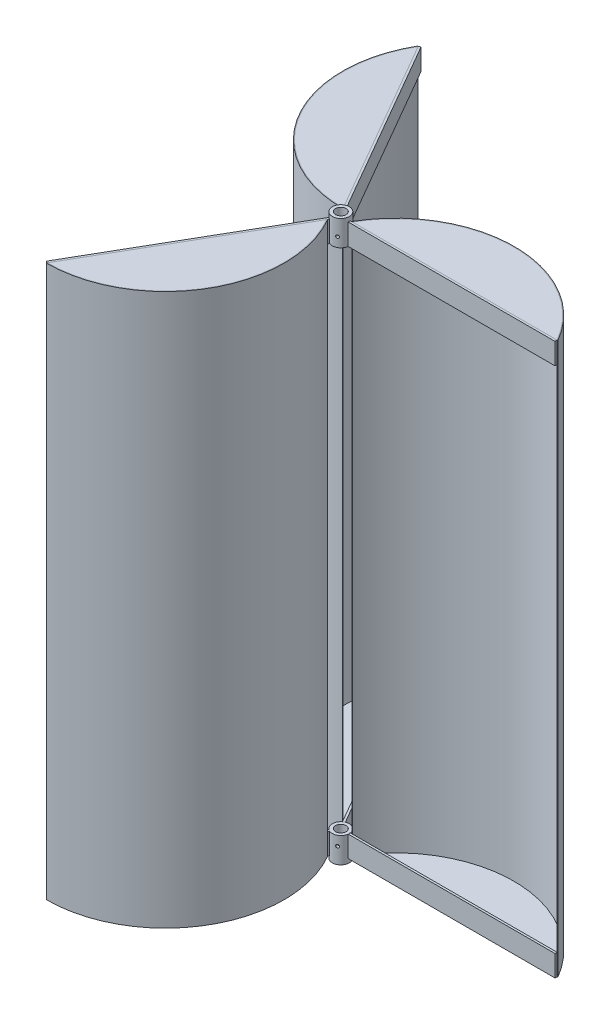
ISO-10303-21;
HEADER;
FILE_DESCRIPTION(('STEP AP214'),'2;1');
FILE_NAME('part.step','',(''),(''),'','','');
FILE_SCHEMA(('AUTOMOTIVE_DESIGN { 1 0 10303 214 1 1 1 1 }'));
ENDSEC;
DATA;
#1=APPLICATION_CONTEXT('core data for automotive mechanical design processes');
#2=APPLICATION_PROTOCOL_DEFINITION('international standard','automotive_design',2000,#1);
#3=PRODUCT_CONTEXT('',#1,'mechanical');
#4=PRODUCT('Part','Part','',(#3));
#5=PRODUCT_RELATED_PRODUCT_CATEGORY('part','',(#4));
#6=PRODUCT_DEFINITION_FORMATION('','',#4);
#7=PRODUCT_DEFINITION_CONTEXT('part definition',#1,'design');
#8=PRODUCT_DEFINITION('design','',#6,#7);
#9=PRODUCT_DEFINITION_SHAPE('','',#8);
#10=(LENGTH_UNIT() NAMED_UNIT(*) SI_UNIT(.MILLI.,.METRE.));
#11=(NAMED_UNIT(*) PLANE_ANGLE_UNIT() SI_UNIT($,.RADIAN.));
#12=(NAMED_UNIT(*) SI_UNIT($,.STERADIAN.) SOLID_ANGLE_UNIT());
#13=UNCERTAINTY_MEASURE_WITH_UNIT(LENGTH_MEASURE(1.E-05),#10,'distance_accuracy_value','');
#14=(GEOMETRIC_REPRESENTATION_CONTEXT(3) GLOBAL_UNCERTAINTY_ASSIGNED_CONTEXT((#13)) GLOBAL_UNIT_ASSIGNED_CONTEXT((#10,
#11,#12)) REPRESENTATION_CONTEXT('',''));
#15=CARTESIAN_POINT('',(0.,0.,0.));
#16=DIRECTION('',(0.,0.,1.));
#17=DIRECTION('',(1.,0.,0.));
#18=AXIS2_PLACEMENT_3D('',#15,#16,#17);
#19=CARTESIAN_POINT('',(-251.584936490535,-1250.,440.757892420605));
#20=DIRECTION('',(-0.499999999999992,0.,0.866025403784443));
#21=DIRECTION('',(0.866025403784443,0.,0.499999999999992));
#22=AXIS2_PLACEMENT_3D('',#19,#20,#21);
#23=PLANE('',#22);
#24=DIRECTION('',(-0.866025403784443,0.,-0.499999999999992));
#25=VECTOR('',#24,1.);
#26=CARTESIAN_POINT('',(-251.584936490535,-1200.,440.757892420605));
#27=LINE('',#26,#25);
#28=CARTESIAN_POINT('',(-251.584936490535,-1200.,440.757892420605));
#29=VERTEX_POINT('',#28);
#30=CARTESIAN_POINT('',(-255.915063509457,-1200.,438.257892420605));
#31=VERTEX_POINT('',#30);
#32=EDGE_CURVE('E115',#29,#31,#27,.T.);
#33=ORIENTED_EDGE('',*,*,#32,.T.);
#34=DIRECTION('',(0.,1.,0.));
#35=VECTOR('',#34,1.);
#36=CARTESIAN_POINT('',(-255.915063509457,-1250.,438.257892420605));
#37=LINE('',#36,#35);
#38=CARTESIAN_POINT('',(-255.915063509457,-1250.,438.257892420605));
#39=VERTEX_POINT('',#38);
#40=EDGE_CURVE('E54',#39,#31,#37,.T.);
#41=ORIENTED_EDGE('',*,*,#40,.F.);
#42=DIRECTION('',(-0.866025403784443,0.,-0.499999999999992));
#43=VECTOR('',#42,1.);
#44=CARTESIAN_POINT('',(-251.584936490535,-1250.,440.757892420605));
#45=LINE('',#44,#43);
#46=CARTESIAN_POINT('',(-251.584936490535,-1250.,440.757892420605));
#47=VERTEX_POINT('',#46);
#48=EDGE_CURVE('E104',#47,#39,#45,.T.);
#49=ORIENTED_EDGE('',*,*,#48,.F.);
#50=DIRECTION('',(0.,1.,0.));
#51=VECTOR('',#50,1.);
#52=CARTESIAN_POINT('',(-251.584936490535,-1250.,440.757892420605));
#53=LINE('',#52,#51);
#54=EDGE_CURVE('E12',#47,#29,#53,.T.);
#55=ORIENTED_EDGE('',*,*,#54,.T.);
#56=EDGE_LOOP('',(#33,#41,#49,#55));
#57=FACE_BOUND('',#56,.T.);
#58=ADVANCED_FACE('F51',(#57),#23,.T.);
#59=CARTESIAN_POINT('',(-7.75650390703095,-1250.,18.4346588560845));
#60=DIRECTION('',(0.866025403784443,0.,0.499999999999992));
#61=DIRECTION('',(0.499999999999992,0.,-0.866025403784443));
#62=AXIS2_PLACEMENT_3D('',#59,#60,#61);
#63=PLANE('',#62);
#64=DIRECTION('',(-0.499999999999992,0.,0.866025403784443));
#65=VECTOR('',#64,1.);
#66=CARTESIAN_POINT('',(-7.75650390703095,-1200.,18.4346588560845));
#67=LINE('',#66,#65);
#68=CARTESIAN_POINT('',(-7.75650390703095,-1200.,18.4346588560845));
#69=VERTEX_POINT('',#68);
#70=EDGE_CURVE('E92',#69,#29,#67,.T.);
#71=ORIENTED_EDGE('',*,*,#70,.T.);
#72=ORIENTED_EDGE('',*,*,#54,.F.);
#73=DIRECTION('',(-0.499999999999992,0.,0.866025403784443));
#74=VECTOR('',#73,1.);
#75=CARTESIAN_POINT('',(-7.75650390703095,-1250.,18.4346588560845));
#76=LINE('',#75,#74);
#77=CARTESIAN_POINT('',(-7.75650390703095,-1250.,18.4346588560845));
#78=VERTEX_POINT('',#77);
#79=EDGE_CURVE('E69',#78,#47,#76,.T.);
#80=ORIENTED_EDGE('',*,*,#79,.F.);
#81=DIRECTION('',(0.,1.,0.));
#82=VECTOR('',#81,1.);
#83=CARTESIAN_POINT('',(-7.75650390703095,-1250.,18.4346588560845));
#84=LINE('',#83,#82);
#85=EDGE_CURVE('E60',#78,#69,#84,.T.);
#86=ORIENTED_EDGE('',*,*,#85,.T.);
#87=EDGE_LOOP('',(#71,#72,#80,#86));
#88=FACE_BOUND('',#87,.T.);
#89=ADVANCED_FACE('F121',(#88),#63,.T.);
#90=CARTESIAN_POINT('',(0.,-1250.,0.));
#91=DIRECTION('',(0.,1.,0.));
#92=DIRECTION('',(0.866025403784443,0.,0.499999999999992));
#93=AXIS2_PLACEMENT_3D('',#90,#91,#92);
#94=CYLINDRICAL_SURFACE('',#93,20.);
#95=CARTESIAN_POINT('',(0.,-1200.,0.));
#96=DIRECTION('',(0.,1.,0.));
#97=DIRECTION('',(0.866025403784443,0.,0.499999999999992));
#98=AXIS2_PLACEMENT_3D('',#95,#96,#97);
#99=CIRCLE('',#98,20.);
#100=CARTESIAN_POINT('',(-12.0866309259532,-1200.,15.9346588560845));
#101=VERTEX_POINT('',#100);
#102=EDGE_CURVE('E86',#101,#69,#99,.T.);
#103=ORIENTED_EDGE('',*,*,#102,.T.);
#104=ORIENTED_EDGE('',*,*,#85,.F.);
#105=CARTESIAN_POINT('',(0.,-1250.,0.));
#106=DIRECTION('',(0.,1.,0.));
#107=DIRECTION('',(0.866025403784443,0.,0.499999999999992));
#108=AXIS2_PLACEMENT_3D('',#105,#106,#107);
#109=CIRCLE('',#108,20.);
#110=CARTESIAN_POINT('',(-12.0866309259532,-1250.,15.9346588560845));
#111=VERTEX_POINT('',#110);
#112=EDGE_CURVE('E102',#111,#78,#109,.T.);
#113=ORIENTED_EDGE('',*,*,#112,.F.);
#114=DIRECTION('',(0.,1.,0.));
#115=VECTOR('',#114,1.);
#116=CARTESIAN_POINT('',(-12.0866309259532,-1250.,15.9346588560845));
#117=LINE('',#116,#115);
#118=EDGE_CURVE('E107',#111,#101,#117,.T.);
#119=ORIENTED_EDGE('',*,*,#118,.T.);
#120=EDGE_LOOP('',(#103,#104,#113,#119));
#121=FACE_BOUND('',#120,.T.);
#122=ADVANCED_FACE('F110',(#121),#94,.F.);
#123=CARTESIAN_POINT('',(-12.0866309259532,-1250.,15.9346588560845));
#124=DIRECTION('',(-0.866025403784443,0.,-0.499999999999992));
#125=DIRECTION('',(-0.499999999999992,0.,0.866025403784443));
#126=AXIS2_PLACEMENT_3D('',#123,#124,#125);
#127=PLANE('',#126);
#128=DIRECTION('',(0.499999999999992,0.,-0.866025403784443));
#129=VECTOR('',#128,1.);
#130=CARTESIAN_POINT('',(-12.0866309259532,-1200.,15.9346588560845));
#131=LINE('',#130,#129);
#132=EDGE_CURVE('E109',#31,#101,#131,.T.);
#133=ORIENTED_EDGE('',*,*,#132,.T.);
#134=ORIENTED_EDGE('',*,*,#118,.F.);
#135=DIRECTION('',(0.499999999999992,0.,-0.866025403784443));
#136=VECTOR('',#135,1.);
#137=CARTESIAN_POINT('',(-12.0866309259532,-1250.,15.9346588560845));
#138=LINE('',#137,#136);
#139=EDGE_CURVE('E99',#39,#111,#138,.T.);
#140=ORIENTED_EDGE('',*,*,#139,.F.);
#141=ORIENTED_EDGE('',*,*,#40,.T.);
#142=EDGE_LOOP('',(#133,#134,#140,#141));
#143=FACE_BOUND('',#142,.T.);
#144=ADVANCED_FACE('F108',(#143),#127,.T.);
#145=CARTESIAN_POINT('',(0.,-1250.,0.));
#146=DIRECTION('',(0.,1.,0.));
#147=DIRECTION('',(0.866025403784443,0.,0.499999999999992));
#148=AXIS2_PLACEMENT_3D('',#145,#146,#147);
#149=PLANE('',#148);
#150=ORIENTED_EDGE('',*,*,#48,.T.);
#151=ORIENTED_EDGE('',*,*,#139,.T.);
#152=ORIENTED_EDGE('',*,*,#112,.T.);
#153=ORIENTED_EDGE('',*,*,#79,.T.);
#154=EDGE_LOOP('',(#150,#151,#152,#153));
#155=FACE_BOUND('',#154,.T.);
#156=ADVANCED_FACE('F100',(#155),#149,.F.);
#157=CARTESIAN_POINT('',(0.,-1200.,0.));
#158=DIRECTION('',(0.,1.,0.));
#159=DIRECTION('',(0.866025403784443,0.,0.499999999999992));
#160=AXIS2_PLACEMENT_3D('',#157,#158,#159);
#161=PLANE('',#160);
#162=ORIENTED_EDGE('',*,*,#32,.F.);
#163=ORIENTED_EDGE('',*,*,#70,.F.);
#164=ORIENTED_EDGE('',*,*,#102,.F.);
#165=ORIENTED_EDGE('',*,*,#132,.F.);
#166=EDGE_LOOP('',(#162,#163,#164,#165));
#167=FACE_BOUND('',#166,.T.);
#168=ADVANCED_FACE('F124',(#167),#161,.T.);
#169=CLOSED_SHELL('',(#58,#89,#122,#144,#156,#168));
#170=MANIFOLD_SOLID_BREP('B2',#169);
#171=CARTESIAN_POINT('',(507.5,-1250.,-2.5));
#172=DIRECTION('',(1.,0.,0.));
#173=DIRECTION('',(0.,0.,-1.));
#174=AXIS2_PLACEMENT_3D('',#171,#172,#173);
#175=PLANE('',#174);
#176=DIRECTION('',(0.,0.,1.));
#177=VECTOR('',#176,1.);
#178=CARTESIAN_POINT('',(507.5,-1200.,-2.5));
#179=LINE('',#178,#177);
#180=CARTESIAN_POINT('',(507.5,-1200.,-2.5));
#181=VERTEX_POINT('',#180);
#182=CARTESIAN_POINT('',(507.5,-1200.,2.5));
#183=VERTEX_POINT('',#182);
#184=EDGE_CURVE('E248',#181,#183,#179,.T.);
#185=ORIENTED_EDGE('',*,*,#184,.T.);
#186=DIRECTION('',(0.,1.,0.));
#187=VECTOR('',#186,1.);
#188=CARTESIAN_POINT('',(507.5,-1250.,2.5));
#189=LINE('',#188,#187);
#190=CARTESIAN_POINT('',(507.5,-1250.,2.5));
#191=VERTEX_POINT('',#190);
#192=EDGE_CURVE('E187',#191,#183,#189,.T.);
#193=ORIENTED_EDGE('',*,*,#192,.F.);
#194=DIRECTION('',(0.,0.,1.));
#195=VECTOR('',#194,1.);
#196=CARTESIAN_POINT('',(507.5,-1250.,-2.5));
#197=LINE('',#196,#195);
#198=CARTESIAN_POINT('',(507.5,-1250.,-2.5));
#199=VERTEX_POINT('',#198);
#200=EDGE_CURVE('E237',#199,#191,#197,.T.);
#201=ORIENTED_EDGE('',*,*,#200,.F.);
#202=DIRECTION('',(0.,1.,0.));
#203=VECTOR('',#202,1.);
#204=CARTESIAN_POINT('',(507.5,-1250.,-2.5));
#205=LINE('',#204,#203);
#206=EDGE_CURVE('E49',#199,#181,#205,.T.);
#207=ORIENTED_EDGE('',*,*,#206,.T.);
#208=EDGE_LOOP('',(#185,#193,#201,#207));
#209=FACE_BOUND('',#208,.T.);
#210=ADVANCED_FACE('F184',(#209),#175,.T.);
#211=CARTESIAN_POINT('',(19.8431348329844,-1250.,-2.5));
#212=DIRECTION('',(0.,0.,-1.));
#213=DIRECTION('',(-1.,0.,0.));
#214=AXIS2_PLACEMENT_3D('',#211,#212,#213);
#215=PLANE('',#214);
#216=DIRECTION('',(1.,0.,0.));
#217=VECTOR('',#216,1.);
#218=CARTESIAN_POINT('',(19.8431348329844,-1200.,-2.5));
#219=LINE('',#218,#217);
#220=CARTESIAN_POINT('',(19.8431348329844,-1200.,-2.5));
#221=VERTEX_POINT('',#220);
#222=EDGE_CURVE('E225',#221,#181,#219,.T.);
#223=ORIENTED_EDGE('',*,*,#222,.T.);
#224=ORIENTED_EDGE('',*,*,#206,.F.);
#225=DIRECTION('',(1.,0.,0.));
#226=VECTOR('',#225,1.);
#227=CARTESIAN_POINT('',(19.8431348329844,-1250.,-2.5));
#228=LINE('',#227,#226);
#229=CARTESIAN_POINT('',(19.8431348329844,-1250.,-2.5));
#230=VERTEX_POINT('',#229);
#231=EDGE_CURVE('E202',#230,#199,#228,.T.);
#232=ORIENTED_EDGE('',*,*,#231,.F.);
#233=DIRECTION('',(0.,1.,0.));
#234=VECTOR('',#233,1.);
#235=CARTESIAN_POINT('',(19.8431348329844,-1250.,-2.5));
#236=LINE('',#235,#234);
#237=EDGE_CURVE('E193',#230,#221,#236,.T.);
#238=ORIENTED_EDGE('',*,*,#237,.T.);
#239=EDGE_LOOP('',(#223,#224,#232,#238));
#240=FACE_BOUND('',#239,.T.);
#241=ADVANCED_FACE('F254',(#240),#215,.T.);
#242=CARTESIAN_POINT('',(0.,-1250.,0.));
#243=DIRECTION('',(0.,1.,0.));
#244=DIRECTION('',(0.,0.,-1.));
#245=AXIS2_PLACEMENT_3D('',#242,#243,#244);
#246=CYLINDRICAL_SURFACE('',#245,20.);
#247=CARTESIAN_POINT('',(0.,-1200.,0.));
#248=DIRECTION('',(0.,1.,0.));
#249=DIRECTION('',(0.,0.,-1.));
#250=AXIS2_PLACEMENT_3D('',#247,#248,#249);
#251=CIRCLE('',#250,20.);
#252=CARTESIAN_POINT('',(19.8431348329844,-1200.,2.5));
#253=VERTEX_POINT('',#252);
#254=EDGE_CURVE('E219',#253,#221,#251,.T.);
#255=ORIENTED_EDGE('',*,*,#254,.T.);
#256=ORIENTED_EDGE('',*,*,#237,.F.);
#257=CARTESIAN_POINT('',(0.,-1250.,0.));
#258=DIRECTION('',(0.,1.,0.));
#259=DIRECTION('',(0.,0.,-1.));
#260=AXIS2_PLACEMENT_3D('',#257,#258,#259);
#261=CIRCLE('',#260,20.);
#262=CARTESIAN_POINT('',(19.8431348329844,-1250.,2.5));
#263=VERTEX_POINT('',#262);
#264=EDGE_CURVE('E235',#263,#230,#261,.T.);
#265=ORIENTED_EDGE('',*,*,#264,.F.);
#266=DIRECTION('',(0.,1.,0.));
#267=VECTOR('',#266,1.);
#268=CARTESIAN_POINT('',(19.8431348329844,-1250.,2.5));
#269=LINE('',#268,#267);
#270=EDGE_CURVE('E240',#263,#253,#269,.T.);
#271=ORIENTED_EDGE('',*,*,#270,.T.);
#272=EDGE_LOOP('',(#255,#256,#265,#271));
#273=FACE_BOUND('',#272,.T.);
#274=ADVANCED_FACE('F243',(#273),#246,.F.);
#275=CARTESIAN_POINT('',(19.8431348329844,-1250.,2.5));
#276=DIRECTION('',(0.,0.,1.));
#277=DIRECTION('',(1.,0.,0.));
#278=AXIS2_PLACEMENT_3D('',#275,#276,#277);
#279=PLANE('',#278);
#280=DIRECTION('',(-1.,0.,0.));
#281=VECTOR('',#280,1.);
#282=CARTESIAN_POINT('',(19.8431348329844,-1200.,2.5));
#283=LINE('',#282,#281);
#284=EDGE_CURVE('E242',#183,#253,#283,.T.);
#285=ORIENTED_EDGE('',*,*,#284,.T.);
#286=ORIENTED_EDGE('',*,*,#270,.F.);
#287=DIRECTION('',(-1.,0.,0.));
#288=VECTOR('',#287,1.);
#289=CARTESIAN_POINT('',(19.8431348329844,-1250.,2.5));
#290=LINE('',#289,#288);
#291=EDGE_CURVE('E232',#191,#263,#290,.T.);
#292=ORIENTED_EDGE('',*,*,#291,.F.);
#293=ORIENTED_EDGE('',*,*,#192,.T.);
#294=EDGE_LOOP('',(#285,#286,#292,#293));
#295=FACE_BOUND('',#294,.T.);
#296=ADVANCED_FACE('F241',(#295),#279,.T.);
#297=CARTESIAN_POINT('',(0.,-1250.,0.));
#298=DIRECTION('',(0.,1.,0.));
#299=DIRECTION('',(0.,0.,-1.));
#300=AXIS2_PLACEMENT_3D('',#297,#298,#299);
#301=PLANE('',#300);
#302=ORIENTED_EDGE('',*,*,#200,.T.);
#303=ORIENTED_EDGE('',*,*,#291,.T.);
#304=ORIENTED_EDGE('',*,*,#264,.T.);
#305=ORIENTED_EDGE('',*,*,#231,.T.);
#306=EDGE_LOOP('',(#302,#303,#304,#305));
#307=FACE_BOUND('',#306,.T.);
#308=ADVANCED_FACE('F233',(#307),#301,.F.);
#309=CARTESIAN_POINT('',(0.,-1200.,0.));
#310=DIRECTION('',(0.,1.,0.));
#311=DIRECTION('',(0.,0.,-1.));
#312=AXIS2_PLACEMENT_3D('',#309,#310,#311);
#313=PLANE('',#312);
#314=ORIENTED_EDGE('',*,*,#184,.F.);
#315=ORIENTED_EDGE('',*,*,#222,.F.);
#316=ORIENTED_EDGE('',*,*,#254,.F.);
#317=ORIENTED_EDGE('',*,*,#284,.F.);
#318=EDGE_LOOP('',(#314,#315,#316,#317));
#319=FACE_BOUND('',#318,.T.);
#320=ADVANCED_FACE('F257',(#319),#313,.T.);
#321=CLOSED_SHELL('',(#210,#241,#274,#296,#308,#320));
#322=MANIFOLD_SOLID_BREP('B6',#321);
#323=CARTESIAN_POINT('',(-14.6403860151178,-1245.,-298.957892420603));
#324=DIRECTION('',(0.,-1.,0.));
#325=DIRECTION('',(0.866025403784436,0.,-0.500000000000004));
#326=AXIS2_PLACEMENT_3D('',#323,#324,#325);
#327=CYLINDRICAL_SURFACE('',#326,278.6);
#328=CARTESIAN_POINT('',(-14.6403860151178,-1250.,-298.957892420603));
#329=DIRECTION('',(0.,1.,0.));
#330=DIRECTION('',(0.866025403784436,0.,-0.500000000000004));
#331=AXIS2_PLACEMENT_3D('',#328,#329,#330);
#332=CIRCLE('',#331,278.6);
#333=CARTESIAN_POINT('',(-255.915063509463,-1250.,-438.257892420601));
#334=VERTEX_POINT('',#333);
#335=CARTESIAN_POINT('',(-14.6403860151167,-1250.,-20.3578924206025));
#336=VERTEX_POINT('',#335);
#337=EDGE_CURVE('E348',#334,#336,#332,.T.);
#338=ORIENTED_EDGE('',*,*,#337,.T.);
#339=DIRECTION('',(0.,-1.,0.));
#340=VECTOR('',#339,1.);
#341=CARTESIAN_POINT('',(-14.6403860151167,-1245.,-20.3578924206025));
#342=LINE('',#341,#340);
#343=CARTESIAN_POINT('',(-14.6403860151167,-1245.,-20.3578924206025));
#344=VERTEX_POINT('',#343);
#345=EDGE_CURVE('E320',#344,#336,#342,.T.);
#346=ORIENTED_EDGE('',*,*,#345,.F.);
#347=CARTESIAN_POINT('',(-14.6403860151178,-1245.,-298.957892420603));
#348=DIRECTION('',(0.,1.,0.));
#349=DIRECTION('',(0.866025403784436,0.,-0.500000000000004));
#350=AXIS2_PLACEMENT_3D('',#347,#348,#349);
#351=CIRCLE('',#350,278.6);
#352=CARTESIAN_POINT('',(-255.915063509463,-1245.,-438.257892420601));
#353=VERTEX_POINT('',#352);
#354=EDGE_CURVE('E347',#353,#344,#351,.T.);
#355=ORIENTED_EDGE('',*,*,#354,.F.);
#356=DIRECTION('',(0.,-1.,0.));
#357=VECTOR('',#356,1.);
#358=CARTESIAN_POINT('',(-255.915063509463,-1245.,-438.257892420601));
#359=LINE('',#358,#357);
#360=EDGE_CURVE('E182',#353,#334,#359,.T.);
#361=ORIENTED_EDGE('',*,*,#360,.T.);
#362=EDGE_LOOP('',(#338,#346,#355,#361));
#363=FACE_BOUND('',#362,.T.);
#364=ADVANCED_FACE('F317',(#363),#327,.T.);
#365=CARTESIAN_POINT('',(-14.6403860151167,-1245.,-20.3578924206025));
#366=DIRECTION('',(0.866025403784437,0.,-0.500000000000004));
#367=DIRECTION('',(-0.500000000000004,0.,-0.866025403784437));
#368=AXIS2_PLACEMENT_3D('',#365,#366,#367);
#369=PLANE('',#368);
#370=DIRECTION('',(-0.500000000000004,0.,-0.866025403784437));
#371=VECTOR('',#370,1.);
#372=CARTESIAN_POINT('',(-14.6403860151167,-1250.,-20.3578924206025));
#373=LINE('',#372,#371);
#374=EDGE_CURVE('E340',#336,#334,#373,.T.);
#375=ORIENTED_EDGE('',*,*,#374,.T.);
#376=ORIENTED_EDGE('',*,*,#360,.F.);
#377=DIRECTION('',(-0.500000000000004,0.,-0.866025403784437));
#378=VECTOR('',#377,1.);
#379=CARTESIAN_POINT('',(-14.6403860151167,-1245.,-20.3578924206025));
#380=LINE('',#379,#378);
#381=EDGE_CURVE('E332',#344,#353,#380,.T.);
#382=ORIENTED_EDGE('',*,*,#381,.F.);
#383=ORIENTED_EDGE('',*,*,#345,.T.);
#384=EDGE_LOOP('',(#375,#376,#382,#383));
#385=FACE_BOUND('',#384,.T.);
#386=ADVANCED_FACE('F343',(#385),#369,.T.);
#387=CARTESIAN_POINT('',(-14.6403860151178,-1245.,-298.957892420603));
#388=DIRECTION('',(0.,-1.,0.));
#389=DIRECTION('',(0.866025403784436,0.,-0.500000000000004));
#390=AXIS2_PLACEMENT_3D('',#387,#388,#389);
#391=PLANE('',#390);
#392=ORIENTED_EDGE('',*,*,#354,.T.);
#393=ORIENTED_EDGE('',*,*,#381,.T.);
#394=EDGE_LOOP('',(#392,#393));
#395=FACE_BOUND('',#394,.T.);
#396=ADVANCED_FACE('F355',(#395),#391,.F.);
#397=CARTESIAN_POINT('',(-14.6403860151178,-1250.,-298.957892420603));
#398=DIRECTION('',(0.,-1.,0.));
#399=DIRECTION('',(0.866025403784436,0.,-0.500000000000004));
#400=AXIS2_PLACEMENT_3D('',#397,#398,#399);
#401=PLANE('',#400);
#402=ORIENTED_EDGE('',*,*,#337,.F.);
#403=ORIENTED_EDGE('',*,*,#374,.F.);
#404=EDGE_LOOP('',(#402,#403));
#405=FACE_BOUND('',#404,.T.);
#406=ADVANCED_FACE('F351',(#405),#401,.T.);
#407=CLOSED_SHELL('',(#364,#386,#396,#406));
#408=MANIFOLD_SOLID_BREP('B43',#407);
#409=CARTESIAN_POINT('',(-255.915063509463,-1250.,-438.257892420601));
#410=DIRECTION('',(-0.500000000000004,0.,-0.866025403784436));
#411=DIRECTION('',(-0.866025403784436,0.,0.500000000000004));
#412=AXIS2_PLACEMENT_3D('',#409,#410,#411);
#413=PLANE('',#412);
#414=DIRECTION('',(0.866025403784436,0.,-0.500000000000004));
#415=VECTOR('',#414,1.);
#416=CARTESIAN_POINT('',(-255.915063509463,-1200.,-438.257892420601));
#417=LINE('',#416,#415);
#418=CARTESIAN_POINT('',(-255.915063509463,-1200.,-438.257892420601));
#419=VERTEX_POINT('',#418);
#420=CARTESIAN_POINT('',(-251.584936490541,-1200.,-440.757892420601));
#421=VERTEX_POINT('',#420);
#422=EDGE_CURVE('E460',#419,#421,#417,.T.);
#423=ORIENTED_EDGE('',*,*,#422,.T.);
#424=DIRECTION('',(0.,1.,0.));
#425=VECTOR('',#424,1.);
#426=CARTESIAN_POINT('',(-251.584936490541,-1250.,-440.757892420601));
#427=LINE('',#426,#425);
#428=CARTESIAN_POINT('',(-251.584936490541,-1250.,-440.757892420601));
#429=VERTEX_POINT('',#428);
#430=EDGE_CURVE('E399',#429,#421,#427,.T.);
#431=ORIENTED_EDGE('',*,*,#430,.F.);
#432=DIRECTION('',(0.866025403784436,0.,-0.500000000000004));
#433=VECTOR('',#432,1.);
#434=CARTESIAN_POINT('',(-255.915063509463,-1250.,-438.257892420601));
#435=LINE('',#434,#433);
#436=CARTESIAN_POINT('',(-255.915063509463,-1250.,-438.257892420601));
#437=VERTEX_POINT('',#436);
#438=EDGE_CURVE('E449',#437,#429,#435,.T.);
#439=ORIENTED_EDGE('',*,*,#438,.F.);
#440=DIRECTION('',(0.,1.,0.));
#441=VECTOR('',#440,1.);
#442=CARTESIAN_POINT('',(-255.915063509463,-1250.,-438.257892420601));
#443=LINE('',#442,#441);
#444=EDGE_CURVE('E315',#437,#419,#443,.T.);
#445=ORIENTED_EDGE('',*,*,#444,.T.);
#446=EDGE_LOOP('',(#423,#431,#439,#445));
#447=FACE_BOUND('',#446,.T.);
#448=ADVANCED_FACE('F396',(#447),#413,.T.);
#449=CARTESIAN_POINT('',(-12.0866309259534,-1250.,-15.9346588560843));
#450=DIRECTION('',(-0.866025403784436,0.,0.500000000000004));
#451=DIRECTION('',(0.500000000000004,0.,0.866025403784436));
#452=AXIS2_PLACEMENT_3D('',#449,#450,#451);
#453=PLANE('',#452);
#454=DIRECTION('',(-0.500000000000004,0.,-0.866025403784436));
#455=VECTOR('',#454,1.);
#456=CARTESIAN_POINT('',(-12.0866309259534,-1200.,-15.9346588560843));
#457=LINE('',#456,#455);
#458=CARTESIAN_POINT('',(-12.0866309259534,-1200.,-15.9346588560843));
#459=VERTEX_POINT('',#458);
#460=EDGE_CURVE('E437',#459,#419,#457,.T.);
#461=ORIENTED_EDGE('',*,*,#460,.T.);
#462=ORIENTED_EDGE('',*,*,#444,.F.);
#463=DIRECTION('',(-0.500000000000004,0.,-0.866025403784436));
#464=VECTOR('',#463,1.);
#465=CARTESIAN_POINT('',(-12.0866309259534,-1250.,-15.9346588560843));
#466=LINE('',#465,#464);
#467=CARTESIAN_POINT('',(-12.0866309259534,-1250.,-15.9346588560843));
#468=VERTEX_POINT('',#467);
#469=EDGE_CURVE('E414',#468,#437,#466,.T.);
#470=ORIENTED_EDGE('',*,*,#469,.F.);
#471=DIRECTION('',(0.,1.,0.));
#472=VECTOR('',#471,1.);
#473=CARTESIAN_POINT('',(-12.0866309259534,-1250.,-15.9346588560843));
#474=LINE('',#473,#472);
#475=EDGE_CURVE('E405',#468,#459,#474,.T.);
#476=ORIENTED_EDGE('',*,*,#475,.T.);
#477=EDGE_LOOP('',(#461,#462,#470,#476));
#478=FACE_BOUND('',#477,.T.);
#479=ADVANCED_FACE('F466',(#478),#453,.T.);
#480=CARTESIAN_POINT('',(0.,-1250.,0.));
#481=DIRECTION('',(0.,1.,0.));
#482=DIRECTION('',(-0.866025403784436,0.,0.500000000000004));
#483=AXIS2_PLACEMENT_3D('',#480,#481,#482);
#484=CYLINDRICAL_SURFACE('',#483,20.);
#485=CARTESIAN_POINT('',(0.,-1200.,0.));
#486=DIRECTION('',(0.,1.,0.));
#487=DIRECTION('',(-0.866025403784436,0.,0.500000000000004));
#488=AXIS2_PLACEMENT_3D('',#485,#486,#487);
#489=CIRCLE('',#488,20.);
#490=CARTESIAN_POINT('',(-7.75650390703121,-1200.,-18.4346588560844));
#491=VERTEX_POINT('',#490);
#492=EDGE_CURVE('E431',#491,#459,#489,.T.);
#493=ORIENTED_EDGE('',*,*,#492,.T.);
#494=ORIENTED_EDGE('',*,*,#475,.F.);
#495=CARTESIAN_POINT('',(0.,-1250.,0.));
#496=DIRECTION('',(0.,1.,0.));
#497=DIRECTION('',(-0.866025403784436,0.,0.500000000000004));
#498=AXIS2_PLACEMENT_3D('',#495,#496,#497);
#499=CIRCLE('',#498,20.);
#500=CARTESIAN_POINT('',(-7.75650390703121,-1250.,-18.4346588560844));
#501=VERTEX_POINT('',#500);
#502=EDGE_CURVE('E447',#501,#468,#499,.T.);
#503=ORIENTED_EDGE('',*,*,#502,.F.);
#504=DIRECTION('',(0.,1.,0.));
#505=VECTOR('',#504,1.);
#506=CARTESIAN_POINT('',(-7.75650390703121,-1250.,-18.4346588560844));
#507=LINE('',#506,#505);
#508=EDGE_CURVE('E452',#501,#491,#507,.T.);
#509=ORIENTED_EDGE('',*,*,#508,.T.);
#510=EDGE_LOOP('',(#493,#494,#503,#509));
#511=FACE_BOUND('',#510,.T.);
#512=ADVANCED_FACE('F455',(#511),#484,.F.);
#513=CARTESIAN_POINT('',(-7.75650390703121,-1250.,-18.4346588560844));
#514=DIRECTION('',(0.866025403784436,0.,-0.500000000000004));
#515=DIRECTION('',(-0.500000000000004,0.,-0.866025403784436));
#516=AXIS2_PLACEMENT_3D('',#513,#514,#515);
#517=PLANE('',#516);
#518=DIRECTION('',(0.500000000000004,0.,0.866025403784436));
#519=VECTOR('',#518,1.);
#520=CARTESIAN_POINT('',(-7.75650390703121,-1200.,-18.4346588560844));
#521=LINE('',#520,#519);
#522=EDGE_CURVE('E454',#421,#491,#521,.T.);
#523=ORIENTED_EDGE('',*,*,#522,.T.);
#524=ORIENTED_EDGE('',*,*,#508,.F.);
#525=DIRECTION('',(0.500000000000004,0.,0.866025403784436));
#526=VECTOR('',#525,1.);
#527=CARTESIAN_POINT('',(-7.75650390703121,-1250.,-18.4346588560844));
#528=LINE('',#527,#526);
#529=EDGE_CURVE('E444',#429,#501,#528,.T.);
#530=ORIENTED_EDGE('',*,*,#529,.F.);
#531=ORIENTED_EDGE('',*,*,#430,.T.);
#532=EDGE_LOOP('',(#523,#524,#530,#531));
#533=FACE_BOUND('',#532,.T.);
#534=ADVANCED_FACE('F453',(#533),#517,.T.);
#535=CARTESIAN_POINT('',(0.,-1250.,0.));
#536=DIRECTION('',(0.,1.,0.));
#537=DIRECTION('',(-0.866025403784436,0.,0.500000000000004));
#538=AXIS2_PLACEMENT_3D('',#535,#536,#537);
#539=PLANE('',#538);
#540=ORIENTED_EDGE('',*,*,#438,.T.);
#541=ORIENTED_EDGE('',*,*,#529,.T.);
#542=ORIENTED_EDGE('',*,*,#502,.T.);
#543=ORIENTED_EDGE('',*,*,#469,.T.);
#544=EDGE_LOOP('',(#540,#541,#542,#543));
#545=FACE_BOUND('',#544,.T.);
#546=ADVANCED_FACE('F445',(#545),#539,.F.);
#547=CARTESIAN_POINT('',(0.,-1200.,0.));
#548=DIRECTION('',(0.,1.,0.));
#549=DIRECTION('',(-0.866025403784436,0.,0.500000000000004));
#550=AXIS2_PLACEMENT_3D('',#547,#548,#549);
#551=PLANE('',#550);
#552=ORIENTED_EDGE('',*,*,#422,.F.);
#553=ORIENTED_EDGE('',*,*,#460,.F.);
#554=ORIENTED_EDGE('',*,*,#492,.F.);
#555=ORIENTED_EDGE('',*,*,#522,.F.);
#556=EDGE_LOOP('',(#552,#553,#554,#555));
#557=FACE_BOUND('',#556,.T.);
#558=ADVANCED_FACE('F469',(#557),#551,.T.);
#559=CLOSED_SHELL('',(#448,#479,#512,#534,#546,#558));
#560=MANIFOLD_SOLID_BREP('B176',#559);
#561=CARTESIAN_POINT('',(0.,-1260.,0.));
#562=DIRECTION('',(0.,-1.,0.));
#563=DIRECTION('',(0.,0.,1.));
#564=AXIS2_PLACEMENT_3D('',#561,#562,#563);
#565=PLANE('',#564);
#566=CARTESIAN_POINT('',(0.,-1260.,0.));
#567=DIRECTION('',(0.,1.,0.));
#568=DIRECTION('',(0.,0.,1.));
#569=AXIS2_PLACEMENT_3D('',#566,#567,#568);
#570=CIRCLE('',#569,20.);
#571=CARTESIAN_POINT('',(0.,-1260.,20.));
#572=VERTEX_POINT('',#571);
#573=EDGE_CURVE('E545',#572,#572,#570,.T.);
#574=ORIENTED_EDGE('',*,*,#573,.F.);
#575=EDGE_LOOP('',(#574));
#576=FACE_BOUND('',#575,.T.);
#577=CARTESIAN_POINT('',(0.,-1260.,0.));
#578=DIRECTION('',(0.,1.,0.));
#579=DIRECTION('',(0.,0.,1.));
#580=AXIS2_PLACEMENT_3D('',#577,#578,#579);
#581=CIRCLE('',#580,12.5);
#582=CARTESIAN_POINT('',(0.,-1260.,12.5));
#583=VERTEX_POINT('',#582);
#584=EDGE_CURVE('E580',#583,#583,#581,.T.);
#585=ORIENTED_EDGE('',*,*,#584,.T.);
#586=EDGE_LOOP('',(#585));
#587=FACE_BOUND('',#586,.T.);
#588=ADVANCED_FACE('F529',(#576,#587),#565,.T.);
#589=CARTESIAN_POINT('',(0.,-1200.,0.));
#590=DIRECTION('',(0.,-1.,0.));
#591=DIRECTION('',(0.,0.,1.));
#592=AXIS2_PLACEMENT_3D('',#589,#590,#591);
#593=PLANE('',#592);
#594=CARTESIAN_POINT('',(0.,-1200.,0.));
#595=DIRECTION('',(0.,1.,0.));
#596=DIRECTION('',(0.,0.,1.));
#597=AXIS2_PLACEMENT_3D('',#594,#595,#596);
#598=CIRCLE('',#597,20.);
#599=CARTESIAN_POINT('',(0.,-1200.,20.));
#600=VERTEX_POINT('',#599);
#601=EDGE_CURVE('E549',#600,#600,#598,.T.);
#602=ORIENTED_EDGE('',*,*,#601,.T.);
#603=EDGE_LOOP('',(#602));
#604=FACE_BOUND('',#603,.T.);
#605=CARTESIAN_POINT('',(0.,-1200.,0.));
#606=DIRECTION('',(0.,1.,0.));
#607=DIRECTION('',(0.,0.,1.));
#608=AXIS2_PLACEMENT_3D('',#605,#606,#607);
#609=CIRCLE('',#608,12.5);
#610=CARTESIAN_POINT('',(0.,-1200.,12.5));
#611=VERTEX_POINT('',#610);
#612=EDGE_CURVE('E575',#611,#611,#609,.T.);
#613=ORIENTED_EDGE('',*,*,#612,.F.);
#614=EDGE_LOOP('',(#613));
#615=FACE_BOUND('',#614,.T.);
#616=ADVANCED_FACE('F587',(#604,#615),#593,.F.);
#617=CARTESIAN_POINT('',(0.,-1260.,0.));
#618=DIRECTION('',(0.,1.,0.));
#619=DIRECTION('',(0.,0.,-1.));
#620=AXIS2_PLACEMENT_3D('',#617,#618,#619);
#621=CYLINDRICAL_SURFACE('',#620,20.);
#622=CARTESIAN_POINT('',(12.7074192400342,-1222.360679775,15.4441411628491));
#623=CARTESIAN_POINT('',(12.7074143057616,-1222.16570510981,15.4441481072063));
#624=CARTESIAN_POINT('',(12.6946083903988,-1221.97062760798,15.4547094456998));
#625=CARTESIAN_POINT('',(12.6436300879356,-1221.58595662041,15.4964403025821));
#626=CARTESIAN_POINT('',(12.6054350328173,-1221.39636819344,15.5276282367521));
#627=CARTESIAN_POINT('',(12.5045229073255,-1221.0282975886,15.6090063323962));
#628=CARTESIAN_POINT('',(12.4418272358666,-1220.84980587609,15.6591799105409));
#629=CARTESIAN_POINT('',(12.2932144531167,-1220.50866746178,15.7761141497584));
#630=CARTESIAN_POINT('',(12.2072996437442,-1220.34601919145,15.8428731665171));
#631=CARTESIAN_POINT('',(12.013033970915,-1220.03940246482,15.9906852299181));
#632=CARTESIAN_POINT('',(11.9044731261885,-1219.89563096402,16.0718709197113));
#633=CARTESIAN_POINT('',(11.6676855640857,-1219.63256169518,16.2445851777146));
#634=CARTESIAN_POINT('',(11.5394576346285,-1219.51326543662,16.3361143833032));
#635=CARTESIAN_POINT('',(11.265225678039,-1219.30178768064,16.5264238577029));
#636=CARTESIAN_POINT('',(11.1191098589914,-1219.2097904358,16.625248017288));
#637=CARTESIAN_POINT('',(10.8132824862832,-1219.05670753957,16.8257634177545));
#638=CARTESIAN_POINT('',(10.6535719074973,-1218.99561967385,16.9274544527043));
#639=CARTESIAN_POINT('',(10.3263949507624,-1218.90669462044,17.1289839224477));
#640=CARTESIAN_POINT('',(10.1590238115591,-1218.87852604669,17.2288306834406));
#641=CARTESIAN_POINT('',(9.81968334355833,-1218.85520790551,17.4244701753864));
#642=CARTESIAN_POINT('',(9.64771435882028,-1218.86005587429,17.5202632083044));
#643=CARTESIAN_POINT('',(9.3060929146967,-1218.90237642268,17.7040635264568));
#644=CARTESIAN_POINT('',(9.13643565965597,-1218.93949229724,17.7921443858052));
#645=CARTESIAN_POINT('',(8.80256746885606,-1219.04473243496,17.9596690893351));
#646=CARTESIAN_POINT('',(8.63835671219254,-1219.11285771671,18.039112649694));
#647=CARTESIAN_POINT('',(8.31954135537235,-1219.27853166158,18.1883588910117));
#648=CARTESIAN_POINT('',(8.16498883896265,-1219.37622560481,18.2581114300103));
#649=CARTESIAN_POINT('',(7.87114906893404,-1219.59815703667,18.3867010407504));
#650=CARTESIAN_POINT('',(7.73186317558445,-1219.72239688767,18.4455371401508));
#651=CARTESIAN_POINT('',(7.47123045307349,-1219.99586698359,18.5526513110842));
#652=CARTESIAN_POINT('',(7.35014835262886,-1220.14540912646,18.6007777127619));
#653=CARTESIAN_POINT('',(7.13227678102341,-1220.46419258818,18.6854042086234));
#654=CARTESIAN_POINT('',(7.0354875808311,-1220.63343412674,18.7219041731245));
#655=CARTESIAN_POINT('',(6.86953851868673,-1220.98718556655,18.7834321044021));
#656=CARTESIAN_POINT('',(6.80041554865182,-1221.17171546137,18.8084447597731));
#657=CARTESIAN_POINT('',(6.69260792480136,-1221.55059570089,18.8470769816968));
#658=CARTESIAN_POINT('',(6.65392029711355,-1221.74494508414,18.8606976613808));
#659=CARTESIAN_POINT('',(6.60880357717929,-1222.13520943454,18.8765538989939));
#660=CARTESIAN_POINT('',(6.60195687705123,-1222.33107018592,18.8789368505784));
#661=CARTESIAN_POINT('',(6.61965435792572,-1222.72118616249,18.8727385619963));
#662=CARTESIAN_POINT('',(6.64419719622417,-1222.915441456,18.8641577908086));
#663=CARTESIAN_POINT('',(6.72342892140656,-1223.29542799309,18.8360620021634));
#664=CARTESIAN_POINT('',(6.77790376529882,-1223.48120973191,18.8166246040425));
#665=CARTESIAN_POINT('',(6.91482728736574,-1223.84058377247,18.7667376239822));
#666=CARTESIAN_POINT('',(6.99727779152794,-1224.01417527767,18.7362873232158));
#667=CARTESIAN_POINT('',(7.18821254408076,-1224.34617508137,18.6638712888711));
#668=CARTESIAN_POINT('',(7.29695194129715,-1224.50441184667,18.6217920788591));
#669=CARTESIAN_POINT('',(7.53632182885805,-1224.79943159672,18.5262090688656));
#670=CARTESIAN_POINT('',(7.66695402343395,-1224.93621290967,18.4727043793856));
#671=CARTESIAN_POINT('',(7.947489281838,-1225.18604615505,18.3537692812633));
#672=CARTESIAN_POINT('',(8.09759722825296,-1225.29880621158,18.288208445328));
#673=CARTESIAN_POINT('',(8.41104872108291,-1225.49534570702,18.1461792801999));
#674=CARTESIAN_POINT('',(8.57439180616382,-1225.57912615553,18.0697113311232));
#675=CARTESIAN_POINT('',(8.90835700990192,-1225.71488065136,17.9074132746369));
#676=CARTESIAN_POINT('',(9.07894089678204,-1225.76700378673,17.8216293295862));
#677=CARTESIAN_POINT('',(9.42282785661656,-1225.83844259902,17.6422192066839));
#678=CARTESIAN_POINT('',(9.59613068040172,-1225.85776126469,17.5485937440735));
#679=CARTESIAN_POINT('',(9.93794261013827,-1225.86294975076,17.3572795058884));
#680=CARTESIAN_POINT('',(10.1064848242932,-1225.84926238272,17.2596616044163));
#681=CARTESIAN_POINT('',(10.4364300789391,-1225.78978977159,17.0621776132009));
#682=CARTESIAN_POINT('',(10.5978331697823,-1225.74400475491,16.9623115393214));
#683=CARTESIAN_POINT('',(10.909072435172,-1225.62181302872,16.7638357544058));
#684=CARTESIAN_POINT('',(11.0589239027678,-1225.54544766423,16.66522453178));
#685=CARTESIAN_POINT('',(11.3437248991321,-1225.36431364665,16.4726892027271));
#686=CARTESIAN_POINT('',(11.4786736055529,-1225.25954342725,16.3787653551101));
#687=CARTESIAN_POINT('',(11.7322849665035,-1225.02302139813,16.1980884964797));
#688=CARTESIAN_POINT('',(11.8507215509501,-1224.8909469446,16.1114404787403));
#689=CARTESIAN_POINT('',(12.066787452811,-1224.60424015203,15.950261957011));
#690=CARTESIAN_POINT('',(12.1644118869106,-1224.44960253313,15.8757342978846));
#691=CARTESIAN_POINT('',(12.3374971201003,-1224.12070440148,15.7416099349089));
#692=CARTESIAN_POINT('',(12.4127768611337,-1223.94629861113,15.6821357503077));
#693=CARTESIAN_POINT('',(12.538485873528,-1223.58384603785,15.5818129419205));
#694=CARTESIAN_POINT('',(12.588939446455,-1223.39581280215,15.5409461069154));
#695=CARTESIAN_POINT('',(12.6533545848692,-1223.06604084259,15.4885046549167));
#696=CARTESIAN_POINT('',(12.6736045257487,-1222.92627469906,15.4719118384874));
#697=CARTESIAN_POINT('',(12.7006385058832,-1222.64458377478,15.4497276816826));
#698=CARTESIAN_POINT('',(12.7074228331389,-1222.50265904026,15.444136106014));
#699=CARTESIAN_POINT('',(12.7074192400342,-1222.360679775,15.4441411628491));
#700=B_SPLINE_CURVE_WITH_KNOTS('',3,(#622,#623,#624,#625,#626,#627,#628,#629,#630,#631,#632,
#633,#634,#635,#636,#637,#638,#639,#640,#641,#642,#643,#644,#645,#646,#647,#648,#649,#650,#651,
#652,#653,#654,#655,#656,#657,#658,#659,#660,#661,#662,#663,#664,#665,#666,#667,#668,#669,#670,
#671,#672,#673,#674,#675,#676,#677,#678,#679,#680,#681,#682,#683,#684,#685,#686,#687,#688,#689,
#690,#691,#692,#693,#694,#695,#696,#697,#698,#699),.UNSPECIFIED.,.T.,.F.,(4,2,2,2,2,2,2,2,2,2,2,
2,2,2,2,2,2,2,2,2,2,2,2,2,2,2,2,2,2,2,2,2,2,2,2,2,2,2,4),(0.,0.584404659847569,1.16933179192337,
1.75374918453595,2.33810865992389,2.92814866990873,3.51822505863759,4.11219797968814,
4.70612834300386,5.29402687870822,5.8818815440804,6.46331923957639,7.04477603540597,
7.62913741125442,8.2135508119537,8.80577741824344,9.3980106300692,9.99103095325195,
10.5839933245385,11.1691563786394,11.7542944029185,12.3353015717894,12.9163466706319,
13.5032750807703,14.0902492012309,14.6839931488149,15.2777164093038,15.8686214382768,
16.4594726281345,17.0424411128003,17.6254054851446,18.2075843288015,18.7897952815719,
19.3793255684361,19.9689940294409,20.5633177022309,21.1570584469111,21.5826271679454,
22.0081867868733),.UNSPECIFIED.);
#701=CARTESIAN_POINT('',(12.7074192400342,-1222.360679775,15.4441411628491));
#702=VERTEX_POINT('',#701);
#703=EDGE_CURVE('E395',#702,#702,#700,.T.);
#704=ORIENTED_EDGE('',*,*,#703,.F.);
#705=EDGE_LOOP('',(#704));
#706=FACE_BOUND('',#705,.T.);
#707=CARTESIAN_POINT('',(-19.7287282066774,-1222.360679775,3.28287729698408));
#708=CARTESIAN_POINT('',(-19.7287317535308,-1222.16570510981,3.28286955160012));
#709=CARTESIAN_POINT('',(-19.7314751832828,-1221.97062760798,3.2664986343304));
#710=CARTESIAN_POINT('',(-19.7421260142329,-1221.58595662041,3.2014847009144));
#711=CARTESIAN_POINT('',(-19.7500380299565,-1221.39636819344,3.15281284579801));
#712=CARTESIAN_POINT('',(-19.77005746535,-1221.0282975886,3.02473133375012));
#713=CARTESIAN_POINT('',(-19.7821612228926,-1220.8498058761,2.94534850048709));
#714=CARTESIAN_POINT('',(-19.8091228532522,-1220.50866746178,2.75817893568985));
#715=CARTESIAN_POINT('',(-19.8239804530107,-1220.34601919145,2.6503950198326));
#716=CARTESIAN_POINT('',(-19.8548566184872,-1220.03940246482,2.40824998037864));
#717=CARTESIAN_POINT('',(-19.8708850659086,-1219.89563096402,2.2736406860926));
#718=CARTESIAN_POINT('',(-19.9020662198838,-1219.63256169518,1.98221951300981));
#719=CARTESIAN_POINT('',(-19.9172188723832,-1219.51326543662,1.82540626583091));
#720=CARTESIAN_POINT('',(-19.9449157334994,-1219.30178768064,1.49275968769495));
#721=CARTESIAN_POINT('',(-19.957442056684,-1219.2097904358,1.31680759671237));
#722=CARTESIAN_POINT('',(-19.9781798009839,-1219.05670753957,0.951695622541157));
#723=CARTESIAN_POINT('',(-19.9863915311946,-1218.99561967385,0.762536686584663));
#724=CARTESIAN_POINT('',(-19.9973326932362,-1218.90669462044,0.378428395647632));
#725=CARTESIAN_POINT('',(-20.0001169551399,-1218.87852604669,0.183557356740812));
#726=CARTESIAN_POINT('',(-19.9998754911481,-1218.85520790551,-0.208139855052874));
#727=CARTESIAN_POINT('',(-19.9968501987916,-1218.86005587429,-0.404965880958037));
#728=CARTESIAN_POINT('',(-19.9852152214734,-1218.90237642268,-0.792718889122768));
#729=CARTESIAN_POINT('',(-19.9766668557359,-1218.93949229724,-0.983686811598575));
#730=CARTESIAN_POINT('',(-19.9548134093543,-1219.04473243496,-1.3565874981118));
#731=CARTESIAN_POINT('',(-19.9415081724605,-1219.11285771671,-1.53851996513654));
#732=CARTESIAN_POINT('',(-19.9113515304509,-1219.27853166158,-1.88924528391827));
#733=CARTESIAN_POINT('',(-19.8944827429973,-1219.37622560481,-2.05796795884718));
#734=CARTESIAN_POINT('',(-19.8589247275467,-1219.59815703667,-2.3767354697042));
#735=CARTESIAN_POINT('',(-19.8402353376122,-1219.72239688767,-2.52677864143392));
#736=CARTESIAN_POINT('',(-19.8026825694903,-1219.99586698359,-2.80605028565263));
#737=CARTESIAN_POINT('',(-19.7838202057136,-1220.14540912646,-2.93497366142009));
#738=CARTESIAN_POINT('',(-19.7481731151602,-1220.46419258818,-3.16596922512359));
#739=CARTESIAN_POINT('',(-19.7313884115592,-1220.63343412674,-3.26804111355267));
#740=CARTESIAN_POINT('',(-19.7016986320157,-1220.98718556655,-3.44252118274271));
#741=CARTESIAN_POINT('',(-19.6887987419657,-1221.17171546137,-3.51488975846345));
#742=CARTESIAN_POINT('',(-19.668351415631,-1221.55059570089,-3.62757001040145));
#743=CARTESIAN_POINT('',(-19.6608034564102,-1221.74494508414,-3.66788481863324));
#744=CARTESIAN_POINT('',(-19.6519770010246,-1222.13520943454,-3.71488516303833));
#745=CARTESIAN_POINT('',(-19.6506173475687,-1222.33107018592,-3.72200605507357));
#746=CARTESIAN_POINT('',(-19.6540982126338,-1222.72118616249,-3.70358044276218));
#747=CARTESIAN_POINT('',(-19.6589384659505,-1222.915441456,-3.67803533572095));
#748=CARTESIAN_POINT('',(-19.6742226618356,-1223.29542799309,-3.59537075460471));
#749=CARTESIAN_POINT('',(-19.6846268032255,-1223.48120973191,-3.53847545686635));
#750=CARTESIAN_POINT('',(-19.7098851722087,-1223.84058377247,-3.39495271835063));
#751=CARTESIAN_POINT('',(-19.7247396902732,-1224.01417527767,-3.30832333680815));
#752=CARTESIAN_POINT('',(-19.7574929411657,-1224.34617508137,-3.10676097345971));
#753=CARTESIAN_POINT('',(-19.7754209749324,-1224.50441184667,-2.99155028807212));
#754=CARTESIAN_POINT('',(-19.8123286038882,-1224.79943159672,-2.7364583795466));
#755=CARTESIAN_POINT('',(-19.831308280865,-1224.93621290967,-2.59657523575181));
#756=CARTESIAN_POINT('',(-19.8685750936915,-1225.18604615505,-2.29415702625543));
#757=CARTESIAN_POINT('',(-19.8868517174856,-1225.29880621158,-2.13137931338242));
#758=CARTESIAN_POINT('',(-19.9205765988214,-1225.49534570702,-1.78890777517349));
#759=CARTESIAN_POINT('',(-19.9360249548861,-1225.57912615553,-1.60921453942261));
#760=CARTESIAN_POINT('',(-19.9624533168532,-1225.71488065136,-1.23884316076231));
#761=CARTESIAN_POINT('',(-19.9734541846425,-1225.76700378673,-1.0482212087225));
#762=CARTESIAN_POINT('',(-19.9900239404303,-1225.83844259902,-0.660701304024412));
#763=CARTESIAN_POINT('',(-19.9955933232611,-1225.85776126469,-0.463803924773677));
#764=CARTESIAN_POINT('',(-20.0008162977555,-1225.86294975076,-0.0721289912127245));
#765=CARTESIAN_POINT('',(-20.000547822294,-1225.84926238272,0.122641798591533));
#766=CARTESIAN_POINT('',(-19.9944942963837,-1225.78978977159,0.507124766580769));
#767=CARTESIAN_POINT('',(-19.9887092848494,-1225.74400475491,0.696836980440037));
#768=CARTESIAN_POINT('',(-19.9724438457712,-1225.62181302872,1.06561598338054));
#769=CARTESIAN_POINT('',(-19.961969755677,-1225.54544766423,1.24469677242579));
#770=CARTESIAN_POINT('',(-19.9376297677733,-1225.36431364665,1.58760933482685));
#771=CARTESIAN_POINT('',(-19.9237636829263,-1225.25954342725,1.75144026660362));
#772=CARTESIAN_POINT('',(-19.8940986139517,-1225.02302139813,2.06141257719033));
#773=CARTESIAN_POINT('',(-19.8782775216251,-1224.8909469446,2.20730567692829));
#774=CARTESIAN_POINT('',(-19.8467257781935,-1224.60424015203,2.47501349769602));
#775=CARTESIAN_POINT('',(-19.8309951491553,-1224.44960253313,2.59682256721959));
#776=CARTESIAN_POINT('',(-19.8013826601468,-1224.12070440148,2.81378095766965));
#777=CARTESIAN_POINT('',(-19.7875163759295,-1223.94629861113,2.90871221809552));
#778=CARTESIAN_POINT('',(-19.7634887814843,-1223.58384603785,3.06774082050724));
#779=CARTESIAN_POINT('',(-19.7533238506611,-1223.39581280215,3.13186831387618));
#780=CARTESIAN_POINT('',(-19.740115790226,-1223.06604084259,3.21387418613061));
#781=CARTESIAN_POINT('',(-19.7358709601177,-1222.92627469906,3.23970755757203));
#782=CARTESIAN_POINT('',(-19.7301759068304,-1222.64458377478,3.27421174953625));
#783=CARTESIAN_POINT('',(-19.728725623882,-1222.50265904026,3.2828829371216));
#784=CARTESIAN_POINT('',(-19.7287282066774,-1222.360679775,3.28287729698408));
#785=B_SPLINE_CURVE_WITH_KNOTS('',3,(#707,#708,#709,#710,#711,#712,#713,#714,#715,#716,#717,
#718,#719,#720,#721,#722,#723,#724,#725,#726,#727,#728,#729,#730,#731,#732,#733,#734,#735,#736,
#737,#738,#739,#740,#741,#742,#743,#744,#745,#746,#747,#748,#749,#750,#751,#752,#753,#754,#755,
#756,#757,#758,#759,#760,#761,#762,#763,#764,#765,#766,#767,#768,#769,#770,#771,#772,#773,#774,
#775,#776,#777,#778,#779,#780,#781,#782,#783,#784),.UNSPECIFIED.,.T.,.F.,(4,2,2,2,2,2,2,2,2,2,2,
2,2,2,2,2,2,2,2,2,2,2,2,2,2,2,2,2,2,2,2,2,2,2,2,2,2,2,4),(0.,0.584404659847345,1.16933179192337,
1.75374918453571,2.33810865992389,2.92814866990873,3.51822505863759,4.11219797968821,
4.70612834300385,5.2940268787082,5.88188154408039,6.46331923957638,7.04477603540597,
7.62913741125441,8.21355081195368,8.80577741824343,9.39801063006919,9.99103095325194,
10.5839933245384,11.1691563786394,11.7542944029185,12.3353015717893,12.9163466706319,
13.5032750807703,14.0902492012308,14.683993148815,15.2777164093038,15.8686214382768,
16.4594726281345,17.0424411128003,17.6254054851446,18.2075843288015,18.7897952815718,
19.3793255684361,19.9689940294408,20.5633177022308,21.1570584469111,21.5826271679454,
22.0081867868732),.UNSPECIFIED.);
#786=CARTESIAN_POINT('',(-19.7287282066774,-1222.360679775,3.28287729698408));
#787=VERTEX_POINT('',#786);
#788=EDGE_CURVE('E541',#787,#787,#785,.T.);
#789=ORIENTED_EDGE('',*,*,#788,.F.);
#790=EDGE_LOOP('',(#789));
#791=FACE_BOUND('',#790,.T.);
#792=ORIENTED_EDGE('',*,*,#573,.T.);
#793=EDGE_LOOP('',(#792));
#794=FACE_BOUND('',#793,.T.);
#795=ORIENTED_EDGE('',*,*,#601,.F.);
#796=EDGE_LOOP('',(#795));
#797=FACE_BOUND('',#796,.T.);
#798=ADVANCED_FACE('F531',(#706,#791,#794,#797),#621,.T.);
#799=CARTESIAN_POINT('',(0.,-1260.,0.));
#800=DIRECTION('',(0.,1.,0.));
#801=DIRECTION('',(0.,0.,-1.));
#802=AXIS2_PLACEMENT_3D('',#799,#800,#801);
#803=CYLINDRICAL_SURFACE('',#802,12.5);
#804=CARTESIAN_POINT('',(8.93534163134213,-1222.360679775,8.74126249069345));
#805=CARTESIAN_POINT('',(8.93533970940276,-1222.16826495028,8.74126692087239));
#806=CARTESIAN_POINT('',(8.92376108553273,-1221.97581073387,8.75314801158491));
#807=CARTESIAN_POINT('',(8.8776539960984,-1221.59648692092,8.79990360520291));
#808=CARTESIAN_POINT('',(8.84311553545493,-1221.40961979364,8.83478812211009));
#809=CARTESIAN_POINT('',(8.75176075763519,-1221.04701350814,8.92528868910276));
#810=CARTESIAN_POINT('',(8.69497795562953,-1220.87125806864,8.98087354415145));
#811=CARTESIAN_POINT('',(8.56001219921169,-1220.53508323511,9.10960225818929));
#812=CARTESIAN_POINT('',(8.48182696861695,-1220.3746654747,9.18274798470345));
#813=CARTESIAN_POINT('',(8.30293719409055,-1220.06929731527,9.34484492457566));
#814=CARTESIAN_POINT('',(8.20171971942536,-1219.92483236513,9.43414478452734));
#815=CARTESIAN_POINT('',(7.97940994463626,-1219.65977452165,9.62290227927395));
#816=CARTESIAN_POINT('',(7.85831540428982,-1219.53918432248,9.72236105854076));
#817=CARTESIAN_POINT('',(7.5958860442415,-1219.32324252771,9.92878813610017));
#818=CARTESIAN_POINT('',(7.45422934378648,-1219.22837833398,10.0358585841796));
#819=CARTESIAN_POINT('',(7.15524083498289,-1219.06976826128,10.2511663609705));
#820=CARTESIAN_POINT('',(6.99791195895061,-1219.00601657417,10.359403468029));
#821=CARTESIAN_POINT('',(6.6755740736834,-1218.9130259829,10.5699014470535));
#822=CARTESIAN_POINT('',(6.51085735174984,-1218.88296017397,10.6722441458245));
#823=CARTESIAN_POINT('',(6.17477924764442,-1218.85558814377,10.8701471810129));
#824=CARTESIAN_POINT('',(6.00341909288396,-1218.85827589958,10.9657087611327));
#825=CARTESIAN_POINT('',(5.6640570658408,-1218.89576291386,11.144696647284));
#826=CARTESIAN_POINT('',(5.49609415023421,-1218.92966800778,11.2283863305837));
#827=CARTESIAN_POINT('',(5.16383192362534,-1219.02717650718,11.3850162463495));
#828=CARTESIAN_POINT('',(4.99953283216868,-1219.09078168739,11.4579558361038));
#829=CARTESIAN_POINT('',(4.67785062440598,-1219.24653876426,11.5930366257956));
#830=CARTESIAN_POINT('',(4.52055969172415,-1219.33898719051,11.6550546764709));
#831=CARTESIAN_POINT('',(4.21957117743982,-1219.54957637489,11.7673728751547));
#832=CARTESIAN_POINT('',(4.07587648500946,-1219.66772257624,11.8176705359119));
#833=CARTESIAN_POINT('',(3.80202508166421,-1219.93105901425,11.9086585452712));
#834=CARTESIAN_POINT('',(3.67248895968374,-1220.07702741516,11.9489673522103));
#835=CARTESIAN_POINT('',(3.43733892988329,-1220.38942758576,12.0187264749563));
#836=CARTESIAN_POINT('',(3.33172680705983,-1220.55586088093,12.0481759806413));
#837=CARTESIAN_POINT('',(3.14789989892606,-1220.90617422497,12.0975159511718));
#838=CARTESIAN_POINT('',(3.06989367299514,-1221.09017428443,12.1173340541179));
#839=CARTESIAN_POINT('',(2.94592050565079,-1221.46936402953,12.148073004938));
#840=CARTESIAN_POINT('',(2.89994467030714,-1221.66455059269,12.1589963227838));
#841=CARTESIAN_POINT('',(2.84324196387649,-1222.05371753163,12.1723786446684));
#842=CARTESIAN_POINT('',(2.83140933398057,-1222.24752782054,12.1751032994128));
#843=CARTESIAN_POINT('',(2.84041229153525,-1222.63433090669,12.1730062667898));
#844=CARTESIAN_POINT('',(2.86124399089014,-1222.82732379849,12.1681854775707));
#845=CARTESIAN_POINT('',(2.93374348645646,-1223.20266662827,12.1509041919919));
#846=CARTESIAN_POINT('',(2.98473096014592,-1223.38515673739,12.1386120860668));
#847=CARTESIAN_POINT('',(3.11474234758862,-1223.73907770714,12.1059012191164));
#848=CARTESIAN_POINT('',(3.193770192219,-1223.9105070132,12.0854813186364));
#849=CARTESIAN_POINT('',(3.37894429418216,-1224.24196760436,12.035037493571));
#850=CARTESIAN_POINT('',(3.48569374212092,-1224.40162838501,12.004795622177));
#851=CARTESIAN_POINT('',(3.7214161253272,-1224.70098501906,11.9338252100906));
#852=CARTESIAN_POINT('',(3.85039368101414,-1224.84067671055,11.8930944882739));
#853=CARTESIAN_POINT('',(4.13073318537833,-1225.10076450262,11.7987107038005));
#854=CARTESIAN_POINT('',(4.28268303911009,-1225.22039272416,11.7446831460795));
#855=CARTESIAN_POINT('',(4.60056131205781,-1225.43128470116,11.6238420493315));
#856=CARTESIAN_POINT('',(4.76648899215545,-1225.52254995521,11.5570291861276));
#857=CARTESIAN_POINT('',(5.10550286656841,-1225.67326183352,11.4112920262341));
#858=CARTESIAN_POINT('',(5.27852376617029,-1225.73294910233,11.3324654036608));
#859=CARTESIAN_POINT('',(5.62718869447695,-1225.8194827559,11.1634327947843));
#860=CARTESIAN_POINT('',(5.80283206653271,-1225.84633722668,11.0732296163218));
#861=CARTESIAN_POINT('',(6.14516551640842,-1225.8658937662,10.8868568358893));
#862=CARTESIAN_POINT('',(6.31195778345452,-1225.85971694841,10.7909909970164));
#863=CARTESIAN_POINT('',(6.63790081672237,-1225.81601912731,10.5936100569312));
#864=CARTESIAN_POINT('',(6.79705192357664,-1225.77849952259,10.4920952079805));
#865=CARTESIAN_POINT('',(7.10235771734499,-1225.67384000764,10.2878569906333));
#866=CARTESIAN_POINT('',(7.24860913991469,-1225.60694803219,10.1851505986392));
#867=CARTESIAN_POINT('',(7.52648313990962,-1225.445663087,9.98157070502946));
#868=CARTESIAN_POINT('',(7.65810350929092,-1225.35126597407,9.88069748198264));
#869=CARTESIAN_POINT('',(7.90793446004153,-1225.13448477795,9.68198341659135));
#870=CARTESIAN_POINT('',(8.02564925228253,-1225.01137251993,9.58431375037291));
#871=CARTESIAN_POINT('',(8.24129759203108,-1224.74200947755,9.39953307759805));
#872=CARTESIAN_POINT('',(8.33922574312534,-1224.59575240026,9.31242495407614));
#873=CARTESIAN_POINT('',(8.51605661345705,-1224.27986790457,9.15103807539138));
#874=CARTESIAN_POINT('',(8.5944241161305,-1224.10974872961,9.07713333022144));
#875=CARTESIAN_POINT('',(8.72762806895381,-1223.75364312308,8.94913938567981));
#876=CARTESIAN_POINT('',(8.78247838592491,-1223.56766611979,8.89503851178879));
#877=CARTESIAN_POINT('',(8.86168703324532,-1223.21237502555,8.81607391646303));
#878=CARTESIAN_POINT('',(8.88927109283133,-1223.04444937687,8.78814767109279));
#879=CARTESIAN_POINT('',(8.92609793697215,-1222.70458584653,8.75074129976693));
#880=CARTESIAN_POINT('',(8.93534334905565,-1222.53264854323,8.74125853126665));
#881=CARTESIAN_POINT('',(8.93534163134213,-1222.360679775,8.74126249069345));
#882=B_SPLINE_CURVE_WITH_KNOTS('',3,(#804,#805,#806,#807,#808,#809,#810,#811,#812,#813,#814,
#815,#816,#817,#818,#819,#820,#821,#822,#823,#824,#825,#826,#827,#828,#829,#830,#831,#832,#833,
#834,#835,#836,#837,#838,#839,#840,#841,#842,#843,#844,#845,#846,#847,#848,#849,#850,#851,#852,
#853,#854,#855,#856,#857,#858,#859,#860,#861,#862,#863,#864,#865,#866,#867,#868,#869,#870,#871,
#872,#873,#874,#875,#876,#877,#878,#879,#880,#881),.UNSPECIFIED.,.T.,.F.,(4,2,2,2,2,2,2,2,2,2,2,
2,2,2,2,2,2,2,2,2,2,2,2,2,2,2,2,2,2,2,2,2,2,2,2,2,2,2,4),(0.,0.576611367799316,1.1534739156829,
1.72947063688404,2.30552864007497,2.89595138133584,3.48644071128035,4.08743969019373,
4.68832643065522,5.27411559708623,5.85979704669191,6.42920767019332,6.99865232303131,
7.57415572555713,8.14978114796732,8.7448340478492,9.33993133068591,9.93943306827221,
10.5387682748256,11.1184628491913,11.6980884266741,12.2651111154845,12.8322133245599,
13.4128741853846,13.9936558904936,14.5931741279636,15.1926606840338,15.7875104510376,
16.382213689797,16.9568630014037,17.5314866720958,18.101350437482,18.6713000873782,
19.2576755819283,19.8442107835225,20.4453695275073,21.0461733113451,21.5615876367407,
22.0769281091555),.UNSPECIFIED.);
#883=CARTESIAN_POINT('',(8.93534163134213,-1222.360679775,8.74126249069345));
#884=VERTEX_POINT('',#883);
#885=EDGE_CURVE('E576',#884,#884,#882,.T.);
#886=ORIENTED_EDGE('',*,*,#885,.T.);
#887=EDGE_LOOP('',(#886));
#888=FACE_BOUND('',#887,.T.);
#889=CARTESIAN_POINT('',(-12.0378261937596,-1222.360679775,3.36760159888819));
#890=CARTESIAN_POINT('',(-12.0378290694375,-1222.16826495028,3.3675977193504));
#891=CARTESIAN_POINT('',(-12.0423290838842,-1221.97581073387,3.35162979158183));
#892=CARTESIAN_POINT('',(-12.0597670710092,-1221.59648692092,3.28832208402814));
#893=CARTESIAN_POINT('',(-12.0727087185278,-1221.40961979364,3.2409686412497));
#894=CARTESIAN_POINT('',(-12.1054071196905,-1221.04701350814,3.11660279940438));
#895=CARTESIAN_POINT('',(-12.1251536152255,-1220.87125806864,3.03963502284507));
#896=CARTESIAN_POINT('',(-12.1691530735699,-1220.53508323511,2.85838689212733));
#897=CARTESIAN_POINT('',(-12.193406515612,-1220.3746654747,2.75410363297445));
#898=CARTESIAN_POINT('',(-12.2443416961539,-1220.06929731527,2.51813207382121));
#899=CARTESIAN_POINT('',(-12.2710689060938,-1219.92483236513,2.38582523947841));
#900=CARTESIAN_POINT('',(-12.3233828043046,-1219.65977452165,2.09892057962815));
#901=CARTESIAN_POINT('',(-12.3489693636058,-1219.53918432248,1.94432024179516));
#902=CARTESIAN_POINT('',(-12.396525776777,-1219.32324252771,1.61383621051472));
#903=CARTESIAN_POINT('',(-12.4184231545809,-1219.22837833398,1.43762268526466));
#904=CARTESIAN_POINT('',(-12.4553909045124,-1219.06976826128,1.0710371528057));
#905=CARTESIAN_POINT('',(-12.470462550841,-1219.00601657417,0.880667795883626));
#906=CARTESIAN_POINT('',(-12.4915902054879,-1218.9130259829,0.496266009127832));
#907=CARTESIAN_POINT('',(-12.4978632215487,-1218.88296017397,0.302445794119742));
#908=CARTESIAN_POINT('',(-12.5012132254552,-1218.85558814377,-0.0875578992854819));
#909=CARTESIAN_POINT('',(-12.4982919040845,-1218.85827589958,-0.28374093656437));
#910=CARTESIAN_POINT('',(-12.4836189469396,-1218.89576291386,-0.667131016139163));
#911=CARTESIAN_POINT('',(-12.4721148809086,-1218.92966800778,-0.854436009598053));
#912=CARTESIAN_POINT('',(-12.4416292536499,-1219.02717650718,-1.22049849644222));
#913=CARTESIAN_POINT('',(-12.4226472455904,-1219.09078168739,-1.39925547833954));
#914=CARTESIAN_POINT('',(-12.3787895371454,-1219.24653876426,-1.74538083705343));
#915=CARTESIAN_POINT('',(-12.3538532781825,-1219.33898719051,-1.9126078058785));
#916=CARTESIAN_POINT('',(-12.3006294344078,-1219.54957637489,-2.22943060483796));
#917=CARTESIAN_POINT('',(-12.2723411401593,-1219.66772257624,-2.37902268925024));
#918=CARTESIAN_POINT('',(-12.2142133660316,-1219.93105901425,-2.66167896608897));
#919=CARTESIAN_POINT('',(-12.1843537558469,-1220.07702741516,-2.79401494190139));
#920=CARTESIAN_POINT('',(-12.1271919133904,-1220.38942758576,-3.0325404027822));
#921=CARTESIAN_POINT('',(-12.0998898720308,-1220.55586088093,-3.13872793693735));
#922=CARTESIAN_POINT('',(-12.0507060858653,-1220.90617422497,-3.32259669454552));
#923=CARTESIAN_POINT('',(-12.0288659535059,-1221.09017428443,-3.40006111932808));
#924=CARTESIAN_POINT('',(-11.9935000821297,-1221.46936402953,-3.52279450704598));
#925=CARTESIAN_POINT('',(-11.9799720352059,-1221.66455059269,-3.56807240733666));
#926=CARTESIAN_POINT('',(-11.9632101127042,-1222.05371753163,-3.62386955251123));
#927=CARTESIAN_POINT('',(-11.9596534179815,-1222.24752782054,-3.63547923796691));
#928=CARTESIAN_POINT('',(-11.9623388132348,-1222.63433090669,-3.62663393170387));
#929=CARTESIAN_POINT('',(-11.9685797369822,-1222.82732379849,-3.60618275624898));
#930=CARTESIAN_POINT('',(-11.9898634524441,-1223.20266662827,-3.5347557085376));
#931=CARTESIAN_POINT('',(-12.0047119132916,-1223.38515673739,-3.48445320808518));
#932=CARTESIAN_POINT('',(-12.0413891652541,-1223.73907770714,-3.35550461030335));
#933=CARTESIAN_POINT('',(-12.0632189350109,-1223.9105070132,-3.27685453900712));
#934=CARTESIAN_POINT('',(-12.1121203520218,-1224.24196760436,-3.09126715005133));
#935=CARTESIAN_POINT('',(-12.1393048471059,-1224.40162838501,-2.98369848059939));
#936=CARTESIAN_POINT('',(-12.1957038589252,-1224.70098501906,-2.74407170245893));
#937=CARTESIAN_POINT('',(-12.224918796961,-1224.84067671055,-2.6120085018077));
#938=CARTESIAN_POINT('',(-12.2833497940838,-1225.10076450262,-2.32203547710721));
#939=CARTESIAN_POINT('',(-12.3125354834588,-1225.22039272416,-2.16342926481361));
#940=CARTESIAN_POINT('',(-12.3668231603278,-1225.43128470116,-1.82771805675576));
#941=CARTESIAN_POINT('',(-12.3919253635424,-1225.52254995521,-1.65061403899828));
#942=CARTESIAN_POINT('',(-12.4352202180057,-1225.67326183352,-1.28415083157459));
#943=CARTESIAN_POINT('',(-12.4534648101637,-1225.73294910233,-1.09489702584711));
#944=CARTESIAN_POINT('',(-12.481410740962,-1225.8194827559,-0.708428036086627));
#945=CARTESIAN_POINT('',(-12.4911141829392,-1225.84633722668,-0.511214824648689));
#946=CARTESIAN_POINT('',(-12.5008773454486,-1225.8658937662,-0.121558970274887));
#947=CARTESIAN_POINT('',(-12.5012512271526,-1225.85971694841,0.0708202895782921));
#948=CARTESIAN_POINT('',(-12.4932858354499,-1225.81601912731,0.45178570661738));
#949=CARTESIAN_POINT('',(-12.4849469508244,-1225.77849952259,0.640372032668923));
#950=CARTESIAN_POINT('',(-12.4607243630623,-1225.67384000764,1.0068937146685));
#951=CARTESIAN_POINT('',(-12.4449037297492,-1225.60694803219,1.18490435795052));
#952=CARTESIAN_POINT('',(-12.4075353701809,-1225.445663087,1.52734024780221));
#953=CARTESIAN_POINT('',(-12.3859867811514,-1225.35126597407,1.69176344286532));
#954=CARTESIAN_POINT('',(-12.3388108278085,-1225.13448477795,2.00748042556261));
#955=CARTESIAN_POINT('',(-12.3130838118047,-1225.01137251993,2.15825925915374));
#956=CARTESIAN_POINT('',(-12.2608832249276,-1224.74200947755,2.43740653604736));
#957=CARTESIAN_POINT('',(-12.2344094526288,-1224.59575240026,2.56576886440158));
#958=CARTESIAN_POINT('',(-12.1830597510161,-1224.27986790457,2.79960232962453));
#959=CARTESIAN_POINT('',(-12.1582401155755,-1224.10974872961,2.90442295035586));
#960=CARTESIAN_POINT('',(-12.1139960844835,-1223.75364312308,3.08377792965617));
#961=CARTESIAN_POINT('',(-12.0945685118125,-1223.56766611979,3.15833013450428));
#962=CARTESIAN_POINT('',(-12.065787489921,-1223.21237502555,3.26640913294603));
#963=CARTESIAN_POINT('',(-12.0553946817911,-1223.04444937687,3.30426075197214));
#964=CARTESIAN_POINT('',(-12.0414132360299,-1222.70458584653,3.35485692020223));
#965=CARTESIAN_POINT('',(-12.0378236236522,-1222.53264854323,3.36760506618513));
#966=CARTESIAN_POINT('',(-12.0378261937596,-1222.360679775,3.36760159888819));
#967=B_SPLINE_CURVE_WITH_KNOTS('',3,(#889,#890,#891,#892,#893,#894,#895,#896,#897,#898,#899,
#900,#901,#902,#903,#904,#905,#906,#907,#908,#909,#910,#911,#912,#913,#914,#915,#916,#917,#918,
#919,#920,#921,#922,#923,#924,#925,#926,#927,#928,#929,#930,#931,#932,#933,#934,#935,#936,#937,
#938,#939,#940,#941,#942,#943,#944,#945,#946,#947,#948,#949,#950,#951,#952,#953,#954,#955,#956,
#957,#958,#959,#960,#961,#962,#963,#964,#965,#966),.UNSPECIFIED.,.T.,.F.,(4,2,2,2,2,2,2,2,2,2,2,
2,2,2,2,2,2,2,2,2,2,2,2,2,2,2,2,2,2,2,2,2,2,2,2,2,2,2,4),(0.,0.576611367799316,1.1534739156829,
1.72947063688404,2.30552864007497,2.89595138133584,3.48644071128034,4.08743969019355,
4.68832643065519,5.27411559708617,5.85979704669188,6.42920767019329,6.99865232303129,
7.5741557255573,8.14978114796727,8.74483404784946,9.33993133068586,9.93943306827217,
10.5387682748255,11.1184628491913,11.698088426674,12.2651111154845,12.8322133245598,
13.4128741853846,13.9936558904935,14.5931741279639,15.1926606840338,15.7875104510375,
16.382213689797,16.9568630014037,17.5314866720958,18.101350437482,18.6713000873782,
19.2576755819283,19.8442107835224,20.4453695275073,21.0461733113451,21.5615876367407,
22.0769281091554),.UNSPECIFIED.);
#968=CARTESIAN_POINT('',(-12.0378261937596,-1222.360679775,3.36760159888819));
#969=VERTEX_POINT('',#968);
#970=EDGE_CURVE('E568',#969,#969,#967,.T.);
#971=ORIENTED_EDGE('',*,*,#970,.T.);
#972=EDGE_LOOP('',(#971));
#973=FACE_BOUND('',#972,.T.);
#974=ORIENTED_EDGE('',*,*,#584,.F.);
#975=EDGE_LOOP('',(#974));
#976=FACE_BOUND('',#975,.T.);
#977=ORIENTED_EDGE('',*,*,#612,.T.);
#978=EDGE_LOOP('',(#977));
#979=FACE_BOUND('',#978,.T.);
#980=ADVANCED_FACE('F561',(#888,#973,#976,#979),#803,.F.);
#981=CARTESIAN_POINT('',(-19.9987865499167,-1222.360679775,-0.220310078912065));
#982=DIRECTION('',(-0.999939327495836,0.,-0.0110155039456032));
#983=DIRECTION('',(-0.0110155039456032,0.,0.999939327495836));
#984=AXIS2_PLACEMENT_3D('',#981,#982,#983);
#985=CYLINDRICAL_SURFACE('',#984,3.5);
#986=ORIENTED_EDGE('',*,*,#970,.F.);
#987=EDGE_LOOP('',(#986));
#988=FACE_BOUND('',#987,.T.);
#989=ORIENTED_EDGE('',*,*,#788,.T.);
#990=EDGE_LOOP('',(#989));
#991=FACE_BOUND('',#990,.T.);
#992=ADVANCED_FACE('F556',(#988,#991),#985,.F.);
#993=CARTESIAN_POINT('',(9.80859914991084,-1222.360679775,17.4296122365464));
#994=DIRECTION('',(0.490429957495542,0.,0.871480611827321));
#995=DIRECTION('',(0.871480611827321,0.,-0.490429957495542));
#996=AXIS2_PLACEMENT_3D('',#993,#994,#995);
#997=CYLINDRICAL_SURFACE('',#996,3.5);
#998=ORIENTED_EDGE('',*,*,#885,.F.);
#999=EDGE_LOOP('',(#998));
#1000=FACE_BOUND('',#999,.T.);
#1001=ORIENTED_EDGE('',*,*,#703,.T.);
#1002=EDGE_LOOP('',(#1001));
#1003=FACE_BOUND('',#1002,.T.);
#1004=ADVANCED_FACE('F560',(#1000,#1003),#997,.F.);
#1005=CLOSED_SHELL('',(#588,#616,#798,#980,#992,#1004));
#1006=MANIFOLD_SOLID_BREP('B309',#1005);
#1007=CARTESIAN_POINT('',(-251.584936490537,-1245.,162.157892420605));
#1008=DIRECTION('',(0.,-1.,0.));
#1009=DIRECTION('',(-0.866025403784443,0.,-0.499999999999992));
#1010=AXIS2_PLACEMENT_3D('',#1007,#1008,#1009);
#1011=CYLINDRICAL_SURFACE('',#1010,278.6);
#1012=CARTESIAN_POINT('',(-251.584936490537,-1250.,162.157892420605));
#1013=DIRECTION('',(0.,1.,0.));
#1014=DIRECTION('',(-0.866025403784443,0.,-0.499999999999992));
#1015=AXIS2_PLACEMENT_3D('',#1012,#1013,#1014);
#1016=CIRCLE('',#1015,278.6);
#1017=CARTESIAN_POINT('',(-251.584936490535,-1250.,440.757892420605));
#1018=VERTEX_POINT('',#1017);
#1019=CARTESIAN_POINT('',(-10.310258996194,-1250.,22.8578924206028));
#1020=VERTEX_POINT('',#1019);
#1021=EDGE_CURVE('E726',#1018,#1020,#1016,.T.);
#1022=ORIENTED_EDGE('',*,*,#1021,.T.);
#1023=DIRECTION('',(0.,-1.,0.));
#1024=VECTOR('',#1023,1.);
#1025=CARTESIAN_POINT('',(-10.310258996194,-1245.,22.8578924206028));
#1026=LINE('',#1025,#1024);
#1027=CARTESIAN_POINT('',(-10.310258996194,-1245.,22.8578924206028));
#1028=VERTEX_POINT('',#1027);
#1029=EDGE_CURVE('E698',#1028,#1020,#1026,.T.);
#1030=ORIENTED_EDGE('',*,*,#1029,.F.);
#1031=CARTESIAN_POINT('',(-251.584936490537,-1245.,162.157892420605));
#1032=DIRECTION('',(0.,1.,0.));
#1033=DIRECTION('',(-0.866025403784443,0.,-0.499999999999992));
#1034=AXIS2_PLACEMENT_3D('',#1031,#1032,#1033);
#1035=CIRCLE('',#1034,278.6);
#1036=CARTESIAN_POINT('',(-251.584936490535,-1245.,440.757892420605));
#1037=VERTEX_POINT('',#1036);
#1038=EDGE_CURVE('E725',#1037,#1028,#1035,.T.);
#1039=ORIENTED_EDGE('',*,*,#1038,.F.);
#1040=DIRECTION('',(0.,-1.,0.));
#1041=VECTOR('',#1040,1.);
#1042=CARTESIAN_POINT('',(-251.584936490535,-1245.,440.757892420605));
#1043=LINE('',#1042,#1041);
#1044=EDGE_CURVE('E527',#1037,#1018,#1043,.T.);
#1045=ORIENTED_EDGE('',*,*,#1044,.T.);
#1046=EDGE_LOOP('',(#1022,#1030,#1039,#1045));
#1047=FACE_BOUND('',#1046,.T.);
#1048=ADVANCED_FACE('F695',(#1047),#1011,.T.);
#1049=CARTESIAN_POINT('',(-10.310258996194,-1245.,22.8578924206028));
#1050=DIRECTION('',(-0.866025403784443,0.,-0.499999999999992));
#1051=DIRECTION('',(-0.499999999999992,0.,0.866025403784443));
#1052=AXIS2_PLACEMENT_3D('',#1049,#1050,#1051);
#1053=PLANE('',#1052);
#1054=DIRECTION('',(-0.499999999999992,0.,0.866025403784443));
#1055=VECTOR('',#1054,1.);
#1056=CARTESIAN_POINT('',(-10.310258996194,-1250.,22.8578924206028));
#1057=LINE('',#1056,#1055);
#1058=EDGE_CURVE('E718',#1020,#1018,#1057,.T.);
#1059=ORIENTED_EDGE('',*,*,#1058,.T.);
#1060=ORIENTED_EDGE('',*,*,#1044,.F.);
#1061=DIRECTION('',(-0.499999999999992,0.,0.866025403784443));
#1062=VECTOR('',#1061,1.);
#1063=CARTESIAN_POINT('',(-10.310258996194,-1245.,22.8578924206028));
#1064=LINE('',#1063,#1062);
#1065=EDGE_CURVE('E710',#1028,#1037,#1064,.T.);
#1066=ORIENTED_EDGE('',*,*,#1065,.F.);
#1067=ORIENTED_EDGE('',*,*,#1029,.T.);
#1068=EDGE_LOOP('',(#1059,#1060,#1066,#1067));
#1069=FACE_BOUND('',#1068,.T.);
#1070=ADVANCED_FACE('F721',(#1069),#1053,.T.);
#1071=CARTESIAN_POINT('',(-251.584936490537,-1245.,162.157892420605));
#1072=DIRECTION('',(0.,-1.,0.));
#1073=DIRECTION('',(-0.866025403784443,0.,-0.499999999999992));
#1074=AXIS2_PLACEMENT_3D('',#1071,#1072,#1073);
#1075=PLANE('',#1074);
#1076=ORIENTED_EDGE('',*,*,#1038,.T.);
#1077=ORIENTED_EDGE('',*,*,#1065,.T.);
#1078=EDGE_LOOP('',(#1076,#1077));
#1079=FACE_BOUND('',#1078,.T.);
#1080=ADVANCED_FACE('F733',(#1079),#1075,.F.);
#1081=CARTESIAN_POINT('',(-251.584936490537,-1250.,162.157892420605));
#1082=DIRECTION('',(0.,-1.,0.));
#1083=DIRECTION('',(-0.866025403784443,0.,-0.499999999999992));
#1084=AXIS2_PLACEMENT_3D('',#1081,#1082,#1083);
#1085=PLANE('',#1084);
#1086=ORIENTED_EDGE('',*,*,#1021,.F.);
#1087=ORIENTED_EDGE('',*,*,#1058,.F.);
#1088=EDGE_LOOP('',(#1086,#1087));
#1089=FACE_BOUND('',#1088,.T.);
#1090=ADVANCED_FACE('F729',(#1089),#1085,.T.);
#1091=CLOSED_SHELL('',(#1048,#1070,#1080,#1090));
#1092=MANIFOLD_SOLID_BREP('B390',#1091);
#1093=CARTESIAN_POINT('',(266.225322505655,-1245.,136.8));
#1094=DIRECTION('',(0.,-1.,0.));
#1095=DIRECTION('',(0.,0.,1.));
#1096=AXIS2_PLACEMENT_3D('',#1093,#1094,#1095);
#1097=CYLINDRICAL_SURFACE('',#1096,278.6);
#1098=CARTESIAN_POINT('',(266.225322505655,-1250.,136.8));
#1099=DIRECTION('',(0.,1.,0.));
#1100=DIRECTION('',(0.,0.,1.));
#1101=AXIS2_PLACEMENT_3D('',#1098,#1099,#1100);
#1102=CIRCLE('',#1101,278.6);
#1103=CARTESIAN_POINT('',(507.5,-1250.,-2.5));
#1104=VERTEX_POINT('',#1103);
#1105=CARTESIAN_POINT('',(24.9506450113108,-1250.,-2.50000000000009));
#1106=VERTEX_POINT('',#1105);
#1107=EDGE_CURVE('E807',#1104,#1106,#1102,.T.);
#1108=ORIENTED_EDGE('',*,*,#1107,.T.);
#1109=DIRECTION('',(0.,-1.,0.));
#1110=VECTOR('',#1109,1.);
#1111=CARTESIAN_POINT('',(24.9506450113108,-1245.,-2.50000000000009));
#1112=LINE('',#1111,#1110);
#1113=CARTESIAN_POINT('',(24.9506450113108,-1245.,-2.50000000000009));
#1114=VERTEX_POINT('',#1113);
#1115=EDGE_CURVE('E779',#1114,#1106,#1112,.T.);
#1116=ORIENTED_EDGE('',*,*,#1115,.F.);
#1117=CARTESIAN_POINT('',(266.225322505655,-1245.,136.8));
#1118=DIRECTION('',(0.,1.,0.));
#1119=DIRECTION('',(0.,0.,1.));
#1120=AXIS2_PLACEMENT_3D('',#1117,#1118,#1119);
#1121=CIRCLE('',#1120,278.6);
#1122=CARTESIAN_POINT('',(507.5,-1245.,-2.5));
#1123=VERTEX_POINT('',#1122);
#1124=EDGE_CURVE('E806',#1123,#1114,#1121,.T.);
#1125=ORIENTED_EDGE('',*,*,#1124,.F.);
#1126=DIRECTION('',(0.,-1.,0.));
#1127=VECTOR('',#1126,1.);
#1128=CARTESIAN_POINT('',(507.5,-1245.,-2.5));
#1129=LINE('',#1128,#1127);
#1130=EDGE_CURVE('E693',#1123,#1104,#1129,.T.);
#1131=ORIENTED_EDGE('',*,*,#1130,.T.);
#1132=EDGE_LOOP('',(#1108,#1116,#1125,#1131));
#1133=FACE_BOUND('',#1132,.T.);
#1134=ADVANCED_FACE('F776',(#1133),#1097,.T.);
#1135=CARTESIAN_POINT('',(24.9506450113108,-1245.,-2.50000000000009));
#1136=DIRECTION('',(0.,0.,1.));
#1137=DIRECTION('',(1.,0.,0.));
#1138=AXIS2_PLACEMENT_3D('',#1135,#1136,#1137);
#1139=PLANE('',#1138);
#1140=DIRECTION('',(1.,0.,0.));
#1141=VECTOR('',#1140,1.);
#1142=CARTESIAN_POINT('',(24.9506450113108,-1250.,-2.50000000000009));
#1143=LINE('',#1142,#1141);
#1144=EDGE_CURVE('E799',#1106,#1104,#1143,.T.);
#1145=ORIENTED_EDGE('',*,*,#1144,.T.);
#1146=ORIENTED_EDGE('',*,*,#1130,.F.);
#1147=DIRECTION('',(1.,0.,0.));
#1148=VECTOR('',#1147,1.);
#1149=CARTESIAN_POINT('',(24.9506450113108,-1245.,-2.50000000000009));
#1150=LINE('',#1149,#1148);
#1151=EDGE_CURVE('E791',#1114,#1123,#1150,.T.);
#1152=ORIENTED_EDGE('',*,*,#1151,.F.);
#1153=ORIENTED_EDGE('',*,*,#1115,.T.);
#1154=EDGE_LOOP('',(#1145,#1146,#1152,#1153));
#1155=FACE_BOUND('',#1154,.T.);
#1156=ADVANCED_FACE('F802',(#1155),#1139,.T.);
#1157=CARTESIAN_POINT('',(266.225322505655,-1245.,136.8));
#1158=DIRECTION('',(0.,-1.,0.));
#1159=DIRECTION('',(0.,0.,1.));
#1160=AXIS2_PLACEMENT_3D('',#1157,#1158,#1159);
#1161=PLANE('',#1160);
#1162=ORIENTED_EDGE('',*,*,#1124,.T.);
#1163=ORIENTED_EDGE('',*,*,#1151,.T.);
#1164=EDGE_LOOP('',(#1162,#1163));
#1165=FACE_BOUND('',#1164,.T.);
#1166=ADVANCED_FACE('F814',(#1165),#1161,.F.);
#1167=CARTESIAN_POINT('',(266.225322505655,-1250.,136.8));
#1168=DIRECTION('',(0.,-1.,0.));
#1169=DIRECTION('',(0.,0.,1.));
#1170=AXIS2_PLACEMENT_3D('',#1167,#1168,#1169);
#1171=PLANE('',#1170);
#1172=ORIENTED_EDGE('',*,*,#1107,.F.);
#1173=ORIENTED_EDGE('',*,*,#1144,.F.);
#1174=EDGE_LOOP('',(#1172,#1173));
#1175=FACE_BOUND('',#1174,.T.);
#1176=ADVANCED_FACE('F810',(#1175),#1171,.T.);
#1177=CLOSED_SHELL('',(#1134,#1156,#1166,#1176));
#1178=MANIFOLD_SOLID_BREP('B521',#1177);
#1179=CARTESIAN_POINT('',(-251.584936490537,45.,162.157892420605));
#1180=DIRECTION('',(0.,1.,0.));
#1181=DIRECTION('',(-0.866025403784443,0.,-0.499999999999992));
#1182=AXIS2_PLACEMENT_3D('',#1179,#1180,#1181);
#1183=CYLINDRICAL_SURFACE('',#1182,278.6);
#1184=CARTESIAN_POINT('',(-251.584936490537,50.,162.157892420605));
#1185=DIRECTION('',(0.,1.,0.));
#1186=DIRECTION('',(-0.866025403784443,0.,-0.499999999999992));
#1187=AXIS2_PLACEMENT_3D('',#1184,#1185,#1186);
#1188=CIRCLE('',#1187,278.6);
#1189=CARTESIAN_POINT('',(-251.584936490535,50.,440.757892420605));
#1190=VERTEX_POINT('',#1189);
#1191=CARTESIAN_POINT('',(-10.310258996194,50.,22.8578924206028));
#1192=VERTEX_POINT('',#1191);
#1193=EDGE_CURVE('E886',#1190,#1192,#1188,.T.);
#1194=ORIENTED_EDGE('',*,*,#1193,.F.);
#1195=DIRECTION('',(0.,1.,0.));
#1196=VECTOR('',#1195,1.);
#1197=CARTESIAN_POINT('',(-251.584936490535,45.,440.757892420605));
#1198=LINE('',#1197,#1196);
#1199=CARTESIAN_POINT('',(-251.584936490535,45.,440.757892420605));
#1200=VERTEX_POINT('',#1199);
#1201=EDGE_CURVE('E774',#1200,#1190,#1198,.T.);
#1202=ORIENTED_EDGE('',*,*,#1201,.F.);
#1203=CARTESIAN_POINT('',(-251.584936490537,45.,162.157892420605));
#1204=DIRECTION('',(0.,1.,0.));
#1205=DIRECTION('',(-0.866025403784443,0.,-0.499999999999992));
#1206=AXIS2_PLACEMENT_3D('',#1203,#1204,#1205);
#1207=CIRCLE('',#1206,278.6);
#1208=CARTESIAN_POINT('',(-10.310258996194,45.,22.8578924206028));
#1209=VERTEX_POINT('',#1208);
#1210=EDGE_CURVE('E890',#1200,#1209,#1207,.T.);
#1211=ORIENTED_EDGE('',*,*,#1210,.T.);
#1212=DIRECTION('',(0.,1.,0.));
#1213=VECTOR('',#1212,1.);
#1214=CARTESIAN_POINT('',(-10.310258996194,45.,22.8578924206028));
#1215=LINE('',#1214,#1213);
#1216=EDGE_CURVE('E860',#1209,#1192,#1215,.T.);
#1217=ORIENTED_EDGE('',*,*,#1216,.T.);
#1218=EDGE_LOOP('',(#1194,#1202,#1211,#1217));
#1219=FACE_BOUND('',#1218,.T.);
#1220=ADVANCED_FACE('F857',(#1219),#1183,.T.);
#1221=CARTESIAN_POINT('',(-10.310258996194,45.,22.8578924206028));
#1222=DIRECTION('',(-0.866025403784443,0.,-0.499999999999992));
#1223=DIRECTION('',(-0.499999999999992,0.,0.866025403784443));
#1224=AXIS2_PLACEMENT_3D('',#1221,#1222,#1223);
#1225=PLANE('',#1224);
#1226=DIRECTION('',(-0.499999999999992,0.,0.866025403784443));
#1227=VECTOR('',#1226,1.);
#1228=CARTESIAN_POINT('',(-10.310258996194,50.,22.8578924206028));
#1229=LINE('',#1228,#1227);
#1230=EDGE_CURVE('E883',#1192,#1190,#1229,.T.);
#1231=ORIENTED_EDGE('',*,*,#1230,.F.);
#1232=ORIENTED_EDGE('',*,*,#1216,.F.);
#1233=DIRECTION('',(-0.499999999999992,0.,0.866025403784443));
#1234=VECTOR('',#1233,1.);
#1235=CARTESIAN_POINT('',(-10.310258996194,45.,22.8578924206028));
#1236=LINE('',#1235,#1234);
#1237=EDGE_CURVE('E885',#1209,#1200,#1236,.T.);
#1238=ORIENTED_EDGE('',*,*,#1237,.T.);
#1239=ORIENTED_EDGE('',*,*,#1201,.T.);
#1240=EDGE_LOOP('',(#1231,#1232,#1238,#1239));
#1241=FACE_BOUND('',#1240,.T.);
#1242=ADVANCED_FACE('F881',(#1241),#1225,.T.);
#1243=CARTESIAN_POINT('',(-251.584936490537,45.,162.157892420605));
#1244=DIRECTION('',(0.,1.,0.));
#1245=DIRECTION('',(-0.866025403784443,0.,-0.499999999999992));
#1246=AXIS2_PLACEMENT_3D('',#1243,#1244,#1245);
#1247=PLANE('',#1246);
#1248=ORIENTED_EDGE('',*,*,#1210,.F.);
#1249=ORIENTED_EDGE('',*,*,#1237,.F.);
#1250=EDGE_LOOP('',(#1248,#1249));
#1251=FACE_BOUND('',#1250,.T.);
#1252=ADVANCED_FACE('F895',(#1251),#1247,.F.);
#1253=CARTESIAN_POINT('',(-251.584936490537,50.,162.157892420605));
#1254=DIRECTION('',(0.,1.,0.));
#1255=DIRECTION('',(-0.866025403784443,0.,-0.499999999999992));
#1256=AXIS2_PLACEMENT_3D('',#1253,#1254,#1255);
#1257=PLANE('',#1256);
#1258=ORIENTED_EDGE('',*,*,#1193,.T.);
#1259=ORIENTED_EDGE('',*,*,#1230,.T.);
#1260=EDGE_LOOP('',(#1258,#1259));
#1261=FACE_BOUND('',#1260,.T.);
#1262=ADVANCED_FACE('F889',(#1261),#1257,.T.);
#1263=CLOSED_SHELL('',(#1220,#1242,#1252,#1262));
#1264=MANIFOLD_SOLID_BREP('B687',#1263);
#1265=CARTESIAN_POINT('',(-14.6403860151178,45.,-298.957892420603));
#1266=DIRECTION('',(0.,1.,0.));
#1267=DIRECTION('',(0.866025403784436,0.,-0.500000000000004));
#1268=AXIS2_PLACEMENT_3D('',#1265,#1266,#1267);
#1269=CYLINDRICAL_SURFACE('',#1268,278.6);
#1270=CARTESIAN_POINT('',(-14.6403860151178,50.,-298.957892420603));
#1271=DIRECTION('',(0.,1.,0.));
#1272=DIRECTION('',(0.866025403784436,0.,-0.500000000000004));
#1273=AXIS2_PLACEMENT_3D('',#1270,#1271,#1272);
#1274=CIRCLE('',#1273,278.6);
#1275=CARTESIAN_POINT('',(-255.915063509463,50.,-438.257892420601));
#1276=VERTEX_POINT('',#1275);
#1277=CARTESIAN_POINT('',(-14.6403860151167,50.,-20.3578924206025));
#1278=VERTEX_POINT('',#1277);
#1279=EDGE_CURVE('E967',#1276,#1278,#1274,.T.);
#1280=ORIENTED_EDGE('',*,*,#1279,.F.);
#1281=DIRECTION('',(0.,1.,0.));
#1282=VECTOR('',#1281,1.);
#1283=CARTESIAN_POINT('',(-255.915063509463,45.,-438.257892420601));
#1284=LINE('',#1283,#1282);
#1285=CARTESIAN_POINT('',(-255.915063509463,45.,-438.257892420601));
#1286=VERTEX_POINT('',#1285);
#1287=EDGE_CURVE('E855',#1286,#1276,#1284,.T.);
#1288=ORIENTED_EDGE('',*,*,#1287,.F.);
#1289=CARTESIAN_POINT('',(-14.6403860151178,45.,-298.957892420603));
#1290=DIRECTION('',(0.,1.,0.));
#1291=DIRECTION('',(0.866025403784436,0.,-0.500000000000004));
#1292=AXIS2_PLACEMENT_3D('',#1289,#1290,#1291);
#1293=CIRCLE('',#1292,278.6);
#1294=CARTESIAN_POINT('',(-14.6403860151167,45.,-20.3578924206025));
#1295=VERTEX_POINT('',#1294);
#1296=EDGE_CURVE('E971',#1286,#1295,#1293,.T.);
#1297=ORIENTED_EDGE('',*,*,#1296,.T.);
#1298=DIRECTION('',(0.,1.,0.));
#1299=VECTOR('',#1298,1.);
#1300=CARTESIAN_POINT('',(-14.6403860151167,45.,-20.3578924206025));
#1301=LINE('',#1300,#1299);
#1302=EDGE_CURVE('E941',#1295,#1278,#1301,.T.);
#1303=ORIENTED_EDGE('',*,*,#1302,.T.);
#1304=EDGE_LOOP('',(#1280,#1288,#1297,#1303));
#1305=FACE_BOUND('',#1304,.T.);
#1306=ADVANCED_FACE('F938',(#1305),#1269,.T.);
#1307=CARTESIAN_POINT('',(-14.6403860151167,45.,-20.3578924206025));
#1308=DIRECTION('',(0.866025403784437,0.,-0.500000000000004));
#1309=DIRECTION('',(-0.500000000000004,0.,-0.866025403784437));
#1310=AXIS2_PLACEMENT_3D('',#1307,#1308,#1309);
#1311=PLANE('',#1310);
#1312=DIRECTION('',(-0.500000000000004,0.,-0.866025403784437));
#1313=VECTOR('',#1312,1.);
#1314=CARTESIAN_POINT('',(-14.6403860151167,50.,-20.3578924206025));
#1315=LINE('',#1314,#1313);
#1316=EDGE_CURVE('E964',#1278,#1276,#1315,.T.);
#1317=ORIENTED_EDGE('',*,*,#1316,.F.);
#1318=ORIENTED_EDGE('',*,*,#1302,.F.);
#1319=DIRECTION('',(-0.500000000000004,0.,-0.866025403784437));
#1320=VECTOR('',#1319,1.);
#1321=CARTESIAN_POINT('',(-14.6403860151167,45.,-20.3578924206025));
#1322=LINE('',#1321,#1320);
#1323=EDGE_CURVE('E966',#1295,#1286,#1322,.T.);
#1324=ORIENTED_EDGE('',*,*,#1323,.T.);
#1325=ORIENTED_EDGE('',*,*,#1287,.T.);
#1326=EDGE_LOOP('',(#1317,#1318,#1324,#1325));
#1327=FACE_BOUND('',#1326,.T.);
#1328=ADVANCED_FACE('F962',(#1327),#1311,.T.);
#1329=CARTESIAN_POINT('',(-14.6403860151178,45.,-298.957892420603));
#1330=DIRECTION('',(0.,1.,0.));
#1331=DIRECTION('',(0.866025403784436,0.,-0.500000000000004));
#1332=AXIS2_PLACEMENT_3D('',#1329,#1330,#1331);
#1333=PLANE('',#1332);
#1334=ORIENTED_EDGE('',*,*,#1296,.F.);
#1335=ORIENTED_EDGE('',*,*,#1323,.F.);
#1336=EDGE_LOOP('',(#1334,#1335));
#1337=FACE_BOUND('',#1336,.T.);
#1338=ADVANCED_FACE('F976',(#1337),#1333,.F.);
#1339=CARTESIAN_POINT('',(-14.6403860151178,50.,-298.957892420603));
#1340=DIRECTION('',(0.,1.,0.));
#1341=DIRECTION('',(0.866025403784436,0.,-0.500000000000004));
#1342=AXIS2_PLACEMENT_3D('',#1339,#1340,#1341);
#1343=PLANE('',#1342);
#1344=ORIENTED_EDGE('',*,*,#1279,.T.);
#1345=ORIENTED_EDGE('',*,*,#1316,.T.);
#1346=EDGE_LOOP('',(#1344,#1345));
#1347=FACE_BOUND('',#1346,.T.);
#1348=ADVANCED_FACE('F970',(#1347),#1343,.T.);
#1349=CLOSED_SHELL('',(#1306,#1328,#1338,#1348));
#1350=MANIFOLD_SOLID_BREP('B768',#1349);
#1351=CARTESIAN_POINT('',(-251.584936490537,-1250.,162.157892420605));
#1352=DIRECTION('',(0.,1.,0.));
#1353=DIRECTION('',(-0.866025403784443,0.,-0.499999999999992));
#1354=AXIS2_PLACEMENT_3D('',#1351,#1352,#1353);
#1355=CYLINDRICAL_SURFACE('',#1354,278.6);
#1356=CARTESIAN_POINT('',(-251.584936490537,50.,162.157892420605));
#1357=DIRECTION('',(0.,-1.,0.));
#1358=DIRECTION('',(-0.866025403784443,0.,-0.499999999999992));
#1359=AXIS2_PLACEMENT_3D('',#1356,#1357,#1358);
#1360=CIRCLE('',#1359,278.6);
#1361=CARTESIAN_POINT('',(-10.310258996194,50.,22.8578924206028));
#1362=VERTEX_POINT('',#1361);
#1363=CARTESIAN_POINT('',(-251.584936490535,50.,440.757892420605));
#1364=VERTEX_POINT('',#1363);
#1365=EDGE_CURVE('E1083',#1362,#1364,#1360,.T.);
#1366=ORIENTED_EDGE('',*,*,#1365,.F.);
#1367=DIRECTION('',(0.,1.,0.));
#1368=VECTOR('',#1367,1.);
#1369=CARTESIAN_POINT('',(-10.310258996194,-1250.,22.8578924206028));
#1370=LINE('',#1369,#1368);
#1371=CARTESIAN_POINT('',(-10.310258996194,-1250.,22.8578924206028));
#1372=VERTEX_POINT('',#1371);
#1373=EDGE_CURVE('E936',#1372,#1362,#1370,.T.);
#1374=ORIENTED_EDGE('',*,*,#1373,.F.);
#1375=CARTESIAN_POINT('',(-251.584936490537,-1250.,162.157892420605));
#1376=DIRECTION('',(0.,-1.,0.));
#1377=DIRECTION('',(-0.866025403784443,0.,-0.499999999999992));
#1378=AXIS2_PLACEMENT_3D('',#1375,#1376,#1377);
#1379=CIRCLE('',#1378,278.6);
#1380=CARTESIAN_POINT('',(-251.584936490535,-1250.,440.757892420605));
#1381=VERTEX_POINT('',#1380);
#1382=EDGE_CURVE('E1077',#1372,#1381,#1379,.T.);
#1383=ORIENTED_EDGE('',*,*,#1382,.T.);
#1384=DIRECTION('',(0.,1.,0.));
#1385=VECTOR('',#1384,1.);
#1386=CARTESIAN_POINT('',(-251.584936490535,-1250.,440.757892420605));
#1387=LINE('',#1386,#1385);
#1388=EDGE_CURVE('E1022',#1381,#1364,#1387,.T.);
#1389=ORIENTED_EDGE('',*,*,#1388,.T.);
#1390=EDGE_LOOP('',(#1366,#1374,#1383,#1389));
#1391=FACE_BOUND('',#1390,.T.);
#1392=ADVANCED_FACE('F1019',(#1391),#1355,.F.);
#1393=CARTESIAN_POINT('',(-9.01122089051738,-1250.,22.1078924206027));
#1394=DIRECTION('',(-0.500000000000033,0.,-0.86602540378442));
#1395=DIRECTION('',(-0.86602540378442,0.,0.500000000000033));
#1396=AXIS2_PLACEMENT_3D('',#1393,#1394,#1395);
#1397=PLANE('',#1396);
#1398=DIRECTION('',(-0.866025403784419,0.,0.500000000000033));
#1399=VECTOR('',#1398,1.);
#1400=CARTESIAN_POINT('',(-9.01122089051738,50.,22.1078924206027));
#1401=LINE('',#1400,#1399);
#1402=CARTESIAN_POINT('',(-9.01122089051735,50.,22.1078924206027));
#1403=VERTEX_POINT('',#1402);
#1404=EDGE_CURVE('E1079',#1403,#1362,#1401,.T.);
#1405=ORIENTED_EDGE('',*,*,#1404,.F.);
#1406=DIRECTION('',(0.,1.,0.));
#1407=VECTOR('',#1406,1.);
#1408=CARTESIAN_POINT('',(-9.01122089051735,-1250.,22.1078924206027));
#1409=LINE('',#1408,#1407);
#1410=CARTESIAN_POINT('',(-9.01122089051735,-1250.,22.1078924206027));
#1411=VERTEX_POINT('',#1410);
#1412=EDGE_CURVE('E1028',#1411,#1403,#1409,.T.);
#1413=ORIENTED_EDGE('',*,*,#1412,.F.);
#1414=DIRECTION('',(-0.866025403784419,0.,0.500000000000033));
#1415=VECTOR('',#1414,1.);
#1416=CARTESIAN_POINT('',(-9.01122089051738,-1250.,22.1078924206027));
#1417=LINE('',#1416,#1415);
#1418=EDGE_CURVE('E1074',#1411,#1372,#1417,.T.);
#1419=ORIENTED_EDGE('',*,*,#1418,.T.);
#1420=ORIENTED_EDGE('',*,*,#1373,.T.);
#1421=EDGE_LOOP('',(#1405,#1413,#1419,#1420));
#1422=FACE_BOUND('',#1421,.T.);
#1423=ADVANCED_FACE('F1093',(#1422),#1397,.T.);
#1424=CARTESIAN_POINT('',(-251.584936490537,-1250.,162.157892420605));
#1425=DIRECTION('',(0.,1.,0.));
#1426=DIRECTION('',(-0.866025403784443,0.,-0.499999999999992));
#1427=AXIS2_PLACEMENT_3D('',#1424,#1425,#1426);
#1428=CYLINDRICAL_SURFACE('',#1427,280.1);
#1429=CARTESIAN_POINT('',(-251.584936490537,50.,162.157892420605));
#1430=DIRECTION('',(0.,1.,0.));
#1431=DIRECTION('',(-0.866025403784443,0.,-0.499999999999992));
#1432=AXIS2_PLACEMENT_3D('',#1429,#1430,#1431);
#1433=CIRCLE('',#1432,280.1);
#1434=CARTESIAN_POINT('',(-251.584936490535,50.,442.257892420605));
#1435=VERTEX_POINT('',#1434);
#1436=EDGE_CURVE('E1069',#1435,#1403,#1433,.T.);
#1437=ORIENTED_EDGE('',*,*,#1436,.F.);
#1438=DIRECTION('',(0.,1.,0.));
#1439=VECTOR('',#1438,1.);
#1440=CARTESIAN_POINT('',(-251.584936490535,-1250.,442.257892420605));
#1441=LINE('',#1440,#1439);
#1442=CARTESIAN_POINT('',(-251.584936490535,-1250.,442.257892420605));
#1443=VERTEX_POINT('',#1442);
#1444=EDGE_CURVE('E1064',#1443,#1435,#1441,.T.);
#1445=ORIENTED_EDGE('',*,*,#1444,.F.);
#1446=CARTESIAN_POINT('',(-251.584936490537,-1250.,162.157892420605));
#1447=DIRECTION('',(0.,1.,0.));
#1448=DIRECTION('',(-0.866025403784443,0.,-0.499999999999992));
#1449=AXIS2_PLACEMENT_3D('',#1446,#1447,#1448);
#1450=CIRCLE('',#1449,280.1);
#1451=EDGE_CURVE('E1067',#1443,#1411,#1450,.T.);
#1452=ORIENTED_EDGE('',*,*,#1451,.T.);
#1453=ORIENTED_EDGE('',*,*,#1412,.T.);
#1454=EDGE_LOOP('',(#1437,#1445,#1452,#1453));
#1455=FACE_BOUND('',#1454,.T.);
#1456=ADVANCED_FACE('F1066',(#1455),#1428,.T.);
#1457=CARTESIAN_POINT('',(-251.584936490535,-1250.,440.757892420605));
#1458=DIRECTION('',(-1.,0.,0.));
#1459=DIRECTION('',(0.,0.,1.));
#1460=AXIS2_PLACEMENT_3D('',#1457,#1458,#1459);
#1461=PLANE('',#1460);
#1462=DIRECTION('',(0.,0.,1.));
#1463=VECTOR('',#1462,1.);
#1464=CARTESIAN_POINT('',(-251.584936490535,50.,440.757892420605));
#1465=LINE('',#1464,#1463);
#1466=EDGE_CURVE('E1086',#1364,#1435,#1465,.T.);
#1467=ORIENTED_EDGE('',*,*,#1466,.F.);
#1468=ORIENTED_EDGE('',*,*,#1388,.F.);
#1469=DIRECTION('',(0.,0.,1.));
#1470=VECTOR('',#1469,1.);
#1471=CARTESIAN_POINT('',(-251.584936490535,-1250.,440.757892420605));
#1472=LINE('',#1471,#1470);
#1473=EDGE_CURVE('E1073',#1381,#1443,#1472,.T.);
#1474=ORIENTED_EDGE('',*,*,#1473,.T.);
#1475=ORIENTED_EDGE('',*,*,#1444,.T.);
#1476=EDGE_LOOP('',(#1467,#1468,#1474,#1475));
#1477=FACE_BOUND('',#1476,.T.);
#1478=ADVANCED_FACE('F1076',(#1477),#1461,.T.);
#1479=CARTESIAN_POINT('',(-251.584936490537,-1250.,162.157892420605));
#1480=DIRECTION('',(0.,1.,0.));
#1481=DIRECTION('',(-0.866025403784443,0.,-0.499999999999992));
#1482=AXIS2_PLACEMENT_3D('',#1479,#1480,#1481);
#1483=PLANE('',#1482);
#1484=ORIENTED_EDGE('',*,*,#1382,.F.);
#1485=ORIENTED_EDGE('',*,*,#1418,.F.);
#1486=ORIENTED_EDGE('',*,*,#1451,.F.);
#1487=ORIENTED_EDGE('',*,*,#1473,.F.);
#1488=EDGE_LOOP('',(#1484,#1485,#1486,#1487));
#1489=FACE_BOUND('',#1488,.T.);
#1490=ADVANCED_FACE('F1072',(#1489),#1483,.F.);
#1491=CARTESIAN_POINT('',(-251.584936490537,50.,162.157892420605));
#1492=DIRECTION('',(0.,1.,0.));
#1493=DIRECTION('',(-0.866025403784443,0.,-0.499999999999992));
#1494=AXIS2_PLACEMENT_3D('',#1491,#1492,#1493);
#1495=PLANE('',#1494);
#1496=ORIENTED_EDGE('',*,*,#1365,.T.);
#1497=ORIENTED_EDGE('',*,*,#1466,.T.);
#1498=ORIENTED_EDGE('',*,*,#1436,.T.);
#1499=ORIENTED_EDGE('',*,*,#1404,.T.);
#1500=EDGE_LOOP('',(#1496,#1497,#1498,#1499));
#1501=FACE_BOUND('',#1500,.T.);
#1502=ADVANCED_FACE('F1092',(#1501),#1495,.T.);
#1503=CLOSED_SHELL('',(#1392,#1423,#1456,#1478,#1490,#1502));
#1504=MANIFOLD_SOLID_BREP('B849',#1503);
#1505=CARTESIAN_POINT('',(-14.6403860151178,-1250.,-298.957892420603));
#1506=DIRECTION('',(0.,1.,0.));
#1507=DIRECTION('',(0.866025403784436,0.,-0.500000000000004));
#1508=AXIS2_PLACEMENT_3D('',#1505,#1506,#1507);
#1509=CYLINDRICAL_SURFACE('',#1508,278.6);
#1510=CARTESIAN_POINT('',(-14.6403860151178,50.,-298.957892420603));
#1511=DIRECTION('',(0.,-1.,0.));
#1512=DIRECTION('',(0.866025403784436,0.,-0.500000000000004));
#1513=AXIS2_PLACEMENT_3D('',#1510,#1511,#1512);
#1514=CIRCLE('',#1513,278.6);
#1515=CARTESIAN_POINT('',(-14.6403860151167,50.,-20.3578924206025));
#1516=VERTEX_POINT('',#1515);
#1517=CARTESIAN_POINT('',(-255.915063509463,50.,-438.257892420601));
#1518=VERTEX_POINT('',#1517);
#1519=EDGE_CURVE('E1216',#1516,#1518,#1514,.T.);
#1520=ORIENTED_EDGE('',*,*,#1519,.F.);
#1521=DIRECTION('',(0.,1.,0.));
#1522=VECTOR('',#1521,1.);
#1523=CARTESIAN_POINT('',(-14.6403860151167,-1250.,-20.3578924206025));
#1524=LINE('',#1523,#1522);
#1525=CARTESIAN_POINT('',(-14.6403860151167,-1250.,-20.3578924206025));
#1526=VERTEX_POINT('',#1525);
#1527=EDGE_CURVE('E1017',#1526,#1516,#1524,.T.);
#1528=ORIENTED_EDGE('',*,*,#1527,.F.);
#1529=CARTESIAN_POINT('',(-14.6403860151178,-1250.,-298.957892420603));
#1530=DIRECTION('',(0.,-1.,0.));
#1531=DIRECTION('',(0.866025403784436,0.,-0.500000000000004));
#1532=AXIS2_PLACEMENT_3D('',#1529,#1530,#1531);
#1533=CIRCLE('',#1532,278.6);
#1534=CARTESIAN_POINT('',(-255.915063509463,-1250.,-438.257892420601));
#1535=VERTEX_POINT('',#1534);
#1536=EDGE_CURVE('E1210',#1526,#1535,#1533,.T.);
#1537=ORIENTED_EDGE('',*,*,#1536,.T.);
#1538=DIRECTION('',(0.,1.,0.));
#1539=VECTOR('',#1538,1.);
#1540=CARTESIAN_POINT('',(-255.915063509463,-1250.,-438.257892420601));
#1541=LINE('',#1540,#1539);
#1542=EDGE_CURVE('E1155',#1535,#1518,#1541,.T.);
#1543=ORIENTED_EDGE('',*,*,#1542,.T.);
#1544=EDGE_LOOP('',(#1520,#1528,#1537,#1543));
#1545=FACE_BOUND('',#1544,.T.);
#1546=ADVANCED_FACE('F1152',(#1545),#1509,.F.);
#1547=CARTESIAN_POINT('',(-14.6403860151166,-1250.,-18.8578924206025));
#1548=DIRECTION('',(1.,0.,0.));
#1549=DIRECTION('',(0.,0.,-1.));
#1550=AXIS2_PLACEMENT_3D('',#1547,#1548,#1549);
#1551=PLANE('',#1550);
#1552=DIRECTION('',(0.,0.,-1.));
#1553=VECTOR('',#1552,1.);
#1554=CARTESIAN_POINT('',(-14.6403860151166,50.,-18.8578924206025));
#1555=LINE('',#1554,#1553);
#1556=CARTESIAN_POINT('',(-14.6403860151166,50.,-18.8578924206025));
#1557=VERTEX_POINT('',#1556);
#1558=EDGE_CURVE('E1212',#1557,#1516,#1555,.T.);
#1559=ORIENTED_EDGE('',*,*,#1558,.F.);
#1560=DIRECTION('',(0.,1.,0.));
#1561=VECTOR('',#1560,1.);
#1562=CARTESIAN_POINT('',(-14.6403860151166,-1250.,-18.8578924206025));
#1563=LINE('',#1562,#1561);
#1564=CARTESIAN_POINT('',(-14.6403860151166,-1250.,-18.8578924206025));
#1565=VERTEX_POINT('',#1564);
#1566=EDGE_CURVE('E1161',#1565,#1557,#1563,.T.);
#1567=ORIENTED_EDGE('',*,*,#1566,.F.);
#1568=DIRECTION('',(0.,0.,-1.));
#1569=VECTOR('',#1568,1.);
#1570=CARTESIAN_POINT('',(-14.6403860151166,-1250.,-18.8578924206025));
#1571=LINE('',#1570,#1569);
#1572=EDGE_CURVE('E1207',#1565,#1526,#1571,.T.);
#1573=ORIENTED_EDGE('',*,*,#1572,.T.);
#1574=ORIENTED_EDGE('',*,*,#1527,.T.);
#1575=EDGE_LOOP('',(#1559,#1567,#1573,#1574));
#1576=FACE_BOUND('',#1575,.T.);
#1577=ADVANCED_FACE('F1226',(#1576),#1551,.T.);
#1578=CARTESIAN_POINT('',(-14.6403860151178,-1250.,-298.957892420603));
#1579=DIRECTION('',(0.,1.,0.));
#1580=DIRECTION('',(0.866025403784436,0.,-0.500000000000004));
#1581=AXIS2_PLACEMENT_3D('',#1578,#1579,#1580);
#1582=CYLINDRICAL_SURFACE('',#1581,280.1);
#1583=CARTESIAN_POINT('',(-14.6403860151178,50.,-298.957892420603));
#1584=DIRECTION('',(0.,1.,0.));
#1585=DIRECTION('',(0.866025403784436,0.,-0.500000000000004));
#1586=AXIS2_PLACEMENT_3D('',#1583,#1584,#1585);
#1587=CIRCLE('',#1586,280.1);
#1588=CARTESIAN_POINT('',(-257.21410161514,50.,-439.007892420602));
#1589=VERTEX_POINT('',#1588);
#1590=EDGE_CURVE('E1202',#1589,#1557,#1587,.T.);
#1591=ORIENTED_EDGE('',*,*,#1590,.F.);
#1592=DIRECTION('',(0.,1.,0.));
#1593=VECTOR('',#1592,1.);
#1594=CARTESIAN_POINT('',(-257.21410161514,-1250.,-439.007892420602));
#1595=LINE('',#1594,#1593);
#1596=CARTESIAN_POINT('',(-257.21410161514,-1250.,-439.007892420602));
#1597=VERTEX_POINT('',#1596);
#1598=EDGE_CURVE('E1197',#1597,#1589,#1595,.T.);
#1599=ORIENTED_EDGE('',*,*,#1598,.F.);
#1600=CARTESIAN_POINT('',(-14.6403860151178,-1250.,-298.957892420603));
#1601=DIRECTION('',(0.,1.,0.));
#1602=DIRECTION('',(0.866025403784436,0.,-0.500000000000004));
#1603=AXIS2_PLACEMENT_3D('',#1600,#1601,#1602);
#1604=CIRCLE('',#1603,280.1);
#1605=EDGE_CURVE('E1200',#1597,#1565,#1604,.T.);
#1606=ORIENTED_EDGE('',*,*,#1605,.T.);
#1607=ORIENTED_EDGE('',*,*,#1566,.T.);
#1608=EDGE_LOOP('',(#1591,#1599,#1606,#1607));
#1609=FACE_BOUND('',#1608,.T.);
#1610=ADVANCED_FACE('F1199',(#1609),#1582,.T.);
#1611=CARTESIAN_POINT('',(-255.915063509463,-1250.,-438.257892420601));
#1612=DIRECTION('',(0.499999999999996,0.,-0.866025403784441));
#1613=DIRECTION('',(-0.866025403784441,0.,-0.499999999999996));
#1614=AXIS2_PLACEMENT_3D('',#1611,#1612,#1613);
#1615=PLANE('',#1614);
#1616=DIRECTION('',(-0.866025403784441,0.,-0.499999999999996));
#1617=VECTOR('',#1616,1.);
#1618=CARTESIAN_POINT('',(-255.915063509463,50.,-438.257892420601));
#1619=LINE('',#1618,#1617);
#1620=EDGE_CURVE('E1219',#1518,#1589,#1619,.T.);
#1621=ORIENTED_EDGE('',*,*,#1620,.F.);
#1622=ORIENTED_EDGE('',*,*,#1542,.F.);
#1623=DIRECTION('',(-0.866025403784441,0.,-0.499999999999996));
#1624=VECTOR('',#1623,1.);
#1625=CARTESIAN_POINT('',(-255.915063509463,-1250.,-438.257892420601));
#1626=LINE('',#1625,#1624);
#1627=EDGE_CURVE('E1206',#1535,#1597,#1626,.T.);
#1628=ORIENTED_EDGE('',*,*,#1627,.T.);
#1629=ORIENTED_EDGE('',*,*,#1598,.T.);
#1630=EDGE_LOOP('',(#1621,#1622,#1628,#1629));
#1631=FACE_BOUND('',#1630,.T.);
#1632=ADVANCED_FACE('F1209',(#1631),#1615,.T.);
#1633=CARTESIAN_POINT('',(-14.6403860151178,-1250.,-298.957892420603));
#1634=DIRECTION('',(0.,1.,0.));
#1635=DIRECTION('',(0.866025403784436,0.,-0.500000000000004));
#1636=AXIS2_PLACEMENT_3D('',#1633,#1634,#1635);
#1637=PLANE('',#1636);
#1638=ORIENTED_EDGE('',*,*,#1536,.F.);
#1639=ORIENTED_EDGE('',*,*,#1572,.F.);
#1640=ORIENTED_EDGE('',*,*,#1605,.F.);
#1641=ORIENTED_EDGE('',*,*,#1627,.F.);
#1642=EDGE_LOOP('',(#1638,#1639,#1640,#1641));
#1643=FACE_BOUND('',#1642,.T.);
#1644=ADVANCED_FACE('F1205',(#1643),#1637,.F.);
#1645=CARTESIAN_POINT('',(-14.6403860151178,50.,-298.957892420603));
#1646=DIRECTION('',(0.,1.,0.));
#1647=DIRECTION('',(0.866025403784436,0.,-0.500000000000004));
#1648=AXIS2_PLACEMENT_3D('',#1645,#1646,#1647);
#1649=PLANE('',#1648);
#1650=ORIENTED_EDGE('',*,*,#1519,.T.);
#1651=ORIENTED_EDGE('',*,*,#1620,.T.);
#1652=ORIENTED_EDGE('',*,*,#1590,.T.);
#1653=ORIENTED_EDGE('',*,*,#1558,.T.);
#1654=EDGE_LOOP('',(#1650,#1651,#1652,#1653));
#1655=FACE_BOUND('',#1654,.T.);
#1656=ADVANCED_FACE('F1225',(#1655),#1649,.T.);
#1657=CLOSED_SHELL('',(#1546,#1577,#1610,#1632,#1644,#1656));
#1658=MANIFOLD_SOLID_BREP('B930',#1657);
#1659=CARTESIAN_POINT('',(266.225322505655,-1250.,136.8));
#1660=DIRECTION('',(0.,1.,0.));
#1661=DIRECTION('',(0.,0.,1.));
#1662=AXIS2_PLACEMENT_3D('',#1659,#1660,#1661);
#1663=CYLINDRICAL_SURFACE('',#1662,278.6);
#1664=CARTESIAN_POINT('',(266.225322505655,50.,136.8));
#1665=DIRECTION('',(0.,-1.,0.));
#1666=DIRECTION('',(0.,0.,1.));
#1667=AXIS2_PLACEMENT_3D('',#1664,#1665,#1666);
#1668=CIRCLE('',#1667,278.6);
#1669=CARTESIAN_POINT('',(24.9506450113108,50.,-2.50000000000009));
#1670=VERTEX_POINT('',#1669);
#1671=CARTESIAN_POINT('',(507.5,50.,-2.5));
#1672=VERTEX_POINT('',#1671);
#1673=EDGE_CURVE('E1349',#1670,#1672,#1668,.T.);
#1674=ORIENTED_EDGE('',*,*,#1673,.F.);
#1675=DIRECTION('',(0.,1.,0.));
#1676=VECTOR('',#1675,1.);
#1677=CARTESIAN_POINT('',(24.9506450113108,-1250.,-2.50000000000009));
#1678=LINE('',#1677,#1676);
#1679=CARTESIAN_POINT('',(24.9506450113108,-1250.,-2.50000000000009));
#1680=VERTEX_POINT('',#1679);
#1681=EDGE_CURVE('E1150',#1680,#1670,#1678,.T.);
#1682=ORIENTED_EDGE('',*,*,#1681,.F.);
#1683=CARTESIAN_POINT('',(266.225322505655,-1250.,136.8));
#1684=DIRECTION('',(0.,-1.,0.));
#1685=DIRECTION('',(0.,0.,1.));
#1686=AXIS2_PLACEMENT_3D('',#1683,#1684,#1685);
#1687=CIRCLE('',#1686,278.6);
#1688=CARTESIAN_POINT('',(507.5,-1250.,-2.5));
#1689=VERTEX_POINT('',#1688);
#1690=EDGE_CURVE('E1343',#1680,#1689,#1687,.T.);
#1691=ORIENTED_EDGE('',*,*,#1690,.T.);
#1692=DIRECTION('',(0.,1.,0.));
#1693=VECTOR('',#1692,1.);
#1694=CARTESIAN_POINT('',(507.5,-1250.,-2.5));
#1695=LINE('',#1694,#1693);
#1696=EDGE_CURVE('E1288',#1689,#1672,#1695,.T.);
#1697=ORIENTED_EDGE('',*,*,#1696,.T.);
#1698=EDGE_LOOP('',(#1674,#1682,#1691,#1697));
#1699=FACE_BOUND('',#1698,.T.);
#1700=ADVANCED_FACE('F1285',(#1699),#1663,.F.);
#1701=CARTESIAN_POINT('',(23.6516069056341,-1250.,-3.25000000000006));
#1702=DIRECTION('',(-0.499999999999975,0.,0.866025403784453));
#1703=DIRECTION('',(0.866025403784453,0.,0.499999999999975));
#1704=AXIS2_PLACEMENT_3D('',#1701,#1702,#1703);
#1705=PLANE('',#1704);
#1706=DIRECTION('',(0.866025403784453,0.,0.499999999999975));
#1707=VECTOR('',#1706,1.);
#1708=CARTESIAN_POINT('',(23.6516069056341,50.,-3.25000000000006));
#1709=LINE('',#1708,#1707);
#1710=CARTESIAN_POINT('',(23.6516069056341,50.,-3.25000000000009));
#1711=VERTEX_POINT('',#1710);
#1712=EDGE_CURVE('E1345',#1711,#1670,#1709,.T.);
#1713=ORIENTED_EDGE('',*,*,#1712,.F.);
#1714=DIRECTION('',(0.,1.,0.));
#1715=VECTOR('',#1714,1.);
#1716=CARTESIAN_POINT('',(23.6516069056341,-1250.,-3.25000000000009));
#1717=LINE('',#1716,#1715);
#1718=CARTESIAN_POINT('',(23.6516069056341,-1250.,-3.25000000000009));
#1719=VERTEX_POINT('',#1718);
#1720=EDGE_CURVE('E1294',#1719,#1711,#1717,.T.);
#1721=ORIENTED_EDGE('',*,*,#1720,.F.);
#1722=DIRECTION('',(0.866025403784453,0.,0.499999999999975));
#1723=VECTOR('',#1722,1.);
#1724=CARTESIAN_POINT('',(23.6516069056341,-1250.,-3.25000000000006));
#1725=LINE('',#1724,#1723);
#1726=EDGE_CURVE('E1340',#1719,#1680,#1725,.T.);
#1727=ORIENTED_EDGE('',*,*,#1726,.T.);
#1728=ORIENTED_EDGE('',*,*,#1681,.T.);
#1729=EDGE_LOOP('',(#1713,#1721,#1727,#1728));
#1730=FACE_BOUND('',#1729,.T.);
#1731=ADVANCED_FACE('F1359',(#1730),#1705,.T.);
#1732=CARTESIAN_POINT('',(266.225322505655,-1250.,136.8));
#1733=DIRECTION('',(0.,1.,0.));
#1734=DIRECTION('',(0.,0.,1.));
#1735=AXIS2_PLACEMENT_3D('',#1732,#1733,#1734);
#1736=CYLINDRICAL_SURFACE('',#1735,280.1);
#1737=CARTESIAN_POINT('',(266.225322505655,50.,136.8));
#1738=DIRECTION('',(0.,1.,0.));
#1739=DIRECTION('',(0.,0.,1.));
#1740=AXIS2_PLACEMENT_3D('',#1737,#1738,#1739);
#1741=CIRCLE('',#1740,280.1);
#1742=CARTESIAN_POINT('',(508.799038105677,50.,-3.25));
#1743=VERTEX_POINT('',#1742);
#1744=EDGE_CURVE('E1335',#1743,#1711,#1741,.T.);
#1745=ORIENTED_EDGE('',*,*,#1744,.F.);
#1746=DIRECTION('',(0.,1.,0.));
#1747=VECTOR('',#1746,1.);
#1748=CARTESIAN_POINT('',(508.799038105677,-1250.,-3.25));
#1749=LINE('',#1748,#1747);
#1750=CARTESIAN_POINT('',(508.799038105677,-1250.,-3.25));
#1751=VERTEX_POINT('',#1750);
#1752=EDGE_CURVE('E1330',#1751,#1743,#1749,.T.);
#1753=ORIENTED_EDGE('',*,*,#1752,.F.);
#1754=CARTESIAN_POINT('',(266.225322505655,-1250.,136.8));
#1755=DIRECTION('',(0.,1.,0.));
#1756=DIRECTION('',(0.,0.,1.));
#1757=AXIS2_PLACEMENT_3D('',#1754,#1755,#1756);
#1758=CIRCLE('',#1757,280.1);
#1759=EDGE_CURVE('E1333',#1751,#1719,#1758,.T.);
#1760=ORIENTED_EDGE('',*,*,#1759,.T.);
#1761=ORIENTED_EDGE('',*,*,#1720,.T.);
#1762=EDGE_LOOP('',(#1745,#1753,#1760,#1761));
#1763=FACE_BOUND('',#1762,.T.);
#1764=ADVANCED_FACE('F1332',(#1763),#1736,.T.);
#1765=CARTESIAN_POINT('',(507.5,-1250.,-2.5));
#1766=DIRECTION('',(0.5,0.,0.866025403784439));
#1767=DIRECTION('',(0.866025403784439,0.,-0.5));
#1768=AXIS2_PLACEMENT_3D('',#1765,#1766,#1767);
#1769=PLANE('',#1768);
#1770=DIRECTION('',(0.866025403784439,0.,-0.5));
#1771=VECTOR('',#1770,1.);
#1772=CARTESIAN_POINT('',(507.5,50.,-2.5));
#1773=LINE('',#1772,#1771);
#1774=EDGE_CURVE('E1352',#1672,#1743,#1773,.T.);
#1775=ORIENTED_EDGE('',*,*,#1774,.F.);
#1776=ORIENTED_EDGE('',*,*,#1696,.F.);
#1777=DIRECTION('',(0.866025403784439,0.,-0.5));
#1778=VECTOR('',#1777,1.);
#1779=CARTESIAN_POINT('',(507.5,-1250.,-2.5));
#1780=LINE('',#1779,#1778);
#1781=EDGE_CURVE('E1339',#1689,#1751,#1780,.T.);
#1782=ORIENTED_EDGE('',*,*,#1781,.T.);
#1783=ORIENTED_EDGE('',*,*,#1752,.T.);
#1784=EDGE_LOOP('',(#1775,#1776,#1782,#1783));
#1785=FACE_BOUND('',#1784,.T.);
#1786=ADVANCED_FACE('F1342',(#1785),#1769,.T.);
#1787=CARTESIAN_POINT('',(266.225322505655,-1250.,136.8));
#1788=DIRECTION('',(0.,1.,0.));
#1789=DIRECTION('',(0.,0.,1.));
#1790=AXIS2_PLACEMENT_3D('',#1787,#1788,#1789);
#1791=PLANE('',#1790);
#1792=ORIENTED_EDGE('',*,*,#1690,.F.);
#1793=ORIENTED_EDGE('',*,*,#1726,.F.);
#1794=ORIENTED_EDGE('',*,*,#1759,.F.);
#1795=ORIENTED_EDGE('',*,*,#1781,.F.);
#1796=EDGE_LOOP('',(#1792,#1793,#1794,#1795));
#1797=FACE_BOUND('',#1796,.T.);
#1798=ADVANCED_FACE('F1338',(#1797),#1791,.F.);
#1799=CARTESIAN_POINT('',(266.225322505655,50.,136.8));
#1800=DIRECTION('',(0.,1.,0.));
#1801=DIRECTION('',(0.,0.,1.));
#1802=AXIS2_PLACEMENT_3D('',#1799,#1800,#1801);
#1803=PLANE('',#1802);
#1804=ORIENTED_EDGE('',*,*,#1673,.T.);
#1805=ORIENTED_EDGE('',*,*,#1774,.T.);
#1806=ORIENTED_EDGE('',*,*,#1744,.T.);
#1807=ORIENTED_EDGE('',*,*,#1712,.T.);
#1808=EDGE_LOOP('',(#1804,#1805,#1806,#1807));
#1809=FACE_BOUND('',#1808,.T.);
#1810=ADVANCED_FACE('F1358',(#1809),#1803,.T.);
#1811=CLOSED_SHELL('',(#1700,#1731,#1764,#1786,#1798,#1810));
#1812=MANIFOLD_SOLID_BREP('B1011',#1811);
#1813=CARTESIAN_POINT('',(266.225322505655,45.,136.8));
#1814=DIRECTION('',(0.,1.,0.));
#1815=DIRECTION('',(0.,0.,1.));
#1816=AXIS2_PLACEMENT_3D('',#1813,#1814,#1815);
#1817=CYLINDRICAL_SURFACE('',#1816,278.6);
#1818=CARTESIAN_POINT('',(266.225322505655,50.,136.8));
#1819=DIRECTION('',(0.,1.,0.));
#1820=DIRECTION('',(0.,0.,1.));
#1821=AXIS2_PLACEMENT_3D('',#1818,#1819,#1820);
#1822=CIRCLE('',#1821,278.6);
#1823=CARTESIAN_POINT('',(507.5,50.,-2.5));
#1824=VERTEX_POINT('',#1823);
#1825=CARTESIAN_POINT('',(24.9506450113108,50.,-2.50000000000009));
#1826=VERTEX_POINT('',#1825);
#1827=EDGE_CURVE('E1447',#1824,#1826,#1822,.T.);
#1828=ORIENTED_EDGE('',*,*,#1827,.F.);
#1829=DIRECTION('',(0.,1.,0.));
#1830=VECTOR('',#1829,1.);
#1831=CARTESIAN_POINT('',(507.5,45.,-2.5));
#1832=LINE('',#1831,#1830);
#1833=CARTESIAN_POINT('',(507.5,45.,-2.5));
#1834=VERTEX_POINT('',#1833);
#1835=EDGE_CURVE('E1283',#1834,#1824,#1832,.T.);
#1836=ORIENTED_EDGE('',*,*,#1835,.F.);
#1837=CARTESIAN_POINT('',(266.225322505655,45.,136.8));
#1838=DIRECTION('',(0.,1.,0.));
#1839=DIRECTION('',(0.,0.,1.));
#1840=AXIS2_PLACEMENT_3D('',#1837,#1838,#1839);
#1841=CIRCLE('',#1840,278.6);
#1842=CARTESIAN_POINT('',(24.9506450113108,45.,-2.50000000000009));
#1843=VERTEX_POINT('',#1842);
#1844=EDGE_CURVE('E1451',#1834,#1843,#1841,.T.);
#1845=ORIENTED_EDGE('',*,*,#1844,.T.);
#1846=DIRECTION('',(0.,1.,0.));
#1847=VECTOR('',#1846,1.);
#1848=CARTESIAN_POINT('',(24.9506450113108,45.,-2.50000000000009));
#1849=LINE('',#1848,#1847);
#1850=EDGE_CURVE('E1421',#1843,#1826,#1849,.T.);
#1851=ORIENTED_EDGE('',*,*,#1850,.T.);
#1852=EDGE_LOOP('',(#1828,#1836,#1845,#1851));
#1853=FACE_BOUND('',#1852,.T.);
#1854=ADVANCED_FACE('F1418',(#1853),#1817,.T.);
#1855=CARTESIAN_POINT('',(24.9506450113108,45.,-2.50000000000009));
#1856=DIRECTION('',(0.,0.,1.));
#1857=DIRECTION('',(1.,0.,0.));
#1858=AXIS2_PLACEMENT_3D('',#1855,#1856,#1857);
#1859=PLANE('',#1858);
#1860=DIRECTION('',(1.,0.,0.));
#1861=VECTOR('',#1860,1.);
#1862=CARTESIAN_POINT('',(24.9506450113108,50.,-2.50000000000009));
#1863=LINE('',#1862,#1861);
#1864=EDGE_CURVE('E1444',#1826,#1824,#1863,.T.);
#1865=ORIENTED_EDGE('',*,*,#1864,.F.);
#1866=ORIENTED_EDGE('',*,*,#1850,.F.);
#1867=DIRECTION('',(1.,0.,0.));
#1868=VECTOR('',#1867,1.);
#1869=CARTESIAN_POINT('',(24.9506450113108,45.,-2.50000000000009));
#1870=LINE('',#1869,#1868);
#1871=EDGE_CURVE('E1446',#1843,#1834,#1870,.T.);
#1872=ORIENTED_EDGE('',*,*,#1871,.T.);
#1873=ORIENTED_EDGE('',*,*,#1835,.T.);
#1874=EDGE_LOOP('',(#1865,#1866,#1872,#1873));
#1875=FACE_BOUND('',#1874,.T.);
#1876=ADVANCED_FACE('F1442',(#1875),#1859,.T.);
#1877=CARTESIAN_POINT('',(266.225322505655,45.,136.8));
#1878=DIRECTION('',(0.,1.,0.));
#1879=DIRECTION('',(0.,0.,1.));
#1880=AXIS2_PLACEMENT_3D('',#1877,#1878,#1879);
#1881=PLANE('',#1880);
#1882=ORIENTED_EDGE('',*,*,#1844,.F.);
#1883=ORIENTED_EDGE('',*,*,#1871,.F.);
#1884=EDGE_LOOP('',(#1882,#1883));
#1885=FACE_BOUND('',#1884,.T.);
#1886=ADVANCED_FACE('F1456',(#1885),#1881,.F.);
#1887=CARTESIAN_POINT('',(266.225322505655,50.,136.8));
#1888=DIRECTION('',(0.,1.,0.));
#1889=DIRECTION('',(0.,0.,1.));
#1890=AXIS2_PLACEMENT_3D('',#1887,#1888,#1889);
#1891=PLANE('',#1890);
#1892=ORIENTED_EDGE('',*,*,#1827,.T.);
#1893=ORIENTED_EDGE('',*,*,#1864,.T.);
#1894=EDGE_LOOP('',(#1892,#1893));
#1895=FACE_BOUND('',#1894,.T.);
#1896=ADVANCED_FACE('F1450',(#1895),#1891,.T.);
#1897=CLOSED_SHELL('',(#1854,#1876,#1886,#1896));
#1898=MANIFOLD_SOLID_BREP('B1144',#1897);
#1899=CARTESIAN_POINT('',(-251.584936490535,50.,440.757892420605));
#1900=DIRECTION('',(-0.499999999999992,0.,0.866025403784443));
#1901=DIRECTION('',(0.866025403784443,0.,0.499999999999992));
#1902=AXIS2_PLACEMENT_3D('',#1899,#1900,#1901);
#1903=PLANE('',#1902);
#1904=DIRECTION('',(-0.866025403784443,0.,-0.499999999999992));
#1905=VECTOR('',#1904,1.);
#1906=CARTESIAN_POINT('',(-251.584936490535,0.,440.757892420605));
#1907=LINE('',#1906,#1905);
#1908=CARTESIAN_POINT('',(-251.584936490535,0.,440.757892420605));
#1909=VERTEX_POINT('',#1908);
#1910=CARTESIAN_POINT('',(-255.915063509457,0.,438.257892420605));
#1911=VERTEX_POINT('',#1910);
#1912=EDGE_CURVE('E1563',#1909,#1911,#1907,.T.);
#1913=ORIENTED_EDGE('',*,*,#1912,.F.);
#1914=DIRECTION('',(0.,-1.,0.));
#1915=VECTOR('',#1914,1.);
#1916=CARTESIAN_POINT('',(-251.584936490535,50.,440.757892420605));
#1917=LINE('',#1916,#1915);
#1918=CARTESIAN_POINT('',(-251.584936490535,50.,440.757892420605));
#1919=VERTEX_POINT('',#1918);
#1920=EDGE_CURVE('E1416',#1919,#1909,#1917,.T.);
#1921=ORIENTED_EDGE('',*,*,#1920,.F.);
#1922=DIRECTION('',(-0.866025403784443,0.,-0.499999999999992));
#1923=VECTOR('',#1922,1.);
#1924=CARTESIAN_POINT('',(-251.584936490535,50.,440.757892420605));
#1925=LINE('',#1924,#1923);
#1926=CARTESIAN_POINT('',(-255.915063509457,50.,438.257892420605));
#1927=VERTEX_POINT('',#1926);
#1928=EDGE_CURVE('E1557',#1919,#1927,#1925,.T.);
#1929=ORIENTED_EDGE('',*,*,#1928,.T.);
#1930=DIRECTION('',(0.,-1.,0.));
#1931=VECTOR('',#1930,1.);
#1932=CARTESIAN_POINT('',(-255.915063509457,50.,438.257892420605));
#1933=LINE('',#1932,#1931);
#1934=EDGE_CURVE('E1502',#1927,#1911,#1933,.T.);
#1935=ORIENTED_EDGE('',*,*,#1934,.T.);
#1936=EDGE_LOOP('',(#1913,#1921,#1929,#1935));
#1937=FACE_BOUND('',#1936,.T.);
#1938=ADVANCED_FACE('F1499',(#1937),#1903,.T.);
#1939=CARTESIAN_POINT('',(-7.75650390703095,50.,18.4346588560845));
#1940=DIRECTION('',(0.866025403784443,0.,0.499999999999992));
#1941=DIRECTION('',(0.499999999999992,0.,-0.866025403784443));
#1942=AXIS2_PLACEMENT_3D('',#1939,#1940,#1941);
#1943=PLANE('',#1942);
#1944=DIRECTION('',(-0.499999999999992,0.,0.866025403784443));
#1945=VECTOR('',#1944,1.);
#1946=CARTESIAN_POINT('',(-7.75650390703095,0.,18.4346588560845));
#1947=LINE('',#1946,#1945);
#1948=CARTESIAN_POINT('',(-7.75650390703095,0.,18.4346588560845));
#1949=VERTEX_POINT('',#1948);
#1950=EDGE_CURVE('E1559',#1949,#1909,#1947,.T.);
#1951=ORIENTED_EDGE('',*,*,#1950,.F.);
#1952=DIRECTION('',(0.,-1.,0.));
#1953=VECTOR('',#1952,1.);
#1954=CARTESIAN_POINT('',(-7.75650390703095,50.,18.4346588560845));
#1955=LINE('',#1954,#1953);
#1956=CARTESIAN_POINT('',(-7.75650390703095,50.,18.4346588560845));
#1957=VERTEX_POINT('',#1956);
#1958=EDGE_CURVE('E1508',#1957,#1949,#1955,.T.);
#1959=ORIENTED_EDGE('',*,*,#1958,.F.);
#1960=DIRECTION('',(-0.499999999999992,0.,0.866025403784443));
#1961=VECTOR('',#1960,1.);
#1962=CARTESIAN_POINT('',(-7.75650390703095,50.,18.4346588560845));
#1963=LINE('',#1962,#1961);
#1964=EDGE_CURVE('E1554',#1957,#1919,#1963,.T.);
#1965=ORIENTED_EDGE('',*,*,#1964,.T.);
#1966=ORIENTED_EDGE('',*,*,#1920,.T.);
#1967=EDGE_LOOP('',(#1951,#1959,#1965,#1966));
#1968=FACE_BOUND('',#1967,.T.);
#1969=ADVANCED_FACE('F1573',(#1968),#1943,.T.);
#1970=CARTESIAN_POINT('',(0.,50.,0.));
#1971=DIRECTION('',(0.,-1.,0.));
#1972=DIRECTION('',(0.866025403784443,0.,0.499999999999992));
#1973=AXIS2_PLACEMENT_3D('',#1970,#1971,#1972);
#1974=CYLINDRICAL_SURFACE('',#1973,20.);
#1975=CARTESIAN_POINT('',(0.,0.,0.));
#1976=DIRECTION('',(0.,1.,0.));
#1977=DIRECTION('',(0.866025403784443,0.,0.499999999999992));
#1978=AXIS2_PLACEMENT_3D('',#1975,#1976,#1977);
#1979=CIRCLE('',#1978,20.);
#1980=CARTESIAN_POINT('',(-12.0866309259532,0.,15.9346588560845));
#1981=VERTEX_POINT('',#1980);
#1982=EDGE_CURVE('E1549',#1981,#1949,#1979,.T.);
#1983=ORIENTED_EDGE('',*,*,#1982,.F.);
#1984=DIRECTION('',(0.,-1.,0.));
#1985=VECTOR('',#1984,1.);
#1986=CARTESIAN_POINT('',(-12.0866309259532,50.,15.9346588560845));
#1987=LINE('',#1986,#1985);
#1988=CARTESIAN_POINT('',(-12.0866309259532,50.,15.9346588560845));
#1989=VERTEX_POINT('',#1988);
#1990=EDGE_CURVE('E1544',#1989,#1981,#1987,.T.);
#1991=ORIENTED_EDGE('',*,*,#1990,.F.);
#1992=CARTESIAN_POINT('',(0.,50.,0.));
#1993=DIRECTION('',(0.,1.,0.));
#1994=DIRECTION('',(0.866025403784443,0.,0.499999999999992));
#1995=AXIS2_PLACEMENT_3D('',#1992,#1993,#1994);
#1996=CIRCLE('',#1995,20.);
#1997=EDGE_CURVE('E1547',#1989,#1957,#1996,.T.);
#1998=ORIENTED_EDGE('',*,*,#1997,.T.);
#1999=ORIENTED_EDGE('',*,*,#1958,.T.);
#2000=EDGE_LOOP('',(#1983,#1991,#1998,#1999));
#2001=FACE_BOUND('',#2000,.T.);
#2002=ADVANCED_FACE('F1546',(#2001),#1974,.F.);
#2003=CARTESIAN_POINT('',(-12.0866309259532,50.,15.9346588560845));
#2004=DIRECTION('',(-0.866025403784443,0.,-0.499999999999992));
#2005=DIRECTION('',(-0.499999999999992,0.,0.866025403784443));
#2006=AXIS2_PLACEMENT_3D('',#2003,#2004,#2005);
#2007=PLANE('',#2006);
#2008=DIRECTION('',(0.499999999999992,0.,-0.866025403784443));
#2009=VECTOR('',#2008,1.);
#2010=CARTESIAN_POINT('',(-12.0866309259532,0.,15.9346588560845));
#2011=LINE('',#2010,#2009);
#2012=EDGE_CURVE('E1566',#1911,#1981,#2011,.T.);
#2013=ORIENTED_EDGE('',*,*,#2012,.F.);
#2014=ORIENTED_EDGE('',*,*,#1934,.F.);
#2015=DIRECTION('',(0.499999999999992,0.,-0.866025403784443));
#2016=VECTOR('',#2015,1.);
#2017=CARTESIAN_POINT('',(-12.0866309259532,50.,15.9346588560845));
#2018=LINE('',#2017,#2016);
#2019=EDGE_CURVE('E1553',#1927,#1989,#2018,.T.);
#2020=ORIENTED_EDGE('',*,*,#2019,.T.);
#2021=ORIENTED_EDGE('',*,*,#1990,.T.);
#2022=EDGE_LOOP('',(#2013,#2014,#2020,#2021));
#2023=FACE_BOUND('',#2022,.T.);
#2024=ADVANCED_FACE('F1556',(#2023),#2007,.T.);
#2025=CARTESIAN_POINT('',(0.,50.,0.));
#2026=DIRECTION('',(0.,-1.,0.));
#2027=DIRECTION('',(0.866025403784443,0.,0.499999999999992));
#2028=AXIS2_PLACEMENT_3D('',#2025,#2026,#2027);
#2029=PLANE('',#2028);
#2030=ORIENTED_EDGE('',*,*,#1928,.F.);
#2031=ORIENTED_EDGE('',*,*,#1964,.F.);
#2032=ORIENTED_EDGE('',*,*,#1997,.F.);
#2033=ORIENTED_EDGE('',*,*,#2019,.F.);
#2034=EDGE_LOOP('',(#2030,#2031,#2032,#2033));
#2035=FACE_BOUND('',#2034,.T.);
#2036=ADVANCED_FACE('F1552',(#2035),#2029,.F.);
#2037=CARTESIAN_POINT('',(0.,0.,0.));
#2038=DIRECTION('',(0.,-1.,0.));
#2039=DIRECTION('',(0.866025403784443,0.,0.499999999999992));
#2040=AXIS2_PLACEMENT_3D('',#2037,#2038,#2039);
#2041=PLANE('',#2040);
#2042=ORIENTED_EDGE('',*,*,#1912,.T.);
#2043=ORIENTED_EDGE('',*,*,#2012,.T.);
#2044=ORIENTED_EDGE('',*,*,#1982,.T.);
#2045=ORIENTED_EDGE('',*,*,#1950,.T.);
#2046=EDGE_LOOP('',(#2042,#2043,#2044,#2045));
#2047=FACE_BOUND('',#2046,.T.);
#2048=ADVANCED_FACE('F1572',(#2047),#2041,.T.);
#2049=CLOSED_SHELL('',(#1938,#1969,#2002,#2024,#2036,#2048));
#2050=MANIFOLD_SOLID_BREP('B1277',#2049);
#2051=CARTESIAN_POINT('',(-255.915063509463,50.,-438.257892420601));
#2052=DIRECTION('',(-0.500000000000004,0.,-0.866025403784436));
#2053=DIRECTION('',(-0.866025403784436,0.,0.500000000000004));
#2054=AXIS2_PLACEMENT_3D('',#2051,#2052,#2053);
#2055=PLANE('',#2054);
#2056=DIRECTION('',(0.866025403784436,0.,-0.500000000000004));
#2057=VECTOR('',#2056,1.);
#2058=CARTESIAN_POINT('',(-255.915063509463,0.,-438.257892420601));
#2059=LINE('',#2058,#2057);
#2060=CARTESIAN_POINT('',(-255.915063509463,0.,-438.257892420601));
#2061=VERTEX_POINT('',#2060);
#2062=CARTESIAN_POINT('',(-251.584936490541,0.,-440.757892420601));
#2063=VERTEX_POINT('',#2062);
#2064=EDGE_CURVE('E1696',#2061,#2063,#2059,.T.);
#2065=ORIENTED_EDGE('',*,*,#2064,.F.);
#2066=DIRECTION('',(0.,-1.,0.));
#2067=VECTOR('',#2066,1.);
#2068=CARTESIAN_POINT('',(-255.915063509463,50.,-438.257892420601));
#2069=LINE('',#2068,#2067);
#2070=CARTESIAN_POINT('',(-255.915063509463,50.,-438.257892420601));
#2071=VERTEX_POINT('',#2070);
#2072=EDGE_CURVE('E1497',#2071,#2061,#2069,.T.);
#2073=ORIENTED_EDGE('',*,*,#2072,.F.);
#2074=DIRECTION('',(0.866025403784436,0.,-0.500000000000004));
#2075=VECTOR('',#2074,1.);
#2076=CARTESIAN_POINT('',(-255.915063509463,50.,-438.257892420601));
#2077=LINE('',#2076,#2075);
#2078=CARTESIAN_POINT('',(-251.584936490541,50.,-440.757892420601));
#2079=VERTEX_POINT('',#2078);
#2080=EDGE_CURVE('E1690',#2071,#2079,#2077,.T.);
#2081=ORIENTED_EDGE('',*,*,#2080,.T.);
#2082=DIRECTION('',(0.,-1.,0.));
#2083=VECTOR('',#2082,1.);
#2084=CARTESIAN_POINT('',(-251.584936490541,50.,-440.757892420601));
#2085=LINE('',#2084,#2083);
#2086=EDGE_CURVE('E1635',#2079,#2063,#2085,.T.);
#2087=ORIENTED_EDGE('',*,*,#2086,.T.);
#2088=EDGE_LOOP('',(#2065,#2073,#2081,#2087));
#2089=FACE_BOUND('',#2088,.T.);
#2090=ADVANCED_FACE('F1632',(#2089),#2055,.T.);
#2091=CARTESIAN_POINT('',(-12.0866309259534,50.,-15.9346588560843));
#2092=DIRECTION('',(-0.866025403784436,0.,0.500000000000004));
#2093=DIRECTION('',(0.500000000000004,0.,0.866025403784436));
#2094=AXIS2_PLACEMENT_3D('',#2091,#2092,#2093);
#2095=PLANE('',#2094);
#2096=DIRECTION('',(-0.500000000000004,0.,-0.866025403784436));
#2097=VECTOR('',#2096,1.);
#2098=CARTESIAN_POINT('',(-12.0866309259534,0.,-15.9346588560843));
#2099=LINE('',#2098,#2097);
#2100=CARTESIAN_POINT('',(-12.0866309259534,0.,-15.9346588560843));
#2101=VERTEX_POINT('',#2100);
#2102=EDGE_CURVE('E1692',#2101,#2061,#2099,.T.);
#2103=ORIENTED_EDGE('',*,*,#2102,.F.);
#2104=DIRECTION('',(0.,-1.,0.));
#2105=VECTOR('',#2104,1.);
#2106=CARTESIAN_POINT('',(-12.0866309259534,50.,-15.9346588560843));
#2107=LINE('',#2106,#2105);
#2108=CARTESIAN_POINT('',(-12.0866309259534,50.,-15.9346588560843));
#2109=VERTEX_POINT('',#2108);
#2110=EDGE_CURVE('E1641',#2109,#2101,#2107,.T.);
#2111=ORIENTED_EDGE('',*,*,#2110,.F.);
#2112=DIRECTION('',(-0.500000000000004,0.,-0.866025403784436));
#2113=VECTOR('',#2112,1.);
#2114=CARTESIAN_POINT('',(-12.0866309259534,50.,-15.9346588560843));
#2115=LINE('',#2114,#2113);
#2116=EDGE_CURVE('E1687',#2109,#2071,#2115,.T.);
#2117=ORIENTED_EDGE('',*,*,#2116,.T.);
#2118=ORIENTED_EDGE('',*,*,#2072,.T.);
#2119=EDGE_LOOP('',(#2103,#2111,#2117,#2118));
#2120=FACE_BOUND('',#2119,.T.);
#2121=ADVANCED_FACE('F1706',(#2120),#2095,.T.);
#2122=CARTESIAN_POINT('',(0.,50.,0.));
#2123=DIRECTION('',(0.,-1.,0.));
#2124=DIRECTION('',(-0.866025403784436,0.,0.500000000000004));
#2125=AXIS2_PLACEMENT_3D('',#2122,#2123,#2124);
#2126=CYLINDRICAL_SURFACE('',#2125,20.);
#2127=CARTESIAN_POINT('',(0.,0.,0.));
#2128=DIRECTION('',(0.,1.,0.));
#2129=DIRECTION('',(-0.866025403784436,0.,0.500000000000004));
#2130=AXIS2_PLACEMENT_3D('',#2127,#2128,#2129);
#2131=CIRCLE('',#2130,20.);
#2132=CARTESIAN_POINT('',(-7.75650390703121,0.,-18.4346588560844));
#2133=VERTEX_POINT('',#2132);
#2134=EDGE_CURVE('E1682',#2133,#2101,#2131,.T.);
#2135=ORIENTED_EDGE('',*,*,#2134,.F.);
#2136=DIRECTION('',(0.,-1.,0.));
#2137=VECTOR('',#2136,1.);
#2138=CARTESIAN_POINT('',(-7.75650390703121,50.,-18.4346588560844));
#2139=LINE('',#2138,#2137);
#2140=CARTESIAN_POINT('',(-7.75650390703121,50.,-18.4346588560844));
#2141=VERTEX_POINT('',#2140);
#2142=EDGE_CURVE('E1677',#2141,#2133,#2139,.T.);
#2143=ORIENTED_EDGE('',*,*,#2142,.F.);
#2144=CARTESIAN_POINT('',(0.,50.,0.));
#2145=DIRECTION('',(0.,1.,0.));
#2146=DIRECTION('',(-0.866025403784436,0.,0.500000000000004));
#2147=AXIS2_PLACEMENT_3D('',#2144,#2145,#2146);
#2148=CIRCLE('',#2147,20.);
#2149=EDGE_CURVE('E1680',#2141,#2109,#2148,.T.);
#2150=ORIENTED_EDGE('',*,*,#2149,.T.);
#2151=ORIENTED_EDGE('',*,*,#2110,.T.);
#2152=EDGE_LOOP('',(#2135,#2143,#2150,#2151));
#2153=FACE_BOUND('',#2152,.T.);
#2154=ADVANCED_FACE('F1679',(#2153),#2126,.F.);
#2155=CARTESIAN_POINT('',(-7.75650390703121,50.,-18.4346588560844));
#2156=DIRECTION('',(0.866025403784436,0.,-0.500000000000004));
#2157=DIRECTION('',(-0.500000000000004,0.,-0.866025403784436));
#2158=AXIS2_PLACEMENT_3D('',#2155,#2156,#2157);
#2159=PLANE('',#2158);
#2160=DIRECTION('',(0.500000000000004,0.,0.866025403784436));
#2161=VECTOR('',#2160,1.);
#2162=CARTESIAN_POINT('',(-7.75650390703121,0.,-18.4346588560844));
#2163=LINE('',#2162,#2161);
#2164=EDGE_CURVE('E1699',#2063,#2133,#2163,.T.);
#2165=ORIENTED_EDGE('',*,*,#2164,.F.);
#2166=ORIENTED_EDGE('',*,*,#2086,.F.);
#2167=DIRECTION('',(0.500000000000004,0.,0.866025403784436));
#2168=VECTOR('',#2167,1.);
#2169=CARTESIAN_POINT('',(-7.75650390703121,50.,-18.4346588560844));
#2170=LINE('',#2169,#2168);
#2171=EDGE_CURVE('E1686',#2079,#2141,#2170,.T.);
#2172=ORIENTED_EDGE('',*,*,#2171,.T.);
#2173=ORIENTED_EDGE('',*,*,#2142,.T.);
#2174=EDGE_LOOP('',(#2165,#2166,#2172,#2173));
#2175=FACE_BOUND('',#2174,.T.);
#2176=ADVANCED_FACE('F1689',(#2175),#2159,.T.);
#2177=CARTESIAN_POINT('',(0.,50.,0.));
#2178=DIRECTION('',(0.,-1.,0.));
#2179=DIRECTION('',(-0.866025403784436,0.,0.500000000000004));
#2180=AXIS2_PLACEMENT_3D('',#2177,#2178,#2179);
#2181=PLANE('',#2180);
#2182=ORIENTED_EDGE('',*,*,#2080,.F.);
#2183=ORIENTED_EDGE('',*,*,#2116,.F.);
#2184=ORIENTED_EDGE('',*,*,#2149,.F.);
#2185=ORIENTED_EDGE('',*,*,#2171,.F.);
#2186=EDGE_LOOP('',(#2182,#2183,#2184,#2185));
#2187=FACE_BOUND('',#2186,.T.);
#2188=ADVANCED_FACE('F1685',(#2187),#2181,.F.);
#2189=CARTESIAN_POINT('',(0.,0.,0.));
#2190=DIRECTION('',(0.,-1.,0.));
#2191=DIRECTION('',(-0.866025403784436,0.,0.500000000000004));
#2192=AXIS2_PLACEMENT_3D('',#2189,#2190,#2191);
#2193=PLANE('',#2192);
#2194=ORIENTED_EDGE('',*,*,#2064,.T.);
#2195=ORIENTED_EDGE('',*,*,#2164,.T.);
#2196=ORIENTED_EDGE('',*,*,#2134,.T.);
#2197=ORIENTED_EDGE('',*,*,#2102,.T.);
#2198=EDGE_LOOP('',(#2194,#2195,#2196,#2197));
#2199=FACE_BOUND('',#2198,.T.);
#2200=ADVANCED_FACE('F1705',(#2199),#2193,.T.);
#2201=CLOSED_SHELL('',(#2090,#2121,#2154,#2176,#2188,#2200));
#2202=MANIFOLD_SOLID_BREP('B1410',#2201);
#2203=CARTESIAN_POINT('',(507.5,50.,-2.5));
#2204=DIRECTION('',(1.,0.,0.));
#2205=DIRECTION('',(0.,0.,-1.));
#2206=AXIS2_PLACEMENT_3D('',#2203,#2204,#2205);
#2207=PLANE('',#2206);
#2208=DIRECTION('',(0.,0.,1.));
#2209=VECTOR('',#2208,1.);
#2210=CARTESIAN_POINT('',(507.5,0.,-2.5));
#2211=LINE('',#2210,#2209);
#2212=CARTESIAN_POINT('',(507.5,0.,-2.5));
#2213=VERTEX_POINT('',#2212);
#2214=CARTESIAN_POINT('',(507.5,0.,2.5));
#2215=VERTEX_POINT('',#2214);
#2216=EDGE_CURVE('E1826',#2213,#2215,#2211,.T.);
#2217=ORIENTED_EDGE('',*,*,#2216,.F.);
#2218=DIRECTION('',(0.,-1.,0.));
#2219=VECTOR('',#2218,1.);
#2220=CARTESIAN_POINT('',(507.5,50.,-2.5));
#2221=LINE('',#2220,#2219);
#2222=CARTESIAN_POINT('',(507.5,50.,-2.5));
#2223=VERTEX_POINT('',#2222);
#2224=EDGE_CURVE('E1630',#2223,#2213,#2221,.T.);
#2225=ORIENTED_EDGE('',*,*,#2224,.F.);
#2226=DIRECTION('',(0.,0.,1.));
#2227=VECTOR('',#2226,1.);
#2228=CARTESIAN_POINT('',(507.5,50.,-2.5));
#2229=LINE('',#2228,#2227);
#2230=CARTESIAN_POINT('',(507.5,50.,2.5));
#2231=VERTEX_POINT('',#2230);
#2232=EDGE_CURVE('E1820',#2223,#2231,#2229,.T.);
#2233=ORIENTED_EDGE('',*,*,#2232,.T.);
#2234=DIRECTION('',(0.,-1.,0.));
#2235=VECTOR('',#2234,1.);
#2236=CARTESIAN_POINT('',(507.5,50.,2.5));
#2237=LINE('',#2236,#2235);
#2238=EDGE_CURVE('E1765',#2231,#2215,#2237,.T.);
#2239=ORIENTED_EDGE('',*,*,#2238,.T.);
#2240=EDGE_LOOP('',(#2217,#2225,#2233,#2239));
#2241=FACE_BOUND('',#2240,.T.);
#2242=ADVANCED_FACE('F1762',(#2241),#2207,.T.);
#2243=CARTESIAN_POINT('',(19.8431348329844,50.,-2.5));
#2244=DIRECTION('',(0.,0.,-1.));
#2245=DIRECTION('',(-1.,0.,0.));
#2246=AXIS2_PLACEMENT_3D('',#2243,#2244,#2245);
#2247=PLANE('',#2246);
#2248=DIRECTION('',(1.,0.,0.));
#2249=VECTOR('',#2248,1.);
#2250=CARTESIAN_POINT('',(19.8431348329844,0.,-2.5));
#2251=LINE('',#2250,#2249);
#2252=CARTESIAN_POINT('',(19.8431348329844,0.,-2.5));
#2253=VERTEX_POINT('',#2252);
#2254=EDGE_CURVE('E1822',#2253,#2213,#2251,.T.);
#2255=ORIENTED_EDGE('',*,*,#2254,.F.);
#2256=DIRECTION('',(0.,-1.,0.));
#2257=VECTOR('',#2256,1.);
#2258=CARTESIAN_POINT('',(19.8431348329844,50.,-2.5));
#2259=LINE('',#2258,#2257);
#2260=CARTESIAN_POINT('',(19.8431348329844,50.,-2.5));
#2261=VERTEX_POINT('',#2260);
#2262=EDGE_CURVE('E1771',#2261,#2253,#2259,.T.);
#2263=ORIENTED_EDGE('',*,*,#2262,.F.);
#2264=DIRECTION('',(1.,0.,0.));
#2265=VECTOR('',#2264,1.);
#2266=CARTESIAN_POINT('',(19.8431348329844,50.,-2.5));
#2267=LINE('',#2266,#2265);
#2268=EDGE_CURVE('E1817',#2261,#2223,#2267,.T.);
#2269=ORIENTED_EDGE('',*,*,#2268,.T.);
#2270=ORIENTED_EDGE('',*,*,#2224,.T.);
#2271=EDGE_LOOP('',(#2255,#2263,#2269,#2270));
#2272=FACE_BOUND('',#2271,.T.);
#2273=ADVANCED_FACE('F1836',(#2272),#2247,.T.);
#2274=CARTESIAN_POINT('',(0.,50.,0.));
#2275=DIRECTION('',(0.,-1.,0.));
#2276=DIRECTION('',(0.,0.,-1.));
#2277=AXIS2_PLACEMENT_3D('',#2274,#2275,#2276);
#2278=CYLINDRICAL_SURFACE('',#2277,20.);
#2279=CARTESIAN_POINT('',(0.,0.,0.));
#2280=DIRECTION('',(0.,1.,0.));
#2281=DIRECTION('',(0.,0.,-1.));
#2282=AXIS2_PLACEMENT_3D('',#2279,#2280,#2281);
#2283=CIRCLE('',#2282,20.);
#2284=CARTESIAN_POINT('',(19.8431348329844,0.,2.5));
#2285=VERTEX_POINT('',#2284);
#2286=EDGE_CURVE('E1812',#2285,#2253,#2283,.T.);
#2287=ORIENTED_EDGE('',*,*,#2286,.F.);
#2288=DIRECTION('',(0.,-1.,0.));
#2289=VECTOR('',#2288,1.);
#2290=CARTESIAN_POINT('',(19.8431348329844,50.,2.5));
#2291=LINE('',#2290,#2289);
#2292=CARTESIAN_POINT('',(19.8431348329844,50.,2.5));
#2293=VERTEX_POINT('',#2292);
#2294=EDGE_CURVE('E1807',#2293,#2285,#2291,.T.);
#2295=ORIENTED_EDGE('',*,*,#2294,.F.);
#2296=CARTESIAN_POINT('',(0.,50.,0.));
#2297=DIRECTION('',(0.,1.,0.));
#2298=DIRECTION('',(0.,0.,-1.));
#2299=AXIS2_PLACEMENT_3D('',#2296,#2297,#2298);
#2300=CIRCLE('',#2299,20.);
#2301=EDGE_CURVE('E1810',#2293,#2261,#2300,.T.);
#2302=ORIENTED_EDGE('',*,*,#2301,.T.);
#2303=ORIENTED_EDGE('',*,*,#2262,.T.);
#2304=EDGE_LOOP('',(#2287,#2295,#2302,#2303));
#2305=FACE_BOUND('',#2304,.T.);
#2306=ADVANCED_FACE('F1809',(#2305),#2278,.F.);
#2307=CARTESIAN_POINT('',(19.8431348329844,50.,2.5));
#2308=DIRECTION('',(0.,0.,1.));
#2309=DIRECTION('',(1.,0.,0.));
#2310=AXIS2_PLACEMENT_3D('',#2307,#2308,#2309);
#2311=PLANE('',#2310);
#2312=DIRECTION('',(-1.,0.,0.));
#2313=VECTOR('',#2312,1.);
#2314=CARTESIAN_POINT('',(19.8431348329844,0.,2.5));
#2315=LINE('',#2314,#2313);
#2316=EDGE_CURVE('E1829',#2215,#2285,#2315,.T.);
#2317=ORIENTED_EDGE('',*,*,#2316,.F.);
#2318=ORIENTED_EDGE('',*,*,#2238,.F.);
#2319=DIRECTION('',(-1.,0.,0.));
#2320=VECTOR('',#2319,1.);
#2321=CARTESIAN_POINT('',(19.8431348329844,50.,2.5));
#2322=LINE('',#2321,#2320);
#2323=EDGE_CURVE('E1816',#2231,#2293,#2322,.T.);
#2324=ORIENTED_EDGE('',*,*,#2323,.T.);
#2325=ORIENTED_EDGE('',*,*,#2294,.T.);
#2326=EDGE_LOOP('',(#2317,#2318,#2324,#2325));
#2327=FACE_BOUND('',#2326,.T.);
#2328=ADVANCED_FACE('F1819',(#2327),#2311,.T.);
#2329=CARTESIAN_POINT('',(0.,50.,0.));
#2330=DIRECTION('',(0.,-1.,0.));
#2331=DIRECTION('',(0.,0.,-1.));
#2332=AXIS2_PLACEMENT_3D('',#2329,#2330,#2331);
#2333=PLANE('',#2332);
#2334=ORIENTED_EDGE('',*,*,#2232,.F.);
#2335=ORIENTED_EDGE('',*,*,#2268,.F.);
#2336=ORIENTED_EDGE('',*,*,#2301,.F.);
#2337=ORIENTED_EDGE('',*,*,#2323,.F.);
#2338=EDGE_LOOP('',(#2334,#2335,#2336,#2337));
#2339=FACE_BOUND('',#2338,.T.);
#2340=ADVANCED_FACE('F1815',(#2339),#2333,.F.);
#2341=CARTESIAN_POINT('',(0.,0.,0.));
#2342=DIRECTION('',(0.,-1.,0.));
#2343=DIRECTION('',(0.,0.,-1.));
#2344=AXIS2_PLACEMENT_3D('',#2341,#2342,#2343);
#2345=PLANE('',#2344);
#2346=ORIENTED_EDGE('',*,*,#2216,.T.);
#2347=ORIENTED_EDGE('',*,*,#2316,.T.);
#2348=ORIENTED_EDGE('',*,*,#2286,.T.);
#2349=ORIENTED_EDGE('',*,*,#2254,.T.);
#2350=EDGE_LOOP('',(#2346,#2347,#2348,#2349));
#2351=FACE_BOUND('',#2350,.T.);
#2352=ADVANCED_FACE('F1835',(#2351),#2345,.T.);
#2353=CLOSED_SHELL('',(#2242,#2273,#2306,#2328,#2340,#2352));
#2354=MANIFOLD_SOLID_BREP('B1491',#2353);
#2355=CARTESIAN_POINT('',(0.,60.,0.));
#2356=DIRECTION('',(0.,1.,0.));
#2357=DIRECTION('',(0.,0.,1.));
#2358=AXIS2_PLACEMENT_3D('',#2355,#2356,#2357);
#2359=PLANE('',#2358);
#2360=CARTESIAN_POINT('',(0.,60.,0.));
#2361=DIRECTION('',(0.,1.,0.));
#2362=DIRECTION('',(0.,0.,1.));
#2363=AXIS2_PLACEMENT_3D('',#2360,#2361,#2362);
#2364=CIRCLE('',#2363,20.);
#2365=CARTESIAN_POINT('',(0.,60.,20.));
#2366=VERTEX_POINT('',#2365);
#2367=EDGE_CURVE('E1901',#2366,#2366,#2364,.T.);
#2368=ORIENTED_EDGE('',*,*,#2367,.T.);
#2369=EDGE_LOOP('',(#2368));
#2370=FACE_BOUND('',#2369,.T.);
#2371=CARTESIAN_POINT('',(0.,60.,0.));
#2372=DIRECTION('',(0.,1.,0.));
#2373=DIRECTION('',(0.,0.,1.));
#2374=AXIS2_PLACEMENT_3D('',#2371,#2372,#2373);
#2375=CIRCLE('',#2374,12.5);
#2376=CARTESIAN_POINT('',(0.,60.,12.5));
#2377=VERTEX_POINT('',#2376);
#2378=EDGE_CURVE('E1936',#2377,#2377,#2375,.T.);
#2379=ORIENTED_EDGE('',*,*,#2378,.F.);
#2380=EDGE_LOOP('',(#2379));
#2381=FACE_BOUND('',#2380,.T.);
#2382=ADVANCED_FACE('F1885',(#2370,#2381),#2359,.T.);
#2383=CARTESIAN_POINT('',(0.,0.,0.));
#2384=DIRECTION('',(0.,1.,0.));
#2385=DIRECTION('',(0.,0.,1.));
#2386=AXIS2_PLACEMENT_3D('',#2383,#2384,#2385);
#2387=PLANE('',#2386);
#2388=CARTESIAN_POINT('',(0.,0.,0.));
#2389=DIRECTION('',(0.,1.,0.));
#2390=DIRECTION('',(0.,0.,1.));
#2391=AXIS2_PLACEMENT_3D('',#2388,#2389,#2390);
#2392=CIRCLE('',#2391,20.);
#2393=CARTESIAN_POINT('',(0.,0.,20.));
#2394=VERTEX_POINT('',#2393);
#2395=EDGE_CURVE('E1905',#2394,#2394,#2392,.T.);
#2396=ORIENTED_EDGE('',*,*,#2395,.F.);
#2397=EDGE_LOOP('',(#2396));
#2398=FACE_BOUND('',#2397,.T.);
#2399=CARTESIAN_POINT('',(0.,0.,0.));
#2400=DIRECTION('',(0.,1.,0.));
#2401=DIRECTION('',(0.,0.,1.));
#2402=AXIS2_PLACEMENT_3D('',#2399,#2400,#2401);
#2403=CIRCLE('',#2402,12.5);
#2404=CARTESIAN_POINT('',(0.,0.,12.5));
#2405=VERTEX_POINT('',#2404);
#2406=EDGE_CURVE('E1931',#2405,#2405,#2403,.T.);
#2407=ORIENTED_EDGE('',*,*,#2406,.T.);
#2408=EDGE_LOOP('',(#2407));
#2409=FACE_BOUND('',#2408,.T.);
#2410=ADVANCED_FACE('F1942',(#2398,#2409),#2387,.F.);
#2411=CARTESIAN_POINT('',(0.,60.,0.));
#2412=DIRECTION('',(0.,-1.,0.));
#2413=DIRECTION('',(0.,0.,-1.));
#2414=AXIS2_PLACEMENT_3D('',#2411,#2412,#2413);
#2415=CYLINDRICAL_SURFACE('',#2414,20.);
#2416=CARTESIAN_POINT('',(12.7074192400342,22.3606797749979,15.4441411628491));
#2417=CARTESIAN_POINT('',(12.7074143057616,22.1657051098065,15.4441481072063));
#2418=CARTESIAN_POINT('',(12.6946083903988,21.9706276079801,15.4547094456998));
#2419=CARTESIAN_POINT('',(12.6436300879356,21.5859566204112,15.496440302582));
#2420=CARTESIAN_POINT('',(12.6054350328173,21.3963681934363,15.5276282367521));
#2421=CARTESIAN_POINT('',(12.5045229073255,21.028297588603,15.6090063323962));
#2422=CARTESIAN_POINT('',(12.4418272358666,20.8498058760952,15.6591799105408));
#2423=CARTESIAN_POINT('',(12.2932144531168,20.5086674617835,15.7761141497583));
#2424=CARTESIAN_POINT('',(12.2072996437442,20.3460191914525,15.8428731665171));
#2425=CARTESIAN_POINT('',(12.0130339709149,20.0394024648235,15.9906852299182));
#2426=CARTESIAN_POINT('',(11.9044731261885,19.8956309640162,16.0718709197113));
#2427=CARTESIAN_POINT('',(11.6676855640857,19.6325616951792,16.2445851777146));
#2428=CARTESIAN_POINT('',(11.5394576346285,19.5132654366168,16.3361143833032));
#2429=CARTESIAN_POINT('',(11.2652256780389,19.3017876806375,16.5264238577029));
#2430=CARTESIAN_POINT('',(11.1191098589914,19.2097904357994,16.625248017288));
#2431=CARTESIAN_POINT('',(10.8132824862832,19.0567075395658,16.8257634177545));
#2432=CARTESIAN_POINT('',(10.6535719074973,18.9956196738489,16.9274544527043));
#2433=CARTESIAN_POINT('',(10.3263949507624,18.9066946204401,17.1289839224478));
#2434=CARTESIAN_POINT('',(10.1590238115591,18.8785260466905,17.2288306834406));
#2435=CARTESIAN_POINT('',(9.81968334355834,18.8552079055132,17.4244701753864));
#2436=CARTESIAN_POINT('',(9.64771435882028,18.8600558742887,17.5202632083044));
#2437=CARTESIAN_POINT('',(9.30609291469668,18.9023764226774,17.7040635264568));
#2438=CARTESIAN_POINT('',(9.13643565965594,18.9394922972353,17.7921443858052));
#2439=CARTESIAN_POINT('',(8.80256746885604,19.0447324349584,17.9596690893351));
#2440=CARTESIAN_POINT('',(8.63835671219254,19.1128577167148,18.039112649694));
#2441=CARTESIAN_POINT('',(8.31954135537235,19.2785316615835,18.1883588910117));
#2442=CARTESIAN_POINT('',(8.16498883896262,19.3762256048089,18.2581114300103));
#2443=CARTESIAN_POINT('',(7.87114906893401,19.5981570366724,18.3867010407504));
#2444=CARTESIAN_POINT('',(7.73186317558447,19.7223968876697,18.4455371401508));
#2445=CARTESIAN_POINT('',(7.4712304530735,19.9958669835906,18.5526513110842));
#2446=CARTESIAN_POINT('',(7.35014835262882,20.1454091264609,18.6007777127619));
#2447=CARTESIAN_POINT('',(7.13227678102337,20.4641925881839,18.6854042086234));
#2448=CARTESIAN_POINT('',(7.0354875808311,20.6334341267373,18.7219041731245));
#2449=CARTESIAN_POINT('',(6.86953851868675,20.9871855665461,18.7834321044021));
#2450=CARTESIAN_POINT('',(6.80041554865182,21.1717154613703,18.808444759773));
#2451=CARTESIAN_POINT('',(6.69260792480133,21.5505957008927,18.8470769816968));
#2452=CARTESIAN_POINT('',(6.65392029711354,21.7449450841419,18.8606976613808));
#2453=CARTESIAN_POINT('',(6.6088035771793,22.1352094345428,18.8765538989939));
#2454=CARTESIAN_POINT('',(6.60195687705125,22.3310701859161,18.8789368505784));
#2455=CARTESIAN_POINT('',(6.6196543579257,22.7211861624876,18.8727385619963));
#2456=CARTESIAN_POINT('',(6.64419719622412,22.9154414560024,18.8641577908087));
#2457=CARTESIAN_POINT('',(6.72342892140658,23.2954279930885,18.8360620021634));
#2458=CARTESIAN_POINT('',(6.7779037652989,23.4812097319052,18.8166246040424));
#2459=CARTESIAN_POINT('',(6.91482728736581,23.8405837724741,18.7667376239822));
#2460=CARTESIAN_POINT('',(6.99727779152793,24.0141752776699,18.7362873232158));
#2461=CARTESIAN_POINT('',(7.1882125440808,24.3461750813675,18.663871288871));
#2462=CARTESIAN_POINT('',(7.29695194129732,24.5044118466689,18.621792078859));
#2463=CARTESIAN_POINT('',(7.53632182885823,24.7994315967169,18.5262090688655));
#2464=CARTESIAN_POINT('',(7.666954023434,24.936212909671,18.4727043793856));
#2465=CARTESIAN_POINT('',(7.94748928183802,25.1860461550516,18.3537692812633));
#2466=CARTESIAN_POINT('',(8.09759722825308,25.298806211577,18.2882084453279));
#2467=CARTESIAN_POINT('',(8.41104872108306,25.4953457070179,18.1461792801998));
#2468=CARTESIAN_POINT('',(8.57439180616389,25.5791261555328,18.0697113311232));
#2469=CARTESIAN_POINT('',(8.90835700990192,25.7148806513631,17.9074132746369));
#2470=CARTESIAN_POINT('',(9.07894089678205,25.7670037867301,17.8216293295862));
#2471=CARTESIAN_POINT('',(9.42282785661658,25.8384425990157,17.6422192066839));
#2472=CARTESIAN_POINT('',(9.59613068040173,25.8577612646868,17.5485937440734));
#2473=CARTESIAN_POINT('',(9.93794261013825,25.8629497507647,17.3572795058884));
#2474=CARTESIAN_POINT('',(10.1064848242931,25.8492623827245,17.2596616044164));
#2475=CARTESIAN_POINT('',(10.4364300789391,25.7897897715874,17.0621776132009));
#2476=CARTESIAN_POINT('',(10.5978331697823,25.7440047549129,16.9623115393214));
#2477=CARTESIAN_POINT('',(10.909072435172,25.6218130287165,16.7638357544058));
#2478=CARTESIAN_POINT('',(11.0589239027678,25.5454476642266,16.66522453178));
#2479=CARTESIAN_POINT('',(11.3437248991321,25.3643136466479,16.4726892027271));
#2480=CARTESIAN_POINT('',(11.4786736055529,25.2595434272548,16.3787653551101));
#2481=CARTESIAN_POINT('',(11.7322849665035,25.0230213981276,16.1980884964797));
#2482=CARTESIAN_POINT('',(11.8507215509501,24.8909469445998,16.1114404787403));
#2483=CARTESIAN_POINT('',(12.0667874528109,24.6042401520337,15.950261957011));
#2484=CARTESIAN_POINT('',(12.1644118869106,24.4496025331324,15.8757342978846));
#2485=CARTESIAN_POINT('',(12.3374971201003,24.1207044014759,15.7416099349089));
#2486=CARTESIAN_POINT('',(12.4127768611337,23.946298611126,15.6821357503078));
#2487=CARTESIAN_POINT('',(12.5384858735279,23.5838460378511,15.5818129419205));
#2488=CARTESIAN_POINT('',(12.5889394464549,23.3958128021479,15.5409461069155));
#2489=CARTESIAN_POINT('',(12.6533545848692,23.0660408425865,15.4885046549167));
#2490=CARTESIAN_POINT('',(12.6736045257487,22.9262746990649,15.4719118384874));
#2491=CARTESIAN_POINT('',(12.7006385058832,22.6445837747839,15.4497276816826));
#2492=CARTESIAN_POINT('',(12.7074228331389,22.5026590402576,15.444136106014));
#2493=CARTESIAN_POINT('',(12.7074192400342,22.3606797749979,15.4441411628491));
#2494=B_SPLINE_CURVE_WITH_KNOTS('',3,(#2416,#2417,#2418,#2419,#2420,#2421,#2422,#2423,#2424,
#2425,#2426,#2427,#2428,#2429,#2430,#2431,#2432,#2433,#2434,#2435,#2436,#2437,#2438,#2439,#2440,
#2441,#2442,#2443,#2444,#2445,#2446,#2447,#2448,#2449,#2450,#2451,#2452,#2453,#2454,#2455,#2456,
#2457,#2458,#2459,#2460,#2461,#2462,#2463,#2464,#2465,#2466,#2467,#2468,#2469,#2470,#2471,#2472,
#2473,#2474,#2475,#2476,#2477,#2478,#2479,#2480,#2481,#2482,#2483,#2484,#2485,#2486,#2487,#2488,
#2489,#2490,#2491,#2492,#2493),.UNSPECIFIED.,.T.,.F.,(4,2,2,2,2,2,2,2,2,2,2,2,2,2,2,2,2,2,2,2,2,
2,2,2,2,2,2,2,2,2,2,2,2,2,2,2,2,2,4),(0.,0.584404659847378,1.16933179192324,1.75374918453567,
2.33810865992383,2.92814866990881,3.51822505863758,4.11219797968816,4.70612834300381,
5.29402687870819,5.88188154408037,6.46331923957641,7.04477603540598,7.6291374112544,
8.21355081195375,8.80577741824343,9.39801063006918,9.99103095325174,10.5839933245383,
11.1691563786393,11.7542944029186,12.3353015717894,12.9163466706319,13.5032750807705,
14.0902492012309,14.683993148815,15.2777164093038,15.8686214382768,16.4594726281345,
17.0424411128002,17.6254054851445,18.2075843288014,18.7897952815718,19.379325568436,
19.9689940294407,20.5633177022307,21.1570584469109,21.5826271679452,22.0081867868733),.UNSPECIFIED.);
#2495=CARTESIAN_POINT('',(12.7074192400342,22.3606797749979,15.4441411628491));
#2496=VERTEX_POINT('',#2495);
#2497=EDGE_CURVE('E1761',#2496,#2496,#2494,.T.);
#2498=ORIENTED_EDGE('',*,*,#2497,.T.);
#2499=EDGE_LOOP('',(#2498));
#2500=FACE_BOUND('',#2499,.T.);
#2501=CARTESIAN_POINT('',(-19.7287282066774,22.3606797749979,3.28287729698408));
#2502=CARTESIAN_POINT('',(-19.7287317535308,22.1657051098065,3.28286955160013));
#2503=CARTESIAN_POINT('',(-19.7314751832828,21.9706276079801,3.26649863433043));
#2504=CARTESIAN_POINT('',(-19.7421260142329,21.5859566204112,3.2014847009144));
#2505=CARTESIAN_POINT('',(-19.7500380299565,21.3963681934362,3.15281284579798));
#2506=CARTESIAN_POINT('',(-19.77005746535,21.028297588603,3.02473133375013));
#2507=CARTESIAN_POINT('',(-19.7821612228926,20.8498058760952,2.94534850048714));
#2508=CARTESIAN_POINT('',(-19.8091228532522,20.5086674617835,2.75817893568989));
#2509=CARTESIAN_POINT('',(-19.8239804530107,20.3460191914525,2.65039501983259));
#2510=CARTESIAN_POINT('',(-19.8548566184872,20.0394024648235,2.40824998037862));
#2511=CARTESIAN_POINT('',(-19.8708850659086,19.8956309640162,2.27364068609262));
#2512=CARTESIAN_POINT('',(-19.9020662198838,19.6325616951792,1.98221951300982));
#2513=CARTESIAN_POINT('',(-19.9172188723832,19.5132654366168,1.82540626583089));
#2514=CARTESIAN_POINT('',(-19.9449157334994,19.3017876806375,1.49275968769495));
#2515=CARTESIAN_POINT('',(-19.957442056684,19.2097904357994,1.31680759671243));
#2516=CARTESIAN_POINT('',(-19.9781798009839,19.0567075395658,0.95169562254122));
#2517=CARTESIAN_POINT('',(-19.9863915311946,18.9956196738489,0.762536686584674));
#2518=CARTESIAN_POINT('',(-19.9973326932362,18.9066946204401,0.378428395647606));
#2519=CARTESIAN_POINT('',(-20.0001169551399,18.8785260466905,0.1835573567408));
#2520=CARTESIAN_POINT('',(-19.9998754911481,18.8552079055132,-0.208139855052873));
#2521=CARTESIAN_POINT('',(-19.9968501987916,18.8600558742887,-0.404965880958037));
#2522=CARTESIAN_POINT('',(-19.9852152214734,18.9023764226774,-0.792718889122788));
#2523=CARTESIAN_POINT('',(-19.9766668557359,18.9394922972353,-0.983686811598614));
#2524=CARTESIAN_POINT('',(-19.9548134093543,19.0447324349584,-1.35658749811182));
#2525=CARTESIAN_POINT('',(-19.9415081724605,19.1128577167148,-1.53851996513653));
#2526=CARTESIAN_POINT('',(-19.9113515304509,19.2785316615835,-1.88924528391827));
#2527=CARTESIAN_POINT('',(-19.8944827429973,19.3762256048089,-2.05796795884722));
#2528=CARTESIAN_POINT('',(-19.8589247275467,19.5981570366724,-2.37673546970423));
#2529=CARTESIAN_POINT('',(-19.8402353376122,19.7223968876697,-2.52677864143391));
#2530=CARTESIAN_POINT('',(-19.8026825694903,19.9958669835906,-2.80605028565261));
#2531=CARTESIAN_POINT('',(-19.7838202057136,20.1454091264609,-2.93497366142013));
#2532=CARTESIAN_POINT('',(-19.7481731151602,20.4641925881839,-3.16596922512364));
#2533=CARTESIAN_POINT('',(-19.7313884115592,20.6334341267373,-3.26804111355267));
#2534=CARTESIAN_POINT('',(-19.7016986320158,20.9871855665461,-3.44252118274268));
#2535=CARTESIAN_POINT('',(-19.6887987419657,21.1717154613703,-3.51488975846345));
#2536=CARTESIAN_POINT('',(-19.668351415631,21.5505957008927,-3.62757001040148));
#2537=CARTESIAN_POINT('',(-19.6608034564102,21.7449450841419,-3.66788481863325));
#2538=CARTESIAN_POINT('',(-19.6519770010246,22.1352094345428,-3.71488516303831));
#2539=CARTESIAN_POINT('',(-19.6506173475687,22.3310701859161,-3.72200605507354));
#2540=CARTESIAN_POINT('',(-19.6540982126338,22.7211861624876,-3.70358044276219));
#2541=CARTESIAN_POINT('',(-19.6589384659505,22.9154414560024,-3.67803533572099));
#2542=CARTESIAN_POINT('',(-19.6742226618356,23.2954279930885,-3.59537075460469));
#2543=CARTESIAN_POINT('',(-19.6846268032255,23.4812097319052,-3.53847545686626));
#2544=CARTESIAN_POINT('',(-19.7098851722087,23.8405837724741,-3.39495271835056));
#2545=CARTESIAN_POINT('',(-19.7247396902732,24.0141752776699,-3.30832333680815));
#2546=CARTESIAN_POINT('',(-19.7574929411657,24.3461750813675,-3.10676097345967));
#2547=CARTESIAN_POINT('',(-19.7754209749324,24.5044118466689,-2.99155028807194));
#2548=CARTESIAN_POINT('',(-19.8123286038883,24.7994315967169,-2.73645837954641));
#2549=CARTESIAN_POINT('',(-19.831308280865,24.936212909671,-2.59657523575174));
#2550=CARTESIAN_POINT('',(-19.8685750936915,25.1860461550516,-2.29415702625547));
#2551=CARTESIAN_POINT('',(-19.8868517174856,25.298806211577,-2.13137931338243));
#2552=CARTESIAN_POINT('',(-19.9205765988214,25.4953457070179,-1.78890777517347));
#2553=CARTESIAN_POINT('',(-19.9360249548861,25.5791261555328,-1.6092145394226));
#2554=CARTESIAN_POINT('',(-19.9624533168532,25.7148806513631,-1.2388431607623));
#2555=CARTESIAN_POINT('',(-19.9734541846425,25.7670037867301,-1.04822120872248));
#2556=CARTESIAN_POINT('',(-19.9900239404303,25.8384425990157,-0.66070130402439));
#2557=CARTESIAN_POINT('',(-19.9955933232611,25.8577612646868,-0.463803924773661));
#2558=CARTESIAN_POINT('',(-20.0008162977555,25.8629497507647,-0.072128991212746));
#2559=CARTESIAN_POINT('',(-20.000547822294,25.8492623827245,0.122641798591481));
#2560=CARTESIAN_POINT('',(-19.9944942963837,25.7897897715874,0.507124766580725));
#2561=CARTESIAN_POINT('',(-19.9887092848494,25.7440047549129,0.696836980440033));
#2562=CARTESIAN_POINT('',(-19.9724438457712,25.6218130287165,1.06561598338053));
#2563=CARTESIAN_POINT('',(-19.961969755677,25.5454476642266,1.24469677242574));
#2564=CARTESIAN_POINT('',(-19.9376297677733,25.3643136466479,1.5876093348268));
#2565=CARTESIAN_POINT('',(-19.9237636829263,25.2595434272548,1.75144026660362));
#2566=CARTESIAN_POINT('',(-19.8940986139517,25.0230213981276,2.06141257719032));
#2567=CARTESIAN_POINT('',(-19.8782775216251,24.8909469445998,2.20730567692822));
#2568=CARTESIAN_POINT('',(-19.8467257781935,24.6042401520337,2.47501349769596));
#2569=CARTESIAN_POINT('',(-19.8309951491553,24.4496025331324,2.59682256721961));
#2570=CARTESIAN_POINT('',(-19.8013826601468,24.1207044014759,2.81378095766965));
#2571=CARTESIAN_POINT('',(-19.7875163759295,23.946298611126,2.90871221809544));
#2572=CARTESIAN_POINT('',(-19.7634887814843,23.5838460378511,3.06774082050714));
#2573=CARTESIAN_POINT('',(-19.7533238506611,23.395812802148,3.13186831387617));
#2574=CARTESIAN_POINT('',(-19.740115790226,23.0660408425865,3.21387418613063));
#2575=CARTESIAN_POINT('',(-19.7358709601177,22.9262746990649,3.23970755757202));
#2576=CARTESIAN_POINT('',(-19.7301759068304,22.6445837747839,3.27421174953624));
#2577=CARTESIAN_POINT('',(-19.728725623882,22.5026590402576,3.2828829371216));
#2578=CARTESIAN_POINT('',(-19.7287282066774,22.3606797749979,3.28287729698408));
#2579=B_SPLINE_CURVE_WITH_KNOTS('',3,(#2501,#2502,#2503,#2504,#2505,#2506,#2507,#2508,#2509,
#2510,#2511,#2512,#2513,#2514,#2515,#2516,#2517,#2518,#2519,#2520,#2521,#2522,#2523,#2524,#2525,
#2526,#2527,#2528,#2529,#2530,#2531,#2532,#2533,#2534,#2535,#2536,#2537,#2538,#2539,#2540,#2541,
#2542,#2543,#2544,#2545,#2546,#2547,#2548,#2549,#2550,#2551,#2552,#2553,#2554,#2555,#2556,#2557,
#2558,#2559,#2560,#2561,#2562,#2563,#2564,#2565,#2566,#2567,#2568,#2569,#2570,#2571,#2572,#2573,
#2574,#2575,#2576,#2577,#2578),.UNSPECIFIED.,.T.,.F.,(4,2,2,2,2,2,2,2,2,2,2,2,2,2,2,2,2,2,2,2,2,
2,2,2,2,2,2,2,2,2,2,2,2,2,2,2,2,2,4),(0.,0.584404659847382,1.16933179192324,1.75374918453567,
2.33810865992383,2.92814866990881,3.51822505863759,4.11219797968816,4.7061283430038,
5.29402687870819,5.88188154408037,6.46331923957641,7.04477603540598,7.6291374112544,
8.21355081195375,8.80577741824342,9.39801063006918,9.99103095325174,10.5839933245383,
11.1691563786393,11.7542944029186,12.3353015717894,12.9163466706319,13.5032750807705,
14.0902492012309,14.683993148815,15.2777164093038,15.8686214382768,16.4594726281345,
17.0424411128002,17.6254054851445,18.2075843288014,18.7897952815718,19.379325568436,
19.9689940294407,20.5633177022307,21.1570584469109,21.5826271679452,22.0081867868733),.UNSPECIFIED.);
#2580=CARTESIAN_POINT('',(-19.7287282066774,22.3606797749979,3.28287729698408));
#2581=VERTEX_POINT('',#2580);
#2582=EDGE_CURVE('E1897',#2581,#2581,#2579,.T.);
#2583=ORIENTED_EDGE('',*,*,#2582,.T.);
#2584=EDGE_LOOP('',(#2583));
#2585=FACE_BOUND('',#2584,.T.);
#2586=ORIENTED_EDGE('',*,*,#2367,.F.);
#2587=EDGE_LOOP('',(#2586));
#2588=FACE_BOUND('',#2587,.T.);
#2589=ORIENTED_EDGE('',*,*,#2395,.T.);
#2590=EDGE_LOOP('',(#2589));
#2591=FACE_BOUND('',#2590,.T.);
#2592=ADVANCED_FACE('F1887',(#2500,#2585,#2588,#2591),#2415,.T.);
#2593=CARTESIAN_POINT('',(0.,60.,0.));
#2594=DIRECTION('',(0.,-1.,0.));
#2595=DIRECTION('',(0.,0.,-1.));
#2596=AXIS2_PLACEMENT_3D('',#2593,#2594,#2595);
#2597=CYLINDRICAL_SURFACE('',#2596,12.5);
#2598=CARTESIAN_POINT('',(8.93534163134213,22.3606797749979,8.74126249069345));
#2599=CARTESIAN_POINT('',(8.93533970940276,22.168264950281,8.74126692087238));
#2600=CARTESIAN_POINT('',(8.92376108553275,21.9758107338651,8.75314801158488));
#2601=CARTESIAN_POINT('',(8.87765399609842,21.5964869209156,8.79990360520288));
#2602=CARTESIAN_POINT('',(8.84311553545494,21.4096197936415,8.83478812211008));
#2603=CARTESIAN_POINT('',(8.75176075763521,21.0470135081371,8.92528868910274));
#2604=CARTESIAN_POINT('',(8.69497795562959,20.8712580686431,8.98087354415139));
#2605=CARTESIAN_POINT('',(8.56001219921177,20.5350832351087,9.10960225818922));
#2606=CARTESIAN_POINT('',(8.48182696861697,20.374665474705,9.18274798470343));
#2607=CARTESIAN_POINT('',(8.30293719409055,20.069297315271,9.34484492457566));
#2608=CARTESIAN_POINT('',(8.20171971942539,19.9248323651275,9.43414478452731));
#2609=CARTESIAN_POINT('',(7.9794099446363,19.6597745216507,9.62290227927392));
#2610=CARTESIAN_POINT('',(7.85831540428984,19.5391843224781,9.72236105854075));
#2611=CARTESIAN_POINT('',(7.5958860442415,19.3232425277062,9.92878813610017));
#2612=CARTESIAN_POINT('',(7.45422934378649,19.2283783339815,10.0358585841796));
#2613=CARTESIAN_POINT('',(7.15524083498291,19.0697682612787,10.2511663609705));
#2614=CARTESIAN_POINT('',(6.99791195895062,19.0060165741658,10.359403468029));
#2615=CARTESIAN_POINT('',(6.67557407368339,18.9130259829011,10.5699014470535));
#2616=CARTESIAN_POINT('',(6.51085735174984,18.8829601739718,10.6722441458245));
#2617=CARTESIAN_POINT('',(6.17477924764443,18.8555881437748,10.8701471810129));
#2618=CARTESIAN_POINT('',(6.00341909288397,18.8582758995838,10.9657087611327));
#2619=CARTESIAN_POINT('',(5.66405706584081,18.8957629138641,11.144696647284));
#2620=CARTESIAN_POINT('',(5.49609415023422,18.929668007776,11.2283863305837));
#2621=CARTESIAN_POINT('',(5.16383192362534,19.027176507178,11.3850162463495));
#2622=CARTESIAN_POINT('',(4.9995328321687,19.090781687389,11.4579558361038));
#2623=CARTESIAN_POINT('',(4.67785062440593,19.2465387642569,11.5930366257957));
#2624=CARTESIAN_POINT('',(4.52055969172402,19.3389871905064,11.655054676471));
#2625=CARTESIAN_POINT('',(4.21957117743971,19.5495763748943,11.7673728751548));
#2626=CARTESIAN_POINT('',(4.07587648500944,19.6677225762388,11.817670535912));
#2627=CARTESIAN_POINT('',(3.80202508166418,19.9310590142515,11.9086585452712));
#2628=CARTESIAN_POINT('',(3.67248895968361,20.0770274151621,11.9489673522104));
#2629=CARTESIAN_POINT('',(3.43733892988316,20.3894275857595,12.0187264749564));
#2630=CARTESIAN_POINT('',(3.33172680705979,20.5558608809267,12.0481759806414));
#2631=CARTESIAN_POINT('',(3.14789989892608,20.9061742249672,12.0975159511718));
#2632=CARTESIAN_POINT('',(3.06989367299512,21.0901742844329,12.1173340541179));
#2633=CARTESIAN_POINT('',(2.94592050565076,21.4693640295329,12.148073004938));
#2634=CARTESIAN_POINT('',(2.89994467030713,21.6645505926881,12.1589963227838));
#2635=CARTESIAN_POINT('',(2.84324196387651,22.0537175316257,12.1723786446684));
#2636=CARTESIAN_POINT('',(2.83140933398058,22.2475278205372,12.1751032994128));
#2637=CARTESIAN_POINT('',(2.84041229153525,22.6343309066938,12.1730062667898));
#2638=CARTESIAN_POINT('',(2.86124399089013,22.8273237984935,12.1681854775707));
#2639=CARTESIAN_POINT('',(2.93374348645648,23.2026666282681,12.1509041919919));
#2640=CARTESIAN_POINT('',(2.98473096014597,23.3851567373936,12.1386120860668));
#2641=CARTESIAN_POINT('',(3.11474234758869,23.7390777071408,12.1059012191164));
#2642=CARTESIAN_POINT('',(3.19377019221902,23.9105070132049,12.0854813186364));
#2643=CARTESIAN_POINT('',(3.37894429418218,24.2419676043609,12.035037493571));
#2644=CARTESIAN_POINT('',(3.48569374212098,24.4016283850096,12.004795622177));
#2645=CARTESIAN_POINT('',(3.72141612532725,24.700985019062,11.9338252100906));
#2646=CARTESIAN_POINT('',(3.85039368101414,24.8406767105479,11.8930944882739));
#2647=CARTESIAN_POINT('',(4.13073318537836,25.1007645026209,11.7987107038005));
#2648=CARTESIAN_POINT('',(4.2826830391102,25.22039272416,11.7446831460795));
#2649=CARTESIAN_POINT('',(4.60056131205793,25.4312847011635,11.6238420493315));
#2650=CARTESIAN_POINT('',(4.7664889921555,25.5225499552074,11.5570291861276));
#2651=CARTESIAN_POINT('',(5.10550286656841,25.6732618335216,11.4112920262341));
#2652=CARTESIAN_POINT('',(5.2785237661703,25.7329491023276,11.3324654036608));
#2653=CARTESIAN_POINT('',(5.62718869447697,25.8194827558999,11.1634327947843));
#2654=CARTESIAN_POINT('',(5.80283206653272,25.846337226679,11.0732296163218));
#2655=CARTESIAN_POINT('',(6.14516551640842,25.8658937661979,10.8868568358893));
#2656=CARTESIAN_POINT('',(6.31195778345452,25.859716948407,10.7909909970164));
#2657=CARTESIAN_POINT('',(6.63790081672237,25.8160191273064,10.5936100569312));
#2658=CARTESIAN_POINT('',(6.79705192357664,25.77849952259,10.4920952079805));
#2659=CARTESIAN_POINT('',(7.10235771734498,25.6738400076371,10.2878569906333));
#2660=CARTESIAN_POINT('',(7.24860913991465,25.6069480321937,10.1851505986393));
#2661=CARTESIAN_POINT('',(7.52648313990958,25.445663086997,9.98157070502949));
#2662=CARTESIAN_POINT('',(7.65810350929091,25.3512659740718,9.88069748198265));
#2663=CARTESIAN_POINT('',(7.90793446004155,25.1344847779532,9.68198341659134));
#2664=CARTESIAN_POINT('',(8.02564925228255,25.0113725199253,9.58431375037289));
#2665=CARTESIAN_POINT('',(8.2412975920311,24.7420094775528,9.39953307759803));
#2666=CARTESIAN_POINT('',(8.33922574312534,24.5957524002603,9.31242495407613));
#2667=CARTESIAN_POINT('',(8.51605661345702,24.2798679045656,9.15103807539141));
#2668=CARTESIAN_POINT('',(8.59442411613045,24.1097487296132,9.0771333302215));
#2669=CARTESIAN_POINT('',(8.72762806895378,23.7536431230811,8.94913938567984));
#2670=CARTESIAN_POINT('',(8.78247838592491,23.5676661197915,8.89503851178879));
#2671=CARTESIAN_POINT('',(8.86168703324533,23.2123750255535,8.81607391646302));
#2672=CARTESIAN_POINT('',(8.88927109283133,23.0444493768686,8.78814767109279));
#2673=CARTESIAN_POINT('',(8.92609793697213,22.7045858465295,8.75074129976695));
#2674=CARTESIAN_POINT('',(8.93534334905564,22.5326485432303,8.74125853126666));
#2675=CARTESIAN_POINT('',(8.93534163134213,22.3606797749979,8.74126249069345));
#2676=B_SPLINE_CURVE_WITH_KNOTS('',3,(#2598,#2599,#2600,#2601,#2602,#2603,#2604,#2605,#2606,
#2607,#2608,#2609,#2610,#2611,#2612,#2613,#2614,#2615,#2616,#2617,#2618,#2619,#2620,#2621,#2622,
#2623,#2624,#2625,#2626,#2627,#2628,#2629,#2630,#2631,#2632,#2633,#2634,#2635,#2636,#2637,#2638,
#2639,#2640,#2641,#2642,#2643,#2644,#2645,#2646,#2647,#2648,#2649,#2650,#2651,#2652,#2653,#2654,
#2655,#2656,#2657,#2658,#2659,#2660,#2661,#2662,#2663,#2664,#2665,#2666,#2667,#2668,#2669,#2670,
#2671,#2672,#2673,#2674,#2675),.UNSPECIFIED.,.T.,.F.,(4,2,2,2,2,2,2,2,2,2,2,2,2,2,2,2,2,2,2,2,2,
2,2,2,2,2,2,2,2,2,2,2,2,2,2,2,2,2,4),(0.,0.576611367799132,1.1534739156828,1.72947063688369,
2.30552864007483,2.89595138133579,3.4864407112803,4.08743969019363,4.68832643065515,
5.27411559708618,5.85979704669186,6.42920767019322,6.99865232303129,7.57415572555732,
8.14978114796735,8.7448340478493,9.33993133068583,9.93943306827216,10.5387682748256,
11.1184628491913,11.6980884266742,12.2651111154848,12.8322133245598,13.4128741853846,
13.9936558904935,14.5931741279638,15.1926606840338,15.7875104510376,16.382213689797,
16.9568630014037,17.5314866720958,18.1013504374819,18.6713000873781,19.2576755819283,
19.8442107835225,20.4453695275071,21.046173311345,21.5615876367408,22.0769281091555),.UNSPECIFIED.);
#2677=CARTESIAN_POINT('',(8.93534163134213,22.3606797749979,8.74126249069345));
#2678=VERTEX_POINT('',#2677);
#2679=EDGE_CURVE('E1932',#2678,#2678,#2676,.T.);
#2680=ORIENTED_EDGE('',*,*,#2679,.F.);
#2681=EDGE_LOOP('',(#2680));
#2682=FACE_BOUND('',#2681,.T.);
#2683=CARTESIAN_POINT('',(-12.0378261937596,22.3606797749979,3.36760159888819));
#2684=CARTESIAN_POINT('',(-12.0378290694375,22.168264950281,3.36759771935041));
#2685=CARTESIAN_POINT('',(-12.0423290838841,21.9758107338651,3.35162979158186));
#2686=CARTESIAN_POINT('',(-12.0597670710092,21.5964869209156,3.28832208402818));
#2687=CARTESIAN_POINT('',(-12.0727087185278,21.4096197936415,3.24096864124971));
#2688=CARTESIAN_POINT('',(-12.1054071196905,21.0470135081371,3.11660279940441));
#2689=CARTESIAN_POINT('',(-12.1251536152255,20.8712580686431,3.03963502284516));
#2690=CARTESIAN_POINT('',(-12.1691530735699,20.5350832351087,2.85838689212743));
#2691=CARTESIAN_POINT('',(-12.193406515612,20.374665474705,2.75410363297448));
#2692=CARTESIAN_POINT('',(-12.2443416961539,20.069297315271,2.51813207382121));
#2693=CARTESIAN_POINT('',(-12.2710689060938,19.9248323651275,2.38582523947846));
#2694=CARTESIAN_POINT('',(-12.3233828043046,19.6597745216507,2.0989205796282));
#2695=CARTESIAN_POINT('',(-12.3489693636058,19.5391843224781,1.94432024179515));
#2696=CARTESIAN_POINT('',(-12.3965257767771,19.3232425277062,1.61383621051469));
#2697=CARTESIAN_POINT('',(-12.4184231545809,19.2283783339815,1.43762268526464));
#2698=CARTESIAN_POINT('',(-12.4553909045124,19.0697682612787,1.07103715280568));
#2699=CARTESIAN_POINT('',(-12.470462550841,19.0060165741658,0.8806677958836));
#2700=CARTESIAN_POINT('',(-12.4915902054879,18.9130259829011,0.496266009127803));
#2701=CARTESIAN_POINT('',(-12.4978632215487,18.8829601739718,0.302445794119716));
#2702=CARTESIAN_POINT('',(-12.5012132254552,18.8555881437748,-0.0875578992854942));
#2703=CARTESIAN_POINT('',(-12.4982919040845,18.8582758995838,-0.283740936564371));
#2704=CARTESIAN_POINT('',(-12.4836189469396,18.8957629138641,-0.667131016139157));
#2705=CARTESIAN_POINT('',(-12.4721148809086,18.929668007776,-0.854436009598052));
#2706=CARTESIAN_POINT('',(-12.4416292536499,19.027176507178,-1.2204984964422));
#2707=CARTESIAN_POINT('',(-12.4226472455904,19.090781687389,-1.39925547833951));
#2708=CARTESIAN_POINT('',(-12.3787895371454,19.2465387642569,-1.74538083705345));
#2709=CARTESIAN_POINT('',(-12.3538532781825,19.3389871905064,-1.91260780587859));
#2710=CARTESIAN_POINT('',(-12.3006294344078,19.5495763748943,-2.22943060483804));
#2711=CARTESIAN_POINT('',(-12.2723411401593,19.6677225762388,-2.37902268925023));
#2712=CARTESIAN_POINT('',(-12.2142133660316,19.9310590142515,-2.6616789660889));
#2713=CARTESIAN_POINT('',(-12.1843537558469,20.0770274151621,-2.79401494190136));
#2714=CARTESIAN_POINT('',(-12.1271919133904,20.3894275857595,-3.03254040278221));
#2715=CARTESIAN_POINT('',(-12.0998898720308,20.5558608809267,-3.13872793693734));
#2716=CARTESIAN_POINT('',(-12.0507060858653,20.9061742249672,-3.32259669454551));
#2717=CARTESIAN_POINT('',(-12.0288659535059,21.0901742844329,-3.4000611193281));
#2718=CARTESIAN_POINT('',(-11.9935000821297,21.4693640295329,-3.52279450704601));
#2719=CARTESIAN_POINT('',(-11.9799720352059,21.6645505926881,-3.56807240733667));
#2720=CARTESIAN_POINT('',(-11.9632101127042,22.0537175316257,-3.62386955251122));
#2721=CARTESIAN_POINT('',(-11.9596534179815,22.2475278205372,-3.6354792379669));
#2722=CARTESIAN_POINT('',(-11.9623388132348,22.6343309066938,-3.62663393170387));
#2723=CARTESIAN_POINT('',(-11.9685797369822,22.8273237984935,-3.60618275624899));
#2724=CARTESIAN_POINT('',(-11.9898634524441,23.2026666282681,-3.53475570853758));
#2725=CARTESIAN_POINT('',(-12.0047119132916,23.3851567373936,-3.48445320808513));
#2726=CARTESIAN_POINT('',(-12.0413891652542,23.7390777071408,-3.35550461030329));
#2727=CARTESIAN_POINT('',(-12.0632189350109,23.9105070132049,-3.27685453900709));
#2728=CARTESIAN_POINT('',(-12.1121203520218,24.2419676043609,-3.09126715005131));
#2729=CARTESIAN_POINT('',(-12.1393048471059,24.4016283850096,-2.98369848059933));
#2730=CARTESIAN_POINT('',(-12.1957038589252,24.700985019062,-2.74407170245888));
#2731=CARTESIAN_POINT('',(-12.224918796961,24.8406767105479,-2.6120085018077));
#2732=CARTESIAN_POINT('',(-12.2833497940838,25.1007645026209,-2.32203547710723));
#2733=CARTESIAN_POINT('',(-12.3125354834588,25.22039272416,-2.16342926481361));
#2734=CARTESIAN_POINT('',(-12.3668231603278,25.4312847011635,-1.82771805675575));
#2735=CARTESIAN_POINT('',(-12.3919253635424,25.5225499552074,-1.65061403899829));
#2736=CARTESIAN_POINT('',(-12.4352202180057,25.6732618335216,-1.28415083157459));
#2737=CARTESIAN_POINT('',(-12.4534648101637,25.7329491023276,-1.09489702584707));
#2738=CARTESIAN_POINT('',(-12.481410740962,25.8194827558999,-0.708428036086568));
#2739=CARTESIAN_POINT('',(-12.4911141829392,25.846337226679,-0.511214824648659));
#2740=CARTESIAN_POINT('',(-12.5008773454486,25.8658937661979,-0.12155897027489));
#2741=CARTESIAN_POINT('',(-12.5012512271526,25.859716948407,0.0708202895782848));
#2742=CARTESIAN_POINT('',(-12.4932858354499,25.8160191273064,0.451785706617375));
#2743=CARTESIAN_POINT('',(-12.4849469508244,25.77849952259,0.640372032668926));
#2744=CARTESIAN_POINT('',(-12.4607243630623,25.6738400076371,1.00689371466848));
#2745=CARTESIAN_POINT('',(-12.4449037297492,25.6069480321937,1.18490435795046));
#2746=CARTESIAN_POINT('',(-12.4075353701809,25.445663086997,1.52734024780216));
#2747=CARTESIAN_POINT('',(-12.3859867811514,25.3512659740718,1.6917634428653));
#2748=CARTESIAN_POINT('',(-12.3388108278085,25.1344847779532,2.00748042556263));
#2749=CARTESIAN_POINT('',(-12.3130838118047,25.0113725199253,2.15825925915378));
#2750=CARTESIAN_POINT('',(-12.2608832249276,24.7420094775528,2.43740653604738));
#2751=CARTESIAN_POINT('',(-12.2344094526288,24.5957524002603,2.56576886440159));
#2752=CARTESIAN_POINT('',(-12.1830597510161,24.2798679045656,2.79960232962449));
#2753=CARTESIAN_POINT('',(-12.1582401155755,24.1097487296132,2.90442295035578));
#2754=CARTESIAN_POINT('',(-12.1139960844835,23.7536431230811,3.08377792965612));
#2755=CARTESIAN_POINT('',(-12.0945685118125,23.5676661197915,3.15833013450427));
#2756=CARTESIAN_POINT('',(-12.065787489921,23.2123750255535,3.26640913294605));
#2757=CARTESIAN_POINT('',(-12.0553946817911,23.0444493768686,3.30426075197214));
#2758=CARTESIAN_POINT('',(-12.0414132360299,22.7045858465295,3.35485692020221));
#2759=CARTESIAN_POINT('',(-12.0378236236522,22.5326485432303,3.36760506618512));
#2760=CARTESIAN_POINT('',(-12.0378261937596,22.3606797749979,3.36760159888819));
#2761=B_SPLINE_CURVE_WITH_KNOTS('',3,(#2683,#2684,#2685,#2686,#2687,#2688,#2689,#2690,#2691,
#2692,#2693,#2694,#2695,#2696,#2697,#2698,#2699,#2700,#2701,#2702,#2703,#2704,#2705,#2706,#2707,
#2708,#2709,#2710,#2711,#2712,#2713,#2714,#2715,#2716,#2717,#2718,#2719,#2720,#2721,#2722,#2723,
#2724,#2725,#2726,#2727,#2728,#2729,#2730,#2731,#2732,#2733,#2734,#2735,#2736,#2737,#2738,#2739,
#2740,#2741,#2742,#2743,#2744,#2745,#2746,#2747,#2748,#2749,#2750,#2751,#2752,#2753,#2754,#2755,
#2756,#2757,#2758,#2759,#2760),.UNSPECIFIED.,.T.,.F.,(4,2,2,2,2,2,2,2,2,2,2,2,2,2,2,2,2,2,2,2,2,
2,2,2,2,2,2,2,2,2,2,2,2,2,2,2,2,2,4),(0.,0.576611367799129,1.1534739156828,1.72947063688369,
2.30552864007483,2.89595138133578,3.4864407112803,4.08743969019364,4.68832643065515,
5.27411559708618,5.85979704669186,6.42920767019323,6.99865232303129,7.57415572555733,
8.14978114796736,8.74483404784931,9.33993133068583,9.93943306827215,10.5387682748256,
11.1184628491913,11.6980884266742,12.2651111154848,12.8322133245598,13.4128741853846,
13.9936558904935,14.5931741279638,15.1926606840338,15.7875104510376,16.382213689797,
16.9568630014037,17.5314866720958,18.1013504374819,18.6713000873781,19.2576755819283,
19.8442107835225,20.4453695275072,21.046173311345,21.5615876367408,22.0769281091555),.UNSPECIFIED.);
#2762=CARTESIAN_POINT('',(-12.0378261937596,22.3606797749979,3.36760159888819));
#2763=VERTEX_POINT('',#2762);
#2764=EDGE_CURVE('E1924',#2763,#2763,#2761,.T.);
#2765=ORIENTED_EDGE('',*,*,#2764,.F.);
#2766=EDGE_LOOP('',(#2765));
#2767=FACE_BOUND('',#2766,.T.);
#2768=ORIENTED_EDGE('',*,*,#2378,.T.);
#2769=EDGE_LOOP('',(#2768));
#2770=FACE_BOUND('',#2769,.T.);
#2771=ORIENTED_EDGE('',*,*,#2406,.F.);
#2772=EDGE_LOOP('',(#2771));
#2773=FACE_BOUND('',#2772,.T.);
#2774=ADVANCED_FACE('F1917',(#2682,#2767,#2770,#2773),#2597,.F.);
#2775=CARTESIAN_POINT('',(-19.9987865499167,22.3606797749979,-0.220310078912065));
#2776=DIRECTION('',(-0.999939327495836,0.,-0.0110155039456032));
#2777=DIRECTION('',(-0.0110155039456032,0.,0.999939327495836));
#2778=AXIS2_PLACEMENT_3D('',#2775,#2776,#2777);
#2779=CYLINDRICAL_SURFACE('',#2778,3.5);
#2780=ORIENTED_EDGE('',*,*,#2764,.T.);
#2781=EDGE_LOOP('',(#2780));
#2782=FACE_BOUND('',#2781,.T.);
#2783=ORIENTED_EDGE('',*,*,#2582,.F.);
#2784=EDGE_LOOP('',(#2783));
#2785=FACE_BOUND('',#2784,.T.);
#2786=ADVANCED_FACE('F1912',(#2782,#2785),#2779,.F.);
#2787=CARTESIAN_POINT('',(9.80859914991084,22.3606797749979,17.4296122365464));
#2788=DIRECTION('',(0.490429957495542,0.,0.871480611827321));
#2789=DIRECTION('',(0.871480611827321,0.,-0.490429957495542));
#2790=AXIS2_PLACEMENT_3D('',#2787,#2788,#2789);
#2791=CYLINDRICAL_SURFACE('',#2790,3.5);
#2792=ORIENTED_EDGE('',*,*,#2679,.T.);
#2793=EDGE_LOOP('',(#2792));
#2794=FACE_BOUND('',#2793,.T.);
#2795=ORIENTED_EDGE('',*,*,#2497,.F.);
#2796=EDGE_LOOP('',(#2795));
#2797=FACE_BOUND('',#2796,.T.);
#2798=ADVANCED_FACE('F1916',(#2794,#2797),#2791,.F.);
#2799=CLOSED_SHELL('',(#2382,#2410,#2592,#2774,#2786,#2798));
#2800=MANIFOLD_SOLID_BREP('B1624',#2799);
#2801=ADVANCED_BREP_SHAPE_REPRESENTATION('',(#18,#170,#322,#408,#560,#1006,#1092,#1178,#1264,
#1350,#1504,#1658,#1812,#1898,#2050,#2202,#2354,#2800),#14);
#2802=SHAPE_DEFINITION_REPRESENTATION(#9,#2801);
ENDSEC;
END-ISO-10303-21;
